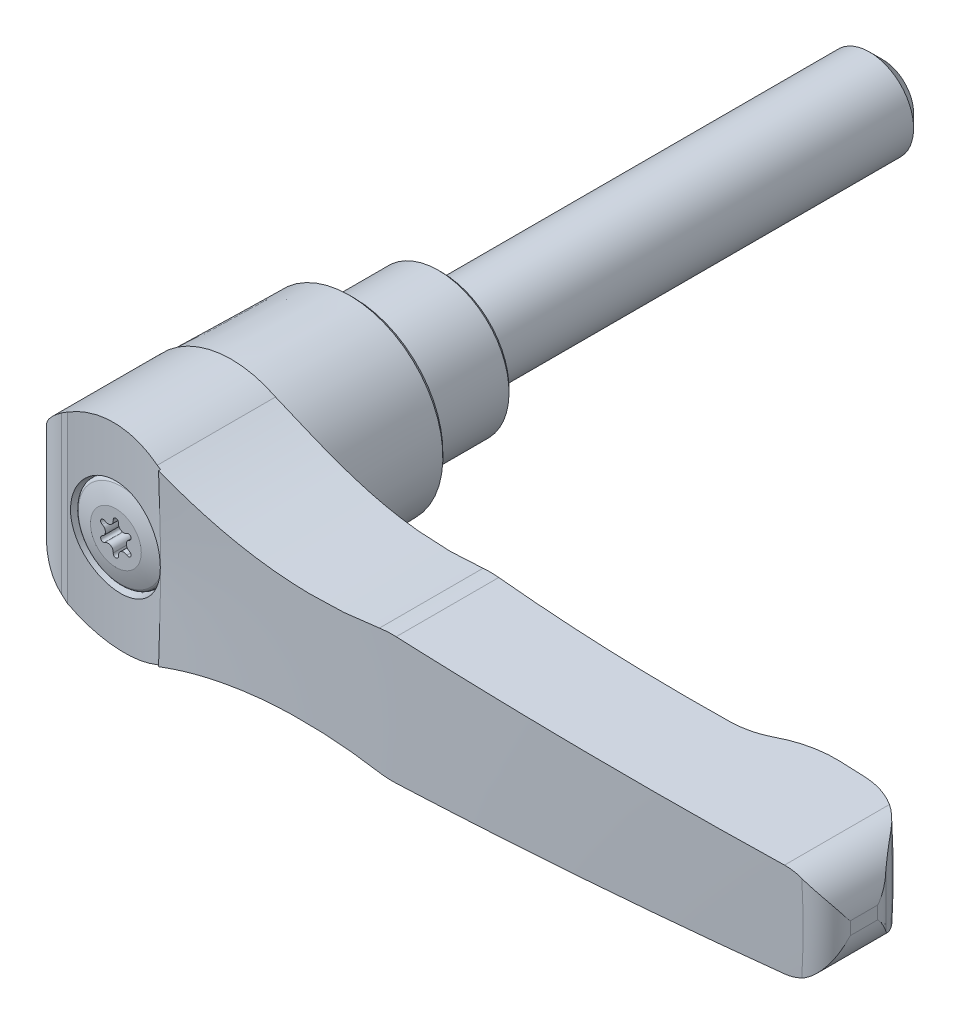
ISO-10303-21;
HEADER;
FILE_DESCRIPTION(('STEP AP214'),'2;1');
FILE_NAME('part.step','',(''),(''),'','','');
FILE_SCHEMA(('AUTOMOTIVE_DESIGN { 1 0 10303 214 1 1 1 1 }'));
ENDSEC;
DATA;
#1=APPLICATION_CONTEXT('core data for automotive mechanical design processes');
#2=APPLICATION_PROTOCOL_DEFINITION('international standard','automotive_design',2000,#1);
#3=PRODUCT_CONTEXT('',#1,'mechanical');
#4=PRODUCT('Part','Part','',(#3));
#5=PRODUCT_RELATED_PRODUCT_CATEGORY('part','',(#4));
#6=PRODUCT_DEFINITION_FORMATION('','',#4);
#7=PRODUCT_DEFINITION_CONTEXT('part definition',#1,'design');
#8=PRODUCT_DEFINITION('design','',#6,#7);
#9=PRODUCT_DEFINITION_SHAPE('','',#8);
#10=(LENGTH_UNIT() NAMED_UNIT(*) SI_UNIT(.MILLI.,.METRE.));
#11=(NAMED_UNIT(*) PLANE_ANGLE_UNIT() SI_UNIT($,.RADIAN.));
#12=(NAMED_UNIT(*) SI_UNIT($,.STERADIAN.) SOLID_ANGLE_UNIT());
#13=UNCERTAINTY_MEASURE_WITH_UNIT(LENGTH_MEASURE(1.E-05),#10,'distance_accuracy_value','');
#14=(GEOMETRIC_REPRESENTATION_CONTEXT(3) GLOBAL_UNCERTAINTY_ASSIGNED_CONTEXT((#13)) GLOBAL_UNIT_ASSIGNED_CONTEXT((#10,
#11,#12)) REPRESENTATION_CONTEXT('',''));
#15=CARTESIAN_POINT('',(0.,0.,0.));
#16=DIRECTION('',(0.,0.,1.));
#17=DIRECTION('',(1.,0.,0.));
#18=AXIS2_PLACEMENT_3D('',#15,#16,#17);
#19=CARTESIAN_POINT('',(0.,0.,27.75));
#20=DIRECTION('',(0.,0.,1.));
#21=DIRECTION('',(0.,-1.,0.));
#22=AXIS2_PLACEMENT_3D('',#19,#20,#21);
#23=CONICAL_SURFACE('',#22,5.15,0.0261799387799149);
#24=CARTESIAN_POINT('',(-3.82186723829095,3.79301788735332,36.7080789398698));
#25=CARTESIAN_POINT('',(-3.71534691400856,3.90028108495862,36.7062117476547));
#26=CARTESIAN_POINT('',(-3.60432455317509,4.00304517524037,36.704589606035));
#27=CARTESIAN_POINT('',(-3.37399930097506,4.19891926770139,36.7020096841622));
#28=CARTESIAN_POINT('',(-3.25469446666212,4.29202699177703,36.7010520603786));
#29=CARTESIAN_POINT('',(-3.0085890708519,4.4679591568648,36.6999680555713));
#30=CARTESIAN_POINT('',(-2.88178275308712,4.55077554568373,36.6998423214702));
#31=CARTESIAN_POINT('',(-2.62161264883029,4.7054859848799,36.7005758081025));
#32=CARTESIAN_POINT('',(-2.48824649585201,4.77737605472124,36.7014353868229));
#33=CARTESIAN_POINT('',(-2.21605276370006,4.90964048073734,36.7042708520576));
#34=CARTESIAN_POINT('',(-2.07722922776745,4.97002317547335,36.7062459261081));
#35=CARTESIAN_POINT('',(-1.79497035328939,5.07893378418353,36.7114191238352));
#36=CARTESIAN_POINT('',(-1.65153333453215,5.12745732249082,36.7146176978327));
#37=CARTESIAN_POINT('',(-1.36121177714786,5.21225729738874,36.7223126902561));
#38=CARTESIAN_POINT('',(-1.21432937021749,5.24854110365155,36.7268083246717));
#39=CARTESIAN_POINT('',(-0.918029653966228,5.30866584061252,36.7371445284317));
#40=CARTESIAN_POINT('',(-0.768611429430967,5.33250217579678,36.7429855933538));
#41=CARTESIAN_POINT('',(-0.468546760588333,5.36753437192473,36.7560131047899));
#42=CARTESIAN_POINT('',(-0.317902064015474,5.37874583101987,36.7631978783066));
#43=CARTESIAN_POINT('',(-0.0162164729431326,5.3885202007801,36.7788936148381));
#44=CARTESIAN_POINT('',(0.134824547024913,5.3870784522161,36.7874050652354));
#45=CARTESIAN_POINT('',(0.436130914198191,5.37156631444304,36.8056859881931));
#46=CARTESIAN_POINT('',(0.58639649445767,5.35749997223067,36.815455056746));
#47=CARTESIAN_POINT('',(0.885200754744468,5.31685490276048,36.8361582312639));
#48=CARTESIAN_POINT('',(1.03373877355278,5.29027153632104,36.8470927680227));
#49=CARTESIAN_POINT('',(1.32842726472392,5.22469830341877,36.8700247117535));
#50=CARTESIAN_POINT('',(1.47456945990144,5.18567228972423,36.882025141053));
#51=CARTESIAN_POINT('',(1.76304982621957,5.09551309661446,36.9068998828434));
#52=CARTESIAN_POINT('',(1.90538657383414,5.04437545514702,36.9197745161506));
#53=CARTESIAN_POINT('',(2.18517812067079,4.93037916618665,36.9461969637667));
#54=CARTESIAN_POINT('',(2.32263450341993,4.86752436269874,36.9597445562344));
#55=CARTESIAN_POINT('',(2.59177729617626,4.73053715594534,36.987298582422));
#56=CARTESIAN_POINT('',(2.72346154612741,4.65640057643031,37.0013051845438));
#57=CARTESIAN_POINT('',(3.11008075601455,4.41677811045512,37.0438406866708));
#58=CARTESIAN_POINT('',(3.35498940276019,4.23472918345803,37.0727317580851));
#59=CARTESIAN_POINT('',(3.81061841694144,3.83201391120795,37.1293132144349));
#60=CARTESIAN_POINT('',(4.02133817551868,3.61134687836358,37.1570035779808));
#61=CARTESIAN_POINT('',(4.40299814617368,3.13710131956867,37.2090851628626));
#62=CARTESIAN_POINT('',(4.57389146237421,2.88348453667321,37.2334724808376));
#63=CARTESIAN_POINT('',(4.8704857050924,2.35066468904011,37.2769076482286));
#64=CARTESIAN_POINT('',(4.99618921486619,2.07146308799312,37.2959558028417));
#65=CARTESIAN_POINT('',(5.19764854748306,1.49811632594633,37.3269450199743));
#66=CARTESIAN_POINT('',(5.27385550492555,1.20413322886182,37.3389501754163));
#67=CARTESIAN_POINT('',(5.37579370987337,0.607338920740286,37.3550873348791));
#68=CARTESIAN_POINT('',(5.40152887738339,0.304528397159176,37.3592199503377));
#69=CARTESIAN_POINT('',(5.40172286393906,-0.29769106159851,37.3592512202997));
#70=CARTESIAN_POINT('',(5.37675477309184,-0.597099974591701,37.35524190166));
#71=CARTESIAN_POINT('',(5.27746605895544,-1.18740212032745,37.3395194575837));
#72=CARTESIAN_POINT('',(5.20314585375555,-1.47829542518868,37.3278063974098));
#73=CARTESIAN_POINT('',(5.00745942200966,-2.04324075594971,37.2976749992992));
#74=CARTESIAN_POINT('',(4.88611822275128,-2.31730165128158,37.2792602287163));
#75=CARTESIAN_POINT('',(4.59994520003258,-2.84124816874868,37.2372335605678));
#76=CARTESIAN_POINT('',(4.43511078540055,-3.09113234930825,37.2136213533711));
#77=CARTESIAN_POINT('',(4.06463235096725,-3.56252869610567,37.1627855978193));
#78=CARTESIAN_POINT('',(3.85857005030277,-3.78370822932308,37.1355260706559));
#79=CARTESIAN_POINT('',(3.41254071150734,-4.18853503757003,37.0796758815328));
#80=CARTESIAN_POINT('',(3.17257159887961,-4.37218001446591,37.0510851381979));
#81=CARTESIAN_POINT('',(2.66278140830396,-4.69856745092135,36.994342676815));
#82=CARTESIAN_POINT('',(2.39268640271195,-4.84088357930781,36.9661981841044));
#83=CARTESIAN_POINT('',(1.83217160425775,-5.07809992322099,36.9125421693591));
#84=CARTESIAN_POINT('',(1.54175179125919,-5.17300009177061,36.8870306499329));
#85=CARTESIAN_POINT('',(0.948774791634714,-5.31257948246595,36.8401550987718));
#86=CARTESIAN_POINT('',(0.646218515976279,-5.35726246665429,36.8187907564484));
#87=CARTESIAN_POINT('',(0.0375867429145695,-5.39498080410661,36.7812079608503));
#88=CARTESIAN_POINT('',(-0.268488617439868,-5.38801816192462,36.7649893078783));
#89=CARTESIAN_POINT('',(-0.873320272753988,-5.32272310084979,36.7381921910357));
#90=CARTESIAN_POINT('',(-1.17211141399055,-5.26472804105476,36.7275774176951));
#91=CARTESIAN_POINT('',(-1.75586295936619,-5.09937269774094,36.7116339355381));
#92=CARTESIAN_POINT('',(-2.04082365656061,-4.99201346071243,36.7063051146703));
#93=CARTESIAN_POINT('',(-2.58762584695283,-4.73149608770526,36.7002185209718));
#94=CARTESIAN_POINT('',(-2.84955219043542,-4.57851601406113,36.6994432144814));
#95=CARTESIAN_POINT('',(-3.34420500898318,-4.23075694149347,36.7012936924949));
#96=CARTESIAN_POINT('',(-3.57693118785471,-4.03597751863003,36.7039195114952));
#97=CARTESIAN_POINT('',(-3.89903010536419,-3.71679841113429,36.709377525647));
#98=CARTESIAN_POINT('',(-4.00199323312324,-3.60577103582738,36.7114531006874));
#99=CARTESIAN_POINT('',(-4.19820603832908,-3.37546663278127,36.7159314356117));
#100=CARTESIAN_POINT('',(-4.29145927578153,-3.25619265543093,36.7183340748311));
#101=CARTESIAN_POINT('',(-4.46762204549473,-3.01018379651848,36.7232909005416));
#102=CARTESIAN_POINT('',(-4.55052767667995,-2.88344612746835,36.7258451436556));
#103=CARTESIAN_POINT('',(-4.70534739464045,-2.62348619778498,36.7309338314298));
#104=CARTESIAN_POINT('',(-4.77726552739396,-2.49026634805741,36.7334682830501));
#105=CARTESIAN_POINT('',(-4.90972659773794,-2.2180457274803,36.7383656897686));
#106=CARTESIAN_POINT('',(-4.97025295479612,-2.07903688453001,36.7407283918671));
#107=CARTESIAN_POINT('',(-5.07934789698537,-1.79645762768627,36.7451389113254));
#108=CARTESIAN_POINT('',(-5.12792090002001,-1.65288892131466,36.7471868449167));
#109=CARTESIAN_POINT('',(-5.21280239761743,-1.36211419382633,36.750853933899));
#110=CARTESIAN_POINT('',(-5.24910688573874,-1.21490700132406,36.7524729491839));
#111=CARTESIAN_POINT('',(-5.30915612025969,-0.918004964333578,36.7551917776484));
#112=CARTESIAN_POINT('',(-5.33290553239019,-0.768311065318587,36.7562917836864));
#113=CARTESIAN_POINT('',(-5.36767150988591,-0.467638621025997,36.7579130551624));
#114=CARTESIAN_POINT('',(-5.37870396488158,-0.316661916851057,36.7584350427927));
#115=CARTESIAN_POINT('',(-5.38800813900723,-0.0143709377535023,36.7588747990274));
#116=CARTESIAN_POINT('',(-5.38628458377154,0.136943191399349,36.7587927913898));
#117=CARTESIAN_POINT('',(-5.37009558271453,0.438975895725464,36.758029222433));
#118=CARTESIAN_POINT('',(-5.35562265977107,0.589694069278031,36.7573473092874));
#119=CARTESIAN_POINT('',(-5.31403708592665,0.889315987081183,36.7554202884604));
#120=CARTESIAN_POINT('',(-5.28692909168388,1.03822037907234,36.7541753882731));
#121=CARTESIAN_POINT('',(-5.22027737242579,1.33318140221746,36.7511900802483));
#122=CARTESIAN_POINT('',(-5.18073627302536,1.47923862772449,36.749449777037));
#123=CARTESIAN_POINT('',(-5.08951807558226,1.7674479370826,36.7455701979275));
#124=CARTESIAN_POINT('',(-5.03784539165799,1.90960142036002,36.7434310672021));
#125=CARTESIAN_POINT('',(-4.92276837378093,2.18894714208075,36.738876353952));
#126=CARTESIAN_POINT('',(-4.85937318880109,2.32614315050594,36.7364609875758));
#127=CARTESIAN_POINT('',(-4.72130226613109,2.59467891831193,36.7314958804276));
#128=CARTESIAN_POINT('',(-4.64662917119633,2.72602004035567,36.728946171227));
#129=CARTESIAN_POINT('',(-4.46041720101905,3.02367013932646,36.7230432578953));
#130=CARTESIAN_POINT('',(-4.34479079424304,3.18744274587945,36.7196987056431));
#131=CARTESIAN_POINT('',(-4.0960291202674,3.50111159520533,36.7134525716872));
#132=CARTESIAN_POINT('',(-3.96289380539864,3.65100780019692,36.7105509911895));
#133=CARTESIAN_POINT('',(-3.82186723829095,3.79301788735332,36.7080789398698));
#134=B_SPLINE_CURVE_WITH_KNOTS('',3,(#24,#25,#26,#27,#28,#29,#30,#31,#32,#33,#34,#35,#36,#37,
#38,#39,#40,#41,#42,#43,#44,#45,#46,#47,#48,#49,#50,#51,#52,#53,#54,#55,#56,#57,#58,#59,#60,#61,
#62,#63,#64,#65,#66,#67,#68,#69,#70,#71,#72,#73,#74,#75,#76,#77,#78,#79,#80,#81,#82,#83,#84,#85,
#86,#87,#88,#89,#90,#91,#92,#93,#94,#95,#96,#97,#98,#99,#100,#101,#102,#103,#104,#105,#106,#107,
#108,#109,#110,#111,#112,#113,#114,#115,#116,#117,#118,#119,#120,#121,#122,#123,#124,#125,#126,
#127,#128,#129,#130,#131,#132,#133),.UNSPECIFIED.,.T.,.F.,(4,2,2,2,2,2,2,2,2,2,2,2,2,2,2,2,2,2,
2,2,2,2,2,2,2,2,2,2,2,2,2,2,2,2,2,2,2,2,2,2,2,2,2,2,2,2,2,2,2,2,2,2,2,2,4),(0.,
0.453366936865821,0.906840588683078,1.36066684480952,1.81465803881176,2.26831899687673,
2.72214709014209,3.17570143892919,3.62942311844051,4.0825836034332,4.53591096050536,
4.98909304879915,5.44244323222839,5.89712263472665,6.35196980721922,6.8066680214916,
7.26153496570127,8.17638541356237,9.09125215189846,10.007190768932,10.9230770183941,
11.8304937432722,12.7378399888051,13.634987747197,14.5321279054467,15.4287912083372,
16.3255079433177,17.2318313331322,18.1382101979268,19.0536313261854,19.9690533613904,
20.8844068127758,21.7997247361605,22.7090368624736,23.6183297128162,24.5241189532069,
25.4299173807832,25.8837842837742,26.3374841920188,26.7913546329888,27.2450575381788,
27.6994157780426,28.1536058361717,28.6079440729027,29.0621133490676,29.5157145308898,
29.969147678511,30.4228469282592,30.8763790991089,31.3298155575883,31.7830872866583,
32.2360067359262,32.6888202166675,33.2890494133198,33.8892802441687),.UNSPECIFIED.);
#135=CARTESIAN_POINT('',(-3.82186723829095,3.79301788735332,36.7080789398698));
#136=VERTEX_POINT('',#135);
#137=EDGE_CURVE('E521',#136,#136,#134,.T.);
#138=ORIENTED_EDGE('',*,*,#137,.F.);
#139=EDGE_LOOP('',(#138));
#140=FACE_BOUND('',#139,.T.);
#141=CARTESIAN_POINT('',(0.,0.,33.));
#142=DIRECTION('',(0.,0.,-1.));
#143=DIRECTION('',(-1.,0.,0.));
#144=AXIS2_PLACEMENT_3D('',#141,#142,#143);
#145=CIRCLE('',#144,5.28747608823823);
#146=CARTESIAN_POINT('',(-5.28747608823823,0.,33.));
#147=VERTEX_POINT('',#146);
#148=EDGE_CURVE('E299',#147,#147,#145,.T.);
#149=ORIENTED_EDGE('',*,*,#148,.T.);
#150=EDGE_LOOP('',(#149));
#151=FACE_BOUND('',#150,.T.);
#152=ADVANCED_FACE('F14',(#140,#151),#23,.F.);
#153=CARTESIAN_POINT('',(0.,0.,-20.));
#154=DIRECTION('',(0.,0.,-1.));
#155=DIRECTION('',(0.,1.,0.));
#156=AXIS2_PLACEMENT_3D('',#153,#154,#155);
#157=CYLINDRICAL_SURFACE('',#156,5.);
#158=CARTESIAN_POINT('',(0.,0.,-48.5));
#159=DIRECTION('',(0.,0.,-1.));
#160=DIRECTION('',(0.,1.,0.));
#161=AXIS2_PLACEMENT_3D('',#158,#159,#160);
#162=CIRCLE('',#161,5.);
#163=CARTESIAN_POINT('',(0.,5.,-48.5));
#164=VERTEX_POINT('',#163);
#165=EDGE_CURVE('E9',#164,#164,#162,.F.);
#166=ORIENTED_EDGE('',*,*,#165,.T.);
#167=EDGE_LOOP('',(#166));
#168=FACE_BOUND('',#167,.T.);
#169=CARTESIAN_POINT('',(0.,0.,0.));
#170=DIRECTION('',(0.,0.,-1.));
#171=DIRECTION('',(0.,1.,0.));
#172=AXIS2_PLACEMENT_3D('',#169,#170,#171);
#173=CIRCLE('',#172,5.);
#174=CARTESIAN_POINT('',(0.,5.,0.));
#175=VERTEX_POINT('',#174);
#176=EDGE_CURVE('E362',#175,#175,#173,.T.);
#177=ORIENTED_EDGE('',*,*,#176,.T.);
#178=EDGE_LOOP('',(#177));
#179=FACE_BOUND('',#178,.T.);
#180=ADVANCED_FACE('F512',(#168,#179),#157,.T.);
#181=CARTESIAN_POINT('',(7.6,0.,0.));
#182=DIRECTION('',(0.,0.,1.));
#183=DIRECTION('',(0.,-1.,0.));
#184=AXIS2_PLACEMENT_3D('',#181,#182,#183);
#185=PLANE('',#184);
#186=ORIENTED_EDGE('',*,*,#176,.F.);
#187=EDGE_LOOP('',(#186));
#188=FACE_BOUND('',#187,.T.);
#189=CARTESIAN_POINT('',(0.,0.,0.));
#190=DIRECTION('',(0.,0.,-1.));
#191=DIRECTION('',(0.,1.,0.));
#192=AXIS2_PLACEMENT_3D('',#189,#190,#191);
#193=CIRCLE('',#192,7.6);
#194=CARTESIAN_POINT('',(0.,7.6,0.));
#195=VERTEX_POINT('',#194);
#196=EDGE_CURVE('E985',#195,#195,#193,.T.);
#197=ORIENTED_EDGE('',*,*,#196,.T.);
#198=EDGE_LOOP('',(#197));
#199=FACE_BOUND('',#198,.T.);
#200=ADVANCED_FACE('F403',(#188,#199),#185,.F.);
#201=CARTESIAN_POINT('',(-2.9000000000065,-22.,89.3000000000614));
#202=DIRECTION('',(0.,1.,0.));
#203=DIRECTION('',(-1.,0.,0.));
#204=AXIS2_PLACEMENT_3D('',#201,#202,#203);
#205=CYLINDRICAL_SURFACE('',#204,52.6000000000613);
#206=CARTESIAN_POINT('',(4.99999999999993,9.79795897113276,37.29663472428));
#207=CARTESIAN_POINT('',(4.72836499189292,9.9366097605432,37.2553500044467));
#208=CARTESIAN_POINT('',(4.45077156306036,10.0639978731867,37.2153761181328));
#209=CARTESIAN_POINT('',(3.88554818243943,10.2954169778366,37.1387392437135));
#210=CARTESIAN_POINT('',(3.59791744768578,10.3994461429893,37.1020765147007));
#211=CARTESIAN_POINT('',(3.01491777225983,10.5831754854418,37.0328024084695));
#212=CARTESIAN_POINT('',(2.71955925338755,10.6629067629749,37.0001858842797));
#213=CARTESIAN_POINT('',(2.12279313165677,10.79755975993,36.9395048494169));
#214=CARTESIAN_POINT('',(1.82138582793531,10.8524827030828,36.9114401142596));
#215=CARTESIAN_POINT('',(1.21421772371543,10.9370815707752,36.8602616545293));
#216=CARTESIAN_POINT('',(0.90845167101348,10.966723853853,36.8371545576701));
#217=CARTESIAN_POINT('',(0.295018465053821,11.0003346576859,36.7962250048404));
#218=CARTESIAN_POINT('',(-0.0126494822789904,11.0042916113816,36.7784049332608));
#219=CARTESIAN_POINT('',(-0.627464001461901,10.9863940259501,36.7482132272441));
#220=CARTESIAN_POINT('',(-0.934610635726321,10.9645428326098,36.7358408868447));
#221=CARTESIAN_POINT('',(-1.54601934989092,10.8951569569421,36.7165401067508));
#222=CARTESIAN_POINT('',(-1.85028266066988,10.8476337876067,36.709609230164));
#223=CARTESIAN_POINT('',(-2.46439079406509,10.7251200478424,36.7008764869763));
#224=CARTESIAN_POINT('',(-2.77405858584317,10.64922685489,36.6992625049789));
#225=CARTESIAN_POINT('',(-3.38564496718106,10.4708596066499,36.7013524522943));
#226=CARTESIAN_POINT('',(-3.68756293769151,10.3683834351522,36.705056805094));
#227=CARTESIAN_POINT('',(-4.28200890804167,10.1373700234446,36.7173174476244));
#228=CARTESIAN_POINT('',(-4.5745119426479,10.0087692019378,36.7258856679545));
#229=CARTESIAN_POINT('',(-5.14711147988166,9.72673276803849,36.7472344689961));
#230=CARTESIAN_POINT('',(-5.42720860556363,9.57329840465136,36.7600148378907));
#231=CARTESIAN_POINT('',(-5.70000000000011,9.40797534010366,36.774577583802));
#232=B_SPLINE_CURVE_WITH_KNOTS('',3,(#206,#207,#208,#209,#210,#211,#212,#213,#214,#215,#216,
#217,#218,#219,#220,#221,#222,#223,#224,#225,#226,#227,#228,#229,#230,#231),.UNSPECIFIED.,.F.,
.F.,(4,2,2,2,2,2,2,2,2,2,2,2,4),(0.,0.923020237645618,1.84611263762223,2.76801850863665,
3.68987889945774,4.61296412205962,5.53646501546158,6.4598461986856,7.38281362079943,
8.33806499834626,9.29339244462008,10.2510734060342,11.2087062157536),.UNSPECIFIED.);
#233=CARTESIAN_POINT('',(4.99999999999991,9.7979589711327,37.29663472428));
#234=VERTEX_POINT('',#233);
#235=CARTESIAN_POINT('',(-5.7000000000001,9.40797534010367,36.774577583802));
#236=VERTEX_POINT('',#235);
#237=EDGE_CURVE('E435',#234,#236,#232,.T.);
#238=ORIENTED_EDGE('',*,*,#237,.T.);
#239=DIRECTION('',(0.,1.,0.));
#240=VECTOR('',#239,1.);
#241=CARTESIAN_POINT('',(-5.7000000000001,-22.,36.774577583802));
#242=LINE('',#241,#240);
#243=CARTESIAN_POINT('',(-5.7000000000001,-9.4079753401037,36.774577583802));
#244=VERTEX_POINT('',#243);
#245=EDGE_CURVE('E368',#244,#236,#242,.T.);
#246=ORIENTED_EDGE('',*,*,#245,.F.);
#247=CARTESIAN_POINT('',(-5.70000000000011,-9.40797534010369,36.774577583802));
#248=CARTESIAN_POINT('',(-5.43970332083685,-9.56571993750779,36.7606846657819));
#249=CARTESIAN_POINT('',(-5.17275915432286,-9.71264560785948,36.7484111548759));
#250=CARTESIAN_POINT('',(-4.62749279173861,-9.9839292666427,36.727671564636));
#251=CARTESIAN_POINT('',(-4.34917039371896,-10.1082868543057,36.7192055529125));
#252=CARTESIAN_POINT('',(-3.7836735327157,-10.3332602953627,36.706663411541));
#253=CARTESIAN_POINT('',(-3.49651907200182,-10.4339258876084,36.7025780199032));
#254=CARTESIAN_POINT('',(-2.91484226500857,-10.6111316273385,36.699198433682));
#255=CARTESIAN_POINT('',(-2.62032018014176,-10.6876726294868,36.6999040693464));
#256=CARTESIAN_POINT('',(-2.02570589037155,-10.8161512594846,36.7064252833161));
#257=CARTESIAN_POINT('',(-1.7256084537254,-10.8680644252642,36.7122459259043));
#258=CARTESIAN_POINT('',(-1.12215614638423,-10.9468441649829,36.7291866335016));
#259=CARTESIAN_POINT('',(-0.818799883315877,-10.9736995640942,36.7403090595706));
#260=CARTESIAN_POINT('',(-0.211043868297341,-11.0021831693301,36.7678948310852));
#261=CARTESIAN_POINT('',(0.0933562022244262,-11.0038028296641,36.7843599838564));
#262=CARTESIAN_POINT('',(0.700782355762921,-10.981859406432,36.8225100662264));
#263=CARTESIAN_POINT('',(1.00380896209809,-10.9583068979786,36.844192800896));
#264=CARTESIAN_POINT('',(1.62703646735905,-10.883833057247,36.8941780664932));
#265=CARTESIAN_POINT('',(1.94700070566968,-10.8311562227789,36.9228309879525));
#266=CARTESIAN_POINT('',(2.58058446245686,-10.6979165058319,36.9853308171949));
#267=CARTESIAN_POINT('',(2.89420315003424,-10.6173499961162,37.0191784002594));
#268=CARTESIAN_POINT('',(3.51321915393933,-10.4289071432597,37.0914975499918));
#269=CARTESIAN_POINT('',(3.81860000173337,-10.3209800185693,37.1299776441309));
#270=CARTESIAN_POINT('',(4.41821395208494,-10.078894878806,37.2106925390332));
#271=CARTESIAN_POINT('',(4.71244874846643,-9.94474086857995,37.2529267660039));
#272=CARTESIAN_POINT('',(5.0000000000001,-9.7979589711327,37.29663472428));
#273=B_SPLINE_CURVE_WITH_KNOTS('',3,(#247,#248,#249,#250,#251,#252,#253,#254,#255,#256,#257,
#258,#259,#260,#261,#262,#263,#264,#265,#266,#267,#268,#269,#270,#271,#272),.UNSPECIFIED.,.F.,
.F.,(4,2,2,2,2,2,2,2,2,2,2,2,4),(0.,0.913785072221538,1.82758637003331,2.73945177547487,
3.65128487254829,4.56402177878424,5.47716553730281,6.39061851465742,7.30368789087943,
8.27897178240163,9.25438256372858,10.2316171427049,11.2087026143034),.UNSPECIFIED.);
#274=CARTESIAN_POINT('',(5.00000000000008,-9.79795897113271,37.29663472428));
#275=VERTEX_POINT('',#274);
#276=EDGE_CURVE('E421',#244,#275,#273,.T.);
#277=ORIENTED_EDGE('',*,*,#276,.T.);
#278=CARTESIAN_POINT('',(5.43597073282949,-9.62987816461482,37.36473652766));
#279=CARTESIAN_POINT('',(5.36321973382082,-9.65752809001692,37.3530600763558));
#280=CARTESIAN_POINT('',(5.29051333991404,-9.68535978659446,37.341546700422));
#281=CARTESIAN_POINT('',(5.14518976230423,-9.74138672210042,37.3188460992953));
#282=CARTESIAN_POINT('',(5.07257257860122,-9.76958196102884,37.3076588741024));
#283=CARTESIAN_POINT('',(5.00000000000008,-9.79795897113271,37.29663472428));
#284=B_SPLINE_CURVE_WITH_KNOTS('',3,(#278,#279,#280,#281,#282,#283),.UNSPECIFIED.,.F.,.F.,(4,2,
4),(0.,0.236094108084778,0.472188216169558),.UNSPECIFIED.);
#285=CARTESIAN_POINT('',(5.4359707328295,-9.62987816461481,37.36473652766));
#286=VERTEX_POINT('',#285);
#287=EDGE_CURVE('E410',#286,#275,#284,.T.);
#288=ORIENTED_EDGE('',*,*,#287,.F.);
#289=DIRECTION('',(0.,1.,0.));
#290=VECTOR('',#289,1.);
#291=CARTESIAN_POINT('',(5.43597073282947,-22.,37.36473652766));
#292=LINE('',#291,#290);
#293=CARTESIAN_POINT('',(5.43597073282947,0.,37.36473652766));
#294=VERTEX_POINT('',#293);
#295=EDGE_CURVE('E37',#286,#294,#292,.T.);
#296=ORIENTED_EDGE('',*,*,#295,.T.);
#297=CARTESIAN_POINT('',(5.43597073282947,9.62987816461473,37.36473652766));
#298=VERTEX_POINT('',#297);
#299=EDGE_CURVE('E365',#294,#298,#292,.T.);
#300=ORIENTED_EDGE('',*,*,#299,.T.);
#301=CARTESIAN_POINT('',(4.99999999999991,9.7979589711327,37.29663472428));
#302=CARTESIAN_POINT('',(5.07257257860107,9.76958196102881,37.3076588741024));
#303=CARTESIAN_POINT('',(5.14518976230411,9.74138672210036,37.3188460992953));
#304=CARTESIAN_POINT('',(5.29051333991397,9.68535978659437,37.341546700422));
#305=CARTESIAN_POINT('',(5.36321973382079,9.65752809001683,37.3530600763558));
#306=CARTESIAN_POINT('',(5.43597073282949,9.62987816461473,37.36473652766));
#307=B_SPLINE_CURVE_WITH_KNOTS('',3,(#301,#302,#303,#304,#305,#306),.UNSPECIFIED.,.F.,.F.,(4,2,
4),(0.,0.236094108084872,0.472188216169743),.UNSPECIFIED.);
#308=EDGE_CURVE('E428',#234,#298,#307,.T.);
#309=ORIENTED_EDGE('',*,*,#308,.F.);
#310=EDGE_LOOP('',(#238,#246,#277,#288,#296,#300,#309));
#311=FACE_BOUND('',#310,.T.);
#312=ORIENTED_EDGE('',*,*,#137,.T.);
#313=EDGE_LOOP('',(#312));
#314=FACE_BOUND('',#313,.T.);
#315=ADVANCED_FACE('F399',(#311,#314),#205,.F.);
#316=CARTESIAN_POINT('',(0.,0.,-577.800000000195));
#317=DIRECTION('',(0.,0.,-1.));
#318=DIRECTION('',(0.,1.,0.));
#319=AXIS2_PLACEMENT_3D('',#316,#317,#318);
#320=DEGENERATE_TOROIDAL_SURFACE('',#319,33.3999999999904,615.800000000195,.T.);
#321=CARTESIAN_POINT('',(30.9002,7.10003333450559,37.9976683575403));
#322=CARTESIAN_POINT('',(30.2294569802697,6.98822969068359,37.9958049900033));
#323=CARTESIAN_POINT('',(29.5563953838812,6.8904055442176,37.9928133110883));
#324=CARTESIAN_POINT('',(28.2067936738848,6.7228472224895,37.9846275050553));
#325=CARTESIAN_POINT('',(27.5302535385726,6.6531132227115,37.9794333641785));
#326=CARTESIAN_POINT('',(26.1747400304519,6.54185757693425,37.9668957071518));
#327=CARTESIAN_POINT('',(25.4957662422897,6.5003410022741,37.9595518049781));
#328=CARTESIAN_POINT('',(24.1367720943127,6.44559969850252,37.9428222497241));
#329=CARTESIAN_POINT('',(23.4567517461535,6.43237465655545,37.9334366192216));
#330=CARTESIAN_POINT('',(21.4461065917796,6.43516844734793,37.9028483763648));
#331=CARTESIAN_POINT('',(20.1152587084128,6.49125306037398,37.878929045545));
#332=CARTESIAN_POINT('',(18.1264981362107,6.65637631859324,37.8390449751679));
#333=CARTESIAN_POINT('',(17.464852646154,6.72491301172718,37.8250833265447));
#334=CARTESIAN_POINT('',(16.1449136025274,6.88885393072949,37.7962639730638));
#335=CARTESIAN_POINT('',(15.4866198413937,6.98425647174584,37.7814063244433));
#336=CARTESIAN_POINT('',(13.9966493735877,7.23126043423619,37.7473031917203));
#337=CARTESIAN_POINT('',(13.1663283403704,7.39108521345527,37.727959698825));
#338=CARTESIAN_POINT('',(11.5152169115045,7.75343699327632,37.690522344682));
#339=CARTESIAN_POINT('',(10.694424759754,7.9559559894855,37.6724282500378));
#340=CARTESIAN_POINT('',(9.05285416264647,8.40635359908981,37.6397736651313));
#341=CARTESIAN_POINT('',(8.23223752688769,8.6548288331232,37.6252663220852));
#342=CARTESIAN_POINT('',(7.01185980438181,9.05958984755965,37.608666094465));
#343=CARTESIAN_POINT('',(6.60676296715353,9.19987583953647,37.603992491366));
#344=CARTESIAN_POINT('',(5.80036915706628,9.49103692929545,37.5966508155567));
#345=CARTESIAN_POINT('',(5.39907222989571,9.64191215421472,37.5939827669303));
#346=CARTESIAN_POINT('',(4.9997999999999,9.79803717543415,37.5924593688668));
#347=B_SPLINE_CURVE_WITH_KNOTS('',3,(#321,#322,#323,#324,#325,#326,#327,#328,#329,#330,#331,
#332,#333,#334,#335,#336,#337,#338,#339,#340,#341,#342,#343,#344,#345,#346),.UNSPECIFIED.,.F.,
.F.,(4,2,2,2,2,2,2,2,2,2,2,2,4),(0.,2.03983506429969,4.07968287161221,6.11989719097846,
8.16008895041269,12.1515193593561,14.1470960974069,16.1425477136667,18.6787308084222,
21.2144388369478,23.7857285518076,25.0717731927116,26.3578332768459),.UNSPECIFIED.);
#348=CARTESIAN_POINT('',(30.9,7.1,37.997667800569));
#349=VERTEX_POINT('',#348);
#350=CARTESIAN_POINT('',(5.4359707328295,9.62987816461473,37.5945767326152));
#351=VERTEX_POINT('',#350);
#352=EDGE_CURVE('E1012',#349,#351,#347,.T.);
#353=ORIENTED_EDGE('',*,*,#352,.T.);
#354=CARTESIAN_POINT('',(5.4359707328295,0.139704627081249,37.364818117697));
#355=CARTESIAN_POINT('',(5.4359707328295,0.0263223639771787,37.3646847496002));
#356=CARTESIAN_POINT('',(5.4359707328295,-0.087059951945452,37.3647143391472));
#357=CARTESIAN_POINT('',(5.4359707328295,-0.31382488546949,37.3650945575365));
#358=CARTESIAN_POINT('',(5.4359707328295,-0.427207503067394,37.3654451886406));
#359=CARTESIAN_POINT('',(5.4359707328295,-0.767350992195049,37.3669741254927));
#360=CARTESIAN_POINT('',(5.4359707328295,-0.994109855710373,37.3686294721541));
#361=CARTESIAN_POINT('',(5.4359707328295,-1.44760096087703,37.3731244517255));
#362=CARTESIAN_POINT('',(5.4359707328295,-1.67433320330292,37.3759640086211));
#363=CARTESIAN_POINT('',(5.4359707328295,-2.12778335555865,37.3826896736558));
#364=CARTESIAN_POINT('',(5.4359707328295,-2.35450126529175,37.3865757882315));
#365=CARTESIAN_POINT('',(5.4359707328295,-2.80788425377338,37.3952314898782));
#366=CARTESIAN_POINT('',(5.4359707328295,-3.03454933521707,37.4000009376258));
#367=CARTESIAN_POINT('',(5.4359707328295,-3.48786247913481,37.4102594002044));
#368=CARTESIAN_POINT('',(5.4359707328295,-3.71451054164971,37.4157484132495));
#369=CARTESIAN_POINT('',(5.4359707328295,-4.3944531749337,37.4330569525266));
#370=CARTESIAN_POINT('',(5.4359707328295,-4.84772616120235,37.445717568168));
#371=CARTESIAN_POINT('',(5.4359707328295,-5.75417804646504,37.4722642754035));
#372=CARTESIAN_POINT('',(5.4359707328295,-6.20735695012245,37.4861502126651));
#373=CARTESIAN_POINT('',(5.4359707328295,-7.11369823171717,37.5144555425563));
#374=CARTESIAN_POINT('',(5.4359707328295,-7.56686060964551,37.528874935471));
#375=CARTESIAN_POINT('',(5.4359707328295,-8.47318366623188,37.5577843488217));
#376=CARTESIAN_POINT('',(5.4359707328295,-8.92634434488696,37.5722743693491));
#377=CARTESIAN_POINT('',(5.4359707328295,-9.83267306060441,37.6010218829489));
#378=CARTESIAN_POINT('',(5.4359707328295,-10.2858410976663,37.615279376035));
#379=CARTESIAN_POINT('',(5.4359707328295,-11.6453393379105,37.657378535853));
#380=CARTESIAN_POINT('',(5.4359707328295,-12.5516906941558,37.6845477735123));
#381=CARTESIAN_POINT('',(5.4359707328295,-14.3644725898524,37.7361289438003));
#382=CARTESIAN_POINT('',(5.4359707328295,-15.2709031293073,37.7605408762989));
#383=CARTESIAN_POINT('',(5.4359707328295,-17.0838968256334,37.8061411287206));
#384=CARTESIAN_POINT('',(5.4359707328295,-17.9904599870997,37.8273292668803));
#385=CARTESIAN_POINT('',(5.4359707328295,-19.8036600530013,37.8662106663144));
#386=CARTESIAN_POINT('',(5.4359707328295,-20.7102969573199,37.8839039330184));
#387=CARTESIAN_POINT('',(5.4359707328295,-22.5236728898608,37.9156376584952));
#388=CARTESIAN_POINT('',(5.4359707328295,-23.4304119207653,37.929677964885));
#389=CARTESIAN_POINT('',(5.4359707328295,-25.2439454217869,37.9540054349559));
#390=CARTESIAN_POINT('',(5.4359707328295,-26.1507398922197,37.9642925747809));
#391=CARTESIAN_POINT('',(5.4359707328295,-28.8758498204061,37.9894632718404));
#392=CARTESIAN_POINT('',(5.4359707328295,-30.6942231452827,37.9985735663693));
#393=CARTESIAN_POINT('',(5.4359707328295,-34.3309833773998,38.001117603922));
#394=CARTESIAN_POINT('',(5.4359707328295,-36.1493702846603,37.9945512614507));
#395=CARTESIAN_POINT('',(5.4359707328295,-41.6044064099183,37.9510940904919));
#396=CARTESIAN_POINT('',(5.4359707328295,-45.2408980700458,37.8904448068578));
#397=CARTESIAN_POINT('',(5.4359707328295,-52.5123746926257,37.7052257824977));
#398=CARTESIAN_POINT('',(5.4359707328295,-56.147359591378,37.5806535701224));
#399=CARTESIAN_POINT('',(5.4359707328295,-63.4145638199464,37.2674123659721));
#400=CARTESIAN_POINT('',(5.4359707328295,-67.046783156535,37.0787435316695));
#401=CARTESIAN_POINT('',(5.4359707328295,-74.3112406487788,36.6370156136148));
#402=CARTESIAN_POINT('',(5.4359707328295,-77.943474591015,36.3838872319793));
#403=CARTESIAN_POINT('',(5.4359707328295,-85.2028595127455,35.813362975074));
#404=CARTESIAN_POINT('',(5.4359707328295,-88.8300105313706,35.4959675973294));
#405=CARTESIAN_POINT('',(5.4359707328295,-96.0785329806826,34.7969300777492));
#406=CARTESIAN_POINT('',(5.4359707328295,-99.6999037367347,34.4152809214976));
#407=CARTESIAN_POINT('',(5.4359707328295,-106.935372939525,33.5878576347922));
#408=CARTESIAN_POINT('',(5.4359707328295,-110.54947113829,33.1420813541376));
#409=CARTESIAN_POINT('',(5.4359707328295,-121.445659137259,31.6999206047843));
#410=CARTESIAN_POINT('',(5.4359707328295,-128.715080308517,30.6051121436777));
#411=CARTESIAN_POINT('',(5.4359707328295,-139.58597763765,28.768381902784));
#412=CARTESIAN_POINT('',(5.4359707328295,-143.204228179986,28.1236865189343));
#413=CARTESIAN_POINT('',(5.4359707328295,-150.428776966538,26.7696133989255));
#414=CARTESIAN_POINT('',(5.4359707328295,-154.035074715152,26.0602330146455));
#415=CARTESIAN_POINT('',(5.4359707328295,-164.835392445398,23.8351440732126));
#416=CARTESIAN_POINT('',(5.4359707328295,-172.00972097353,22.2226762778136));
#417=CARTESIAN_POINT('',(5.4359707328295,-186.295919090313,18.7419286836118));
#418=CARTESIAN_POINT('',(5.4359707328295,-193.407788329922,16.8736474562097));
#419=CARTESIAN_POINT('',(5.4359707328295,-207.565393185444,12.8821360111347));
#420=CARTESIAN_POINT('',(5.4359707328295,-214.611075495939,10.7587166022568));
#421=CARTESIAN_POINT('',(5.4359707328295,-228.621811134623,6.26076727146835));
#422=CARTESIAN_POINT('',(5.4359707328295,-235.586864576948,3.88623770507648));
#423=CARTESIAN_POINT('',(5.4359707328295,-249.427511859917,-1.11092136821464));
#424=CARTESIAN_POINT('',(5.4359707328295,-256.303103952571,-3.73355571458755));
#425=CARTESIAN_POINT('',(5.4359707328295,-269.956066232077,-9.2236157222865));
#426=CARTESIAN_POINT('',(5.4359707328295,-276.733435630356,-12.0910433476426));
#427=CARTESIAN_POINT('',(5.4359707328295,-287.411895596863,-16.8363541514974));
#428=CARTESIAN_POINT('',(5.4359707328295,-291.348165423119,-18.6354901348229));
#429=CARTESIAN_POINT('',(5.4359707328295,-299.181702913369,-22.3162445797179));
#430=CARTESIAN_POINT('',(5.4359707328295,-303.078972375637,-24.1978592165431));
#431=CARTESIAN_POINT('',(5.4359707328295,-314.710300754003,-29.9654969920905));
#432=CARTESIAN_POINT('',(5.4359707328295,-322.383911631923,-33.9743282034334));
#433=CARTESIAN_POINT('',(5.4359707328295,-337.555961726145,-42.3122719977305));
#434=CARTESIAN_POINT('',(5.4359707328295,-345.054380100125,-46.6414224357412));
#435=CARTESIAN_POINT('',(5.4359707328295,-359.862045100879,-55.6120111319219));
#436=CARTESIAN_POINT('',(5.4359707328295,-367.171293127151,-60.2534470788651));
#437=CARTESIAN_POINT('',(5.4359707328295,-381.590156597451,-69.8420495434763));
#438=CARTESIAN_POINT('',(5.4359707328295,-388.699700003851,-74.7893243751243));
#439=CARTESIAN_POINT('',(5.4359707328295,-402.703827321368,-84.9793317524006));
#440=CARTESIAN_POINT('',(5.4359707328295,-409.598410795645,-90.2220648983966));
#441=CARTESIAN_POINT('',(5.4359707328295,-423.160104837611,-100.99347121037));
#442=CARTESIAN_POINT('',(5.4359707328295,-429.827222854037,-106.522134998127));
#443=CARTESIAN_POINT('',(5.4359707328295,-442.922356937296,-117.855720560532));
#444=CARTESIAN_POINT('',(5.4359707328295,-449.350373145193,-123.660642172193));
#445=CARTESIAN_POINT('',(5.4359707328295,-461.953986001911,-135.534643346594));
#446=CARTESIAN_POINT('',(5.4359707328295,-468.129657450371,-141.603643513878));
#447=CARTESIAN_POINT('',(5.4359707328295,-480.219630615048,-153.996624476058));
#448=CARTESIAN_POINT('',(5.4359707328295,-486.133932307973,-160.320605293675));
#449=CARTESIAN_POINT('',(5.4359707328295,-497.690689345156,-173.212347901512));
#450=CARTESIAN_POINT('',(5.4359707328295,-503.333142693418,-179.780111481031));
#451=CARTESIAN_POINT('',(5.4359707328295,-514.336121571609,-193.147695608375));
#452=CARTESIAN_POINT('',(5.4359707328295,-519.696647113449,-199.947516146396));
#453=CARTESIAN_POINT('',(5.4359707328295,-530.125574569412,-213.766243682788));
#454=CARTESIAN_POINT('',(5.4359707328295,-535.19401350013,-220.785122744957));
#455=CARTESIAN_POINT('',(5.4359707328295,-545.030492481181,-235.030309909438));
#456=CARTESIAN_POINT('',(5.4359707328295,-549.798532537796,-242.256618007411));
#457=CARTESIAN_POINT('',(5.4359707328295,-559.025727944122,-256.903802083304));
#458=CARTESIAN_POINT('',(5.4359707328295,-563.484883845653,-264.324677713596));
#459=CARTESIAN_POINT('',(5.4359707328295,-572.086391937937,-279.347815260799));
#460=CARTESIAN_POINT('',(5.4359707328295,-576.228744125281,-286.95007717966));
#461=CARTESIAN_POINT('',(5.4359707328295,-584.189397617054,-302.322698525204));
#462=CARTESIAN_POINT('',(5.4359707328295,-588.007689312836,-310.09306292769));
#463=CARTESIAN_POINT('',(5.4359707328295,-595.313295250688,-325.787854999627));
#464=CARTESIAN_POINT('',(5.4359707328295,-598.80060949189,-333.71228266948));
#465=CARTESIAN_POINT('',(5.4359707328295,-605.438061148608,-349.701114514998));
#466=CARTESIAN_POINT('',(5.4359707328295,-608.588198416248,-357.765518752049));
#467=CARTESIAN_POINT('',(5.4359707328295,-614.545693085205,-374.01996116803));
#468=CARTESIAN_POINT('',(5.4359707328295,-617.353050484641,-382.20999934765));
#469=CARTESIAN_POINT('',(5.4359707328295,-622.620087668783,-398.701441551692));
#470=CARTESIAN_POINT('',(5.4359707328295,-625.079755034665,-407.002849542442));
#471=CARTESIAN_POINT('',(5.4359707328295,-629.646919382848,-423.701983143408));
#472=CARTESIAN_POINT('',(5.4359707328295,-631.754416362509,-432.099708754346));
#473=CARTESIAN_POINT('',(5.4359707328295,-635.613492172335,-448.976544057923));
#474=CARTESIAN_POINT('',(5.4359707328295,-637.365071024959,-457.455653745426));
#475=CARTESIAN_POINT('',(5.4359707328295,-640.509196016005,-474.480180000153));
#476=CARTESIAN_POINT('',(5.4359707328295,-641.901742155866,-483.025596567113));
#477=CARTESIAN_POINT('',(5.4359707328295,-644.32531330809,-500.167455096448));
#478=CARTESIAN_POINT('',(5.4359707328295,-645.356341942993,-508.763896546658));
#479=CARTESIAN_POINT('',(5.4359707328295,-647.055064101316,-525.992603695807));
#480=CARTESIAN_POINT('',(5.4359707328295,-647.722757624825,-534.624869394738));
#481=CARTESIAN_POINT('',(5.4359707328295,-648.693622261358,-551.909875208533));
#482=CARTESIAN_POINT('',(5.4359707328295,-648.99679337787,-560.562615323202));
#483=CARTESIAN_POINT('',(5.4359707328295,-649.238074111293,-577.873183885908));
#484=CARTESIAN_POINT('',(5.4359707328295,-649.176183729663,-586.531012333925));
#485=CARTESIAN_POINT('',(5.4359707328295,-648.687456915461,-603.836171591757));
#486=CARTESIAN_POINT('',(5.4359707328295,-648.260628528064,-612.483502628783));
#487=CARTESIAN_POINT('',(5.4359707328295,-647.042795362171,-629.752482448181));
#488=CARTESIAN_POINT('',(5.4359707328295,-646.251790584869,-638.374131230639));
#489=CARTESIAN_POINT('',(5.4359707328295,-644.307011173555,-655.57641610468));
#490=CARTESIAN_POINT('',(5.4359707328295,-643.153236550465,-664.1570521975));
#491=CARTESIAN_POINT('',(5.4359707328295,-640.484968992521,-681.26205469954));
#492=CARTESIAN_POINT('',(5.4359707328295,-638.970476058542,-689.786421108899));
#493=CARTESIAN_POINT('',(5.4359707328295,-635.583505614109,-706.763522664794));
#494=CARTESIAN_POINT('',(5.4359707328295,-633.711036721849,-715.216259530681));
#495=CARTESIAN_POINT('',(5.4359707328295,-629.611420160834,-732.03528066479));
#496=CARTESIAN_POINT('',(5.4359707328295,-627.38427249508,-740.401564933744));
#497=CARTESIAN_POINT('',(5.4359707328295,-622.579258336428,-757.032805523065));
#498=CARTESIAN_POINT('',(5.4359707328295,-620.001391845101,-765.297761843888));
#499=CARTESIAN_POINT('',(5.4359707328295,-614.499523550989,-781.711651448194));
#500=CARTESIAN_POINT('',(5.4359707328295,-611.575521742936,-789.860584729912));
#501=CARTESIAN_POINT('',(5.4359707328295,-605.386368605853,-806.028496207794));
#502=CARTESIAN_POINT('',(5.4359707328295,-602.12119379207,-814.047465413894));
#503=CARTESIAN_POINT('',(5.4359707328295,-595.255667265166,-829.9406140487));
#504=CARTESIAN_POINT('',(5.4359707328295,-591.655315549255,-837.814793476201));
#505=CARTESIAN_POINT('',(5.4359707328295,-584.125837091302,-853.404361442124));
#506=CARTESIAN_POINT('',(5.4359707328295,-580.196710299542,-861.119749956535));
#507=CARTESIAN_POINT('',(5.4359707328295,-572.016669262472,-876.378014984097));
#508=CARTESIAN_POINT('',(5.4359707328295,-567.765755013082,-883.920891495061));
#509=CARTESIAN_POINT('',(5.4359707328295,-558.949229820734,-898.821511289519));
#510=CARTESIAN_POINT('',(5.4359707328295,-554.383585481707,-906.179234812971));
#511=CARTESIAN_POINT('',(5.4359707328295,-544.946122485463,-920.695630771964));
#512=CARTESIAN_POINT('',(5.4359707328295,-540.074303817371,-927.854303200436));
#513=CARTESIAN_POINT('',(5.4359707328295,-530.033157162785,-941.959864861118));
#514=CARTESIAN_POINT('',(5.4359707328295,-524.863829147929,-948.906754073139));
#515=CARTESIAN_POINT('',(5.4359707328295,-514.236858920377,-962.576392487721));
#516=CARTESIAN_POINT('',(5.4359707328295,-508.779216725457,-969.299141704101));
#517=CARTESIAN_POINT('',(5.4359707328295,-497.586889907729,-982.506697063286));
#518=CARTESIAN_POINT('',(5.4359707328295,-491.85228313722,-988.9915691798));
#519=CARTESIAN_POINT('',(5.4359707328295,-480.114812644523,-1001.71382103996));
#520=CARTESIAN_POINT('',(5.4359707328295,-474.111948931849,-1007.95120079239));
#521=CARTESIAN_POINT('',(5.4359707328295,-461.848645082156,-1020.16737113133));
#522=CARTESIAN_POINT('',(5.4359707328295,-455.588205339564,-1026.14616211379));
#523=CARTESIAN_POINT('',(5.4359707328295,-442.820869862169,-1037.83453734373));
#524=CARTESIAN_POINT('',(5.4359707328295,-436.313974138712,-1043.5441216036));
#525=CARTESIAN_POINT('',(5.4359707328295,-423.067785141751,-1054.68183976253));
#526=CARTESIAN_POINT('',(5.4359707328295,-416.328580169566,-1060.11007867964));
#527=CARTESIAN_POINT('',(5.4359707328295,-402.627429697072,-1070.67776910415));
#528=CARTESIAN_POINT('',(5.4359707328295,-395.665484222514,-1075.81722064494));
#529=CARTESIAN_POINT('',(5.4359707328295,-381.531179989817,-1085.79823603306));
#530=CARTESIAN_POINT('',(5.4359707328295,-374.358820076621,-1090.63979824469));
#531=CARTESIAN_POINT('',(5.4359707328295,-359.816463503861,-1100.01640587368));
#532=CARTESIAN_POINT('',(5.4359707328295,-352.446466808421,-1104.5514512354));
#533=CARTESIAN_POINT('',(5.4359707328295,-337.514133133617,-1113.31154380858));
#534=CARTESIAN_POINT('',(5.4359707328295,-329.951603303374,-1117.53626229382));
#535=CARTESIAN_POINT('',(5.4359707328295,-314.655073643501,-1125.66295293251));
#536=CARTESIAN_POINT('',(5.4359707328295,-306.921073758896,-1129.56492498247));
#537=CARTESIAN_POINT('',(5.4359707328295,-291.295556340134,-1137.03909111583));
#538=CARTESIAN_POINT('',(5.4359707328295,-283.404042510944,-1140.61129294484));
#539=CARTESIAN_POINT('',(5.4359707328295,-267.477373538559,-1147.41966520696));
#540=CARTESIAN_POINT('',(5.4359707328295,-259.442218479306,-1150.65583583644));
#541=CARTESIAN_POINT('',(5.4359707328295,-243.233308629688,-1156.78989661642));
#542=CARTESIAN_POINT('',(5.4359707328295,-235.059405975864,-1159.68739605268));
#543=CARTESIAN_POINT('',(5.4359707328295,-218.59651822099,-1165.13467733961));
#544=CARTESIAN_POINT('',(5.4359707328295,-210.307532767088,-1167.68445812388));
#545=CARTESIAN_POINT('',(5.4359707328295,-193.62831660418,-1172.43203536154));
#546=CARTESIAN_POINT('',(5.4359707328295,-185.238074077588,-1174.62979029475));
#547=CARTESIAN_POINT('',(5.4359707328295,-168.372338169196,-1178.66903322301));
#548=CARTESIAN_POINT('',(5.4359707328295,-159.89684570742,-1180.51052505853));
#549=CARTESIAN_POINT('',(5.4359707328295,-142.903125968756,-1183.8286702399));
#550=CARTESIAN_POINT('',(5.4359707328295,-134.385123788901,-1185.30647787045));
#551=CARTESIAN_POINT('',(5.4359707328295,-117.293865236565,-1187.90244037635));
#552=CARTESIAN_POINT('',(5.4359707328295,-108.720606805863,-1189.02058177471));
#553=CARTESIAN_POINT('',(5.4359707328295,-95.8335942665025,-1190.4263759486));
#554=CARTESIAN_POINT('',(5.4359707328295,-91.5342195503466,-1190.84968319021));
#555=CARTESIAN_POINT('',(5.4359707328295,-82.9275509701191,-1191.60585748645));
#556=CARTESIAN_POINT('',(5.4359707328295,-78.6202572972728,-1191.93872669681));
#557=CARTESIAN_POINT('',(5.4359707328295,-70.0001583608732,-1192.51392362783));
#558=CARTESIAN_POINT('',(5.4359707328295,-65.6873537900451,-1192.75626178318));
#559=CARTESIAN_POINT('',(5.4359707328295,-57.0577221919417,-1193.15049252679));
#560=CARTESIAN_POINT('',(5.4359707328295,-52.7408953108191,-1193.30238828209));
#561=CARTESIAN_POINT('',(5.4359707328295,-46.4066418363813,-1193.4591153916));
#562=CARTESIAN_POINT('',(5.4359707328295,-44.3900289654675,-1193.49917995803));
#563=CARTESIAN_POINT('',(5.4359707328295,-40.3565545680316,-1193.55973904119));
#564=CARTESIAN_POINT('',(5.4359707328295,-38.3396930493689,-1193.58023406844));
#565=CARTESIAN_POINT('',(5.4359707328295,-34.3063410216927,-1193.6017852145));
#566=CARTESIAN_POINT('',(5.4359707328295,-32.2898505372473,-1193.60284591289));
#567=CARTESIAN_POINT('',(5.4359707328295,-29.2651913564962,-1193.59007301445));
#568=CARTESIAN_POINT('',(5.4359707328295,-28.2569874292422,-1193.58342143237));
#569=CARTESIAN_POINT('',(5.4359707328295,-26.2406223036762,-1193.56539212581));
#570=CARTESIAN_POINT('',(5.4359707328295,-25.2324611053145,-1193.55401440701));
#571=CARTESIAN_POINT('',(5.4359707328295,-23.2152256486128,-1193.52660889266));
#572=CARTESIAN_POINT('',(5.4359707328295,-22.2061514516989,-1193.51057660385));
#573=CARTESIAN_POINT('',(5.4359707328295,-20.1880809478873,-1193.47400941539));
#574=CARTESIAN_POINT('',(5.4359707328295,-19.1790846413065,-1193.4534744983));
#575=CARTESIAN_POINT('',(5.4359707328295,-17.1611449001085,-1193.40814651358));
#576=CARTESIAN_POINT('',(5.4359707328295,-16.1522014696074,-1193.38335326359));
#577=CARTESIAN_POINT('',(5.4359707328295,-14.1344286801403,-1193.32993832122));
#578=CARTESIAN_POINT('',(5.4359707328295,-13.1255993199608,-1193.30131667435));
#579=CARTESIAN_POINT('',(5.4359707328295,-11.6122687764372,-1193.25618651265));
#580=CARTESIAN_POINT('',(5.4359707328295,-11.1077343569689,-1193.24077434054));
#581=CARTESIAN_POINT('',(5.4359707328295,-10.0986816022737,-1193.20942586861));
#582=CARTESIAN_POINT('',(5.4359707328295,-9.59416326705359,-1193.19348956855));
#583=CARTESIAN_POINT('',(5.4359707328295,-8.58511573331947,-1193.16139085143));
#584=CARTESIAN_POINT('',(5.4359707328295,-8.0805865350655,-1193.14522842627));
#585=CARTESIAN_POINT('',(5.4359707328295,-7.07152081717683,-1193.11314898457));
#586=CARTESIAN_POINT('',(5.4359707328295,-6.56698429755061,-1193.09723196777));
#587=CARTESIAN_POINT('',(5.4359707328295,-5.55789024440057,-1193.06638981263));
#588=CARTESIAN_POINT('',(5.4359707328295,-5.05333271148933,-1193.05146465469));
#589=CARTESIAN_POINT('',(5.4359707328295,-4.04415197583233,-1193.02376501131));
#590=CARTESIAN_POINT('',(5.4359707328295,-3.53952877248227,-1193.0109905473));
#591=CARTESIAN_POINT('',(5.4359707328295,-2.53022954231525,-1192.98927192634));
#592=CARTESIAN_POINT('',(5.4359707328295,-2.02555352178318,-1192.98032749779));
#593=CARTESIAN_POINT('',(5.4359707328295,-1.26849802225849,-1192.97112111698));
#594=CARTESIAN_POINT('',(5.4359707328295,-1.01614419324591,-1192.96875403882));
#595=CARTESIAN_POINT('',(5.4359707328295,-0.511430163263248,-1192.96556891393));
#596=CARTESIAN_POINT('',(5.4359707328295,-0.259069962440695,-1192.96475084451));
#597=CARTESIAN_POINT('',(5.4359707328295,0.24833030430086,-1192.96472243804));
#598=CARTESIAN_POINT('',(5.4359707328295,0.503370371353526,-1192.96552926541));
#599=CARTESIAN_POINT('',(5.4359707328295,1.01344082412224,-1192.9687259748));
#600=CARTESIAN_POINT('',(5.4359707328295,1.26847120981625,-1192.97111586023));
#601=CARTESIAN_POINT('',(5.4359707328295,2.03354309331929,-1192.98043455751));
#602=CARTESIAN_POINT('',(5.4359707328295,2.54355834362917,-1192.98951240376));
#603=CARTESIAN_POINT('',(5.4359707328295,3.56354340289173,-1193.01155590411));
#604=CARTESIAN_POINT('',(5.4359707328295,4.07351320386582,-1193.02452190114));
#605=CARTESIAN_POINT('',(5.4359707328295,5.09338920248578,-1193.05261642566));
#606=CARTESIAN_POINT('',(5.4359707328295,5.60329540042,-1193.06774494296));
#607=CARTESIAN_POINT('',(5.4359707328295,6.62319901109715,-1193.09898606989));
#608=CARTESIAN_POINT('',(5.4359707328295,7.13319641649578,-1193.11509891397));
#609=CARTESIAN_POINT('',(5.4359707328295,8.15318422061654,-1193.14754852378));
#610=CARTESIAN_POINT('',(5.4359707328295,8.66317461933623,-1193.16388528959));
#611=CARTESIAN_POINT('',(5.4359707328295,9.68313850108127,-1193.19630655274));
#612=CARTESIAN_POINT('',(5.4359707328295,10.1931119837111,-1193.21239106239));
#613=CARTESIAN_POINT('',(5.4359707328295,11.2130760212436,-1193.24400832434));
#614=CARTESIAN_POINT('',(5.4359707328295,11.7230665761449,-1193.25954107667));
#615=CARTESIAN_POINT('',(5.4359707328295,13.2534432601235,-1193.30501064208));
#616=CARTESIAN_POINT('',(5.4359707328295,14.2738638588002,-1193.33380664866));
#617=CARTESIAN_POINT('',(5.4359707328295,16.3148236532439,-1193.38745145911));
#618=CARTESIAN_POINT('',(5.4359707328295,17.3353628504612,-1193.41230020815));
#619=CARTESIAN_POINT('',(5.4359707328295,19.3764571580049,-1193.4576195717));
#620=CARTESIAN_POINT('',(5.4359707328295,20.3970122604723,-1193.47809053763));
#621=CARTESIAN_POINT('',(5.4359707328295,22.4382001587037,-1193.51441414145));
#622=CARTESIAN_POINT('',(5.4359707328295,23.4588329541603,-1193.53026679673));
#623=CARTESIAN_POINT('',(5.4359707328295,26.5207084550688,-1193.57067093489));
#624=CARTESIAN_POINT('',(5.4359707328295,28.5620509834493,-1193.58807135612));
#625=CARTESIAN_POINT('',(5.4359707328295,32.6448338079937,-1193.60320677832));
#626=CARTESIAN_POINT('',(5.4359707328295,34.6862741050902,-1193.60094152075));
#627=CARTESIAN_POINT('',(5.4359707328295,38.7692161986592,-1193.57649113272));
#628=CARTESIAN_POINT('',(5.4359707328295,40.8107179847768,-1193.55430425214));
#629=CARTESIAN_POINT('',(5.4359707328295,44.893402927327,-1193.48987022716));
#630=CARTESIAN_POINT('',(5.4359707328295,46.9345860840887,-1193.44762310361));
#631=CARTESIAN_POINT('',(5.4359707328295,51.0129392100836,-1193.34308403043));
#632=CARTESIAN_POINT('',(5.4359707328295,53.0501100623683,-1193.28082655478));
#633=CARTESIAN_POINT('',(5.4359707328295,57.1237367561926,-1193.1362039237));
#634=CARTESIAN_POINT('',(5.4359707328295,59.1601925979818,-1193.05383877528));
#635=CARTESIAN_POINT('',(5.4359707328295,63.2320264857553,-1192.86898502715));
#636=CARTESIAN_POINT('',(5.4359707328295,65.2674046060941,-1192.76649806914));
#637=CARTESIAN_POINT('',(5.4359707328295,69.3370397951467,-1192.54138651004));
#638=CARTESIAN_POINT('',(5.4359707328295,71.37129686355,-1192.41876190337));
#639=CARTESIAN_POINT('',(5.4359707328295,77.4750934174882,-1192.02047919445));
#640=CARTESIAN_POINT('',(5.4359707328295,81.542701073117,-1191.71454638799));
#641=CARTESIAN_POINT('',(5.4359707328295,89.6711671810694,-1191.02202898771));
#642=CARTESIAN_POINT('',(5.4359707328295,93.732025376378,-1190.63544139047));
#643=CARTESIAN_POINT('',(5.4359707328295,101.825570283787,-1189.78380528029));
#644=CARTESIAN_POINT('',(5.4359707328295,105.858298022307,-1189.31914700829));
#645=CARTESIAN_POINT('',(5.4359707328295,113.913724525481,-1188.31024135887));
#646=CARTESIAN_POINT('',(5.4359707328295,117.936423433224,-1187.76599512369));
#647=CARTESIAN_POINT('',(5.4359707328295,125.968764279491,-1186.59832553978));
#648=CARTESIAN_POINT('',(5.4359707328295,129.978410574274,-1185.97493216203));
#649=CARTESIAN_POINT('',(5.4359707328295,137.984618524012,-1184.64903884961));
#650=CARTESIAN_POINT('',(5.4359707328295,141.981180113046,-1183.94653851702));
#651=CARTESIAN_POINT('',(5.4359707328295,149.969068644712,-1182.46094484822));
#652=CARTESIAN_POINT('',(5.4359707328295,153.960360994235,-1181.67766528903));
#653=CARTESIAN_POINT('',(5.4359707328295,161.926581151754,-1180.03221531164));
#654=CARTESIAN_POINT('',(5.4359707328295,165.901508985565,-1179.17004501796));
#655=CARTESIAN_POINT('',(5.4359707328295,177.800678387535,-1176.46539003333));
#656=CARTESIAN_POINT('',(5.4359707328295,185.698454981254,-1174.50491949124));
#657=CARTESIAN_POINT('',(5.4359707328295,201.459041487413,-1170.25942071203));
#658=CARTESIAN_POINT('',(5.4359707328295,209.321323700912,-1167.97243911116));
#659=CARTESIAN_POINT('',(5.4359707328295,224.948091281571,-1163.08694711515));
#660=CARTESIAN_POINT('',(5.4359707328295,232.712581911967,-1160.48845356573));
#661=CARTESIAN_POINT('',(5.4359707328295,248.123611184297,-1154.98688906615));
#662=CARTESIAN_POINT('',(5.4359707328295,255.770266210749,-1152.08414413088));
#663=CARTESIAN_POINT('',(5.4359707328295,270.941992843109,-1145.97638639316));
#664=CARTESIAN_POINT('',(5.4359707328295,278.467062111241,-1142.77136778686));
#665=CARTESIAN_POINT('',(5.4359707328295,293.4266252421,-1136.04478906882));
#666=CARTESIAN_POINT('',(5.4359707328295,300.860350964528,-1132.52151712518));
#667=CARTESIAN_POINT('',(5.4359707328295,311.900064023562,-1127.01569699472));
#668=CARTESIAN_POINT('',(5.4359707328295,315.561514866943,-1125.14359076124));
#669=CARTESIAN_POINT('',(5.4359707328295,322.846398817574,-1121.32630102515));
#670=CARTESIAN_POINT('',(5.4359707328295,326.46982971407,-1119.38111330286));
#671=CARTESIAN_POINT('',(5.4359707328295,337.283534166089,-1113.43561010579));
#672=CARTESIAN_POINT('',(5.4359707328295,344.414468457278,-1109.32672663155));
#673=CARTESIAN_POINT('',(5.4359707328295,358.505961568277,-1100.82644482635));
#674=CARTESIAN_POINT('',(5.4359707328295,365.466519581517,-1096.43504515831));
#675=CARTESIAN_POINT('',(5.4359707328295,375.954023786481,-1089.52086059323));
#676=CARTESIAN_POINT('',(5.4359707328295,379.546813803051,-1087.09741216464));
#677=CARTESIAN_POINT('',(5.4359707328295,386.680269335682,-1082.17532614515));
#678=CARTESIAN_POINT('',(5.4359707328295,390.220937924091,-1079.67669301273));
#679=CARTESIAN_POINT('',(5.4359707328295,397.248850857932,-1074.60515954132));
#680=CARTESIAN_POINT('',(5.4359707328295,400.736093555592,-1072.03225691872));
#681=CARTESIAN_POINT('',(5.4359707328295,407.655489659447,-1066.81341498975));
#682=CARTESIAN_POINT('',(5.4359707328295,411.087642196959,-1064.16747453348));
#683=CARTESIAN_POINT('',(5.4359707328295,421.298283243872,-1056.12252426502));
#684=CARTESIAN_POINT('',(5.4359707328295,427.992192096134,-1050.6154929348));
#685=CARTESIAN_POINT('',(5.4359707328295,441.141363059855,-1039.32401247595));
#686=CARTESIAN_POINT('',(5.4359707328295,447.596625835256,-1033.53956411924));
#687=CARTESIAN_POINT('',(5.4359707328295,460.243082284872,-1021.71662997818));
#688=CARTESIAN_POINT('',(5.4359707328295,466.434837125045,-1015.67874469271));
#689=CARTESIAN_POINT('',(5.4359707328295,478.558574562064,-1003.34759702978));
#690=CARTESIAN_POINT('',(5.4359707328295,484.490557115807,-997.054334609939));
#691=CARTESIAN_POINT('',(5.4359707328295,496.084449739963,-984.223356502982));
#692=CARTESIAN_POINT('',(5.4359707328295,501.746350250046,-977.685632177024));
#693=CARTESIAN_POINT('',(5.4359707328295,512.789803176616,-964.377543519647));
#694=CARTESIAN_POINT('',(5.4359707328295,518.171355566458,-957.607179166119));
#695=CARTESIAN_POINT('',(5.4359707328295,528.648082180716,-943.841200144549));
#696=CARTESIAN_POINT('',(5.4359707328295,533.743061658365,-936.845437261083));
#697=CARTESIAN_POINT('',(5.4359707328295,543.633682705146,-922.645415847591));
#698=CARTESIAN_POINT('',(5.4359707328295,548.4293242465,-915.441157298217));
#699=CARTESIAN_POINT('',(5.4359707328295,557.712701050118,-900.837019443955));
#700=CARTESIAN_POINT('',(5.4359707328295,562.200439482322,-893.437142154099));
#701=CARTESIAN_POINT('',(5.4359707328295,570.86009101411,-878.454842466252));
#702=CARTESIAN_POINT('',(5.4359707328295,575.032004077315,-870.872420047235));
#703=CARTESIAN_POINT('',(5.4359707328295,583.055952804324,-855.53207698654));
#704=CARTESIAN_POINT('',(5.4359707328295,586.907717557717,-847.774014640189));
#705=CARTESIAN_POINT('',(5.4359707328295,594.280612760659,-832.102338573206));
#706=CARTESIAN_POINT('',(5.4359707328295,597.801743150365,-824.188724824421));
#707=CARTESIAN_POINT('',(5.4359707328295,604.507115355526,-808.220000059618));
#708=CARTESIAN_POINT('',(5.4359707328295,607.691355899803,-800.164888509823));
#709=CARTESIAN_POINT('',(5.4359707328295,613.717265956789,-783.92753326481));
#710=CARTESIAN_POINT('',(5.4359707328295,616.558935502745,-775.745289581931));
#711=CARTESIAN_POINT('',(5.4359707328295,621.893931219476,-759.270440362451));
#712=CARTESIAN_POINT('',(5.4359707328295,624.387350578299,-750.977865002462));
#713=CARTESIAN_POINT('',(5.4359707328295,629.022312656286,-734.294953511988));
#714=CARTESIAN_POINT('',(5.4359707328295,631.163855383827,-725.904617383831));
#715=CARTESIAN_POINT('',(5.4359707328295,635.091251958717,-709.041121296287));
#716=CARTESIAN_POINT('',(5.4359707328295,636.877106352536,-700.56796146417));
#717=CARTESIAN_POINT('',(5.4359707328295,640.089953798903,-683.553876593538));
#718=CARTESIAN_POINT('',(5.4359707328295,641.51694686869,-675.012951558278));
#719=CARTESIAN_POINT('',(5.4359707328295,644.00914410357,-657.881205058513));
#720=CARTESIAN_POINT('',(5.4359707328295,645.074461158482,-649.290400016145));
#721=CARTESIAN_POINT('',(5.4359707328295,646.842027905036,-632.071520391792));
#722=CARTESIAN_POINT('',(5.4359707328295,647.544277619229,-623.443445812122));
#723=CARTESIAN_POINT('',(5.4359707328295,648.584461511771,-606.165362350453));
#724=CARTESIAN_POINT('',(5.4359707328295,648.922395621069,-597.515353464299));
#725=CARTESIAN_POINT('',(5.4359707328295,649.23334736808,-580.208778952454));
#726=CARTESIAN_POINT('',(5.4359707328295,649.206364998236,-571.552213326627));
#727=CARTESIAN_POINT('',(5.4359707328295,648.787531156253,-554.247889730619));
#728=CARTESIAN_POINT('',(5.4359707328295,648.395678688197,-545.600131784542));
#729=CARTESIAN_POINT('',(5.4359707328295,647.247799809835,-528.328819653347));
#730=CARTESIAN_POINT('',(5.4359707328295,646.491773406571,-519.705265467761));
#731=CARTESIAN_POINT('',(5.4359707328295,644.61689071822,-502.497691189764));
#732=CARTESIAN_POINT('',(5.4359707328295,643.498034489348,-493.913671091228));
#733=CARTESIAN_POINT('',(5.4359707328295,640.899480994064,-476.80042229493));
#734=CARTESIAN_POINT('',(5.4359707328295,639.419783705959,-468.271193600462));
#735=CARTESIAN_POINT('',(5.4359707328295,636.101674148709,-451.280107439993));
#736=CARTESIAN_POINT('',(5.4359707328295,634.263153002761,-442.818271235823));
#737=CARTESIAN_POINT('',(5.4359707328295,630.230952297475,-425.979645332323));
#738=CARTESIAN_POINT('',(5.4359707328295,628.037272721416,-417.602855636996));
#739=CARTESIAN_POINT('',(5.4359707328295,623.29865382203,-400.949211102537));
#740=CARTESIAN_POINT('',(5.4359707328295,620.75371401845,-392.672356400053));
#741=CARTESIAN_POINT('',(5.4359707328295,615.317103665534,-376.233315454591));
#742=CARTESIAN_POINT('',(5.4359707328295,612.425433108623,-368.071129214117));
#743=CARTESIAN_POINT('',(5.4359707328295,606.299728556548,-351.873891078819));
#744=CARTESIAN_POINT('',(5.4359707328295,603.065608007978,-343.838871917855));
#745=CARTESIAN_POINT('',(5.4359707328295,596.261361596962,-327.912383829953));
#746=CARTESIAN_POINT('',(5.4359707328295,592.691235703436,-320.020914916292));
#747=CARTESIAN_POINT('',(5.4359707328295,585.221344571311,-304.395597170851));
#748=CARTESIAN_POINT('',(5.4359707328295,581.321580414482,-296.661747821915));
#749=CARTESIAN_POINT('',(5.4359707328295,573.199343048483,-281.365406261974));
#750=CARTESIAN_POINT('',(5.4359707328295,568.976869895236,-273.802914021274));
#751=CARTESIAN_POINT('',(5.4359707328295,560.220284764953,-258.868808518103));
#752=CARTESIAN_POINT('',(5.4359707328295,555.686428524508,-251.49704530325));
#753=CARTESIAN_POINT('',(5.4359707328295,546.312088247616,-236.951130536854));
#754=CARTESIAN_POINT('',(5.4359707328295,541.471604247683,-229.776978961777));
#755=CARTESIAN_POINT('',(5.4359707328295,531.492564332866,-215.638970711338));
#756=CARTESIAN_POINT('',(5.4359707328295,526.354005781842,-208.675115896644));
#757=CARTESIAN_POINT('',(5.4359707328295,515.787985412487,-194.970139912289));
#758=CARTESIAN_POINT('',(5.4359707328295,510.360523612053,-188.22901872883));
#759=CARTESIAN_POINT('',(5.4359707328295,499.230397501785,-174.986314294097));
#760=CARTESIAN_POINT('',(5.4359707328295,493.527936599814,-168.48456008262));
#761=CARTESIAN_POINT('',(5.4359707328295,481.854280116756,-155.72695606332));
#762=CARTESIAN_POINT('',(5.4359707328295,475.883084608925,-149.471106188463));
#763=CARTESIAN_POINT('',(5.4359707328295,463.68274549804,-137.216602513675));
#764=CARTESIAN_POINT('',(5.4359707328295,457.453610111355,-131.217940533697));
#765=CARTESIAN_POINT('',(5.4359707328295,444.748262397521,-119.488240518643));
#766=CARTESIAN_POINT('',(5.4359707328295,438.27204995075,-113.75720261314));
#767=CARTESIAN_POINT('',(5.4359707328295,425.069129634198,-102.560275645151));
#768=CARTESIAN_POINT('',(5.4359707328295,418.341888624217,-97.0950152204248));
#769=CARTESIAN_POINT('',(5.4359707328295,404.66274139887,-86.4532825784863));
#770=CARTESIAN_POINT('',(5.4359707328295,397.710835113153,-81.2768104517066));
#771=CARTESIAN_POINT('',(5.4359707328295,383.594037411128,-71.2213735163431));
#772=CARTESIAN_POINT('',(5.4359707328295,376.429124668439,-66.3424386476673));
#773=CARTESIAN_POINT('',(5.4359707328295,361.899750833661,-56.8913357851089));
#774=CARTESIAN_POINT('',(5.4359707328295,354.535289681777,-52.3191678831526));
#775=CARTESIAN_POINT('',(5.4359707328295,339.608940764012,-43.4832327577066));
#776=CARTESIAN_POINT('',(5.4359707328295,332.046777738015,-39.2199305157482));
#777=CARTESIAN_POINT('',(5.4359707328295,316.748999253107,-31.0167914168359));
#778=CARTESIAN_POINT('',(5.4359707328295,309.013383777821,-27.07695459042));
#779=CARTESIAN_POINT('',(5.4359707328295,293.384591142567,-19.5287820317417));
#780=CARTESIAN_POINT('',(5.4359707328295,285.491456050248,-15.9203591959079));
#781=CARTESIAN_POINT('',(5.4359707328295,269.559749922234,-9.04028868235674));
#782=CARTESIAN_POINT('',(5.4359707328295,261.521178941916,-5.76864087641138));
#783=CARTESIAN_POINT('',(5.4359707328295,245.355165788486,0.415896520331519));
#784=CARTESIAN_POINT('',(5.4359707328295,237.228404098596,3.33056505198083));
#785=CARTESIAN_POINT('',(5.4359707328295,220.859535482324,8.81570148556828));
#786=CARTESIAN_POINT('',(5.4359707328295,212.617428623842,11.3861695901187));
#787=CARTESIAN_POINT('',(5.4359707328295,196.027772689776,16.1797264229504));
#788=CARTESIAN_POINT('',(5.4359707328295,187.680166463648,18.4026173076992));
#789=CARTESIAN_POINT('',(5.4359707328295,170.898850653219,22.4953477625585));
#790=CARTESIAN_POINT('',(5.4359707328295,162.465142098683,24.3651915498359));
#791=CARTESIAN_POINT('',(5.4359707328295,147.677801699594,27.3188805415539));
#792=CARTESIAN_POINT('',(5.4359707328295,141.339865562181,28.4817400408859));
#793=CARTESIAN_POINT('',(5.4359707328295,131.808487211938,30.0763990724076));
#794=CARTESIAN_POINT('',(5.4359707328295,128.627429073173,30.5829938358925));
#795=CARTESIAN_POINT('',(5.4359707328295,122.257726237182,31.5462343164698));
#796=CARTESIAN_POINT('',(5.4359707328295,119.069081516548,32.0028798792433));
#797=CARTESIAN_POINT('',(5.4359707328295,112.689812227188,32.8654622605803));
#798=CARTESIAN_POINT('',(5.4359707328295,109.499197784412,33.2714740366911));
#799=CARTESIAN_POINT('',(5.4359707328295,103.112011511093,34.033495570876));
#800=CARTESIAN_POINT('',(5.4359707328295,99.9154396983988,34.3895054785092));
#801=CARTESIAN_POINT('',(5.4359707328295,93.5164279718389,35.051521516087));
#802=CARTESIAN_POINT('',(5.4359707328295,90.3139869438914,35.3575168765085));
#803=CARTESIAN_POINT('',(5.4359707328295,83.9046871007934,35.9193579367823));
#804=CARTESIAN_POINT('',(5.4359707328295,80.6978282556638,36.1752032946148));
#805=CARTESIAN_POINT('',(5.4359707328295,74.273024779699,36.6372472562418));
#806=CARTESIAN_POINT('',(5.4359707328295,71.0550717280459,36.8433288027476));
#807=CARTESIAN_POINT('',(5.4359707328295,64.616392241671,37.2050707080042));
#808=CARTESIAN_POINT('',(5.4359707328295,61.3956658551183,37.3607319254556));
#809=CARTESIAN_POINT('',(5.4359707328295,54.9534727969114,37.6216336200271));
#810=CARTESIAN_POINT('',(5.4359707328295,51.7320069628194,37.7268946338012));
#811=CARTESIAN_POINT('',(5.4359707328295,46.898845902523,37.8471560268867));
#812=CARTESIAN_POINT('',(5.4359707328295,45.2875973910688,37.8809717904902));
#813=CARTESIAN_POINT('',(5.4359707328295,42.0648840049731,37.936097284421));
#814=CARTESIAN_POINT('',(5.4359707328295,40.4534191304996,37.9574070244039));
#815=CARTESIAN_POINT('',(5.4359707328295,37.2289775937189,37.9875910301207));
#816=CARTESIAN_POINT('',(5.4359707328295,35.6160008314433,37.9964545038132));
#817=CARTESIAN_POINT('',(5.4359707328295,32.3900210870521,38.0018066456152));
#818=CARTESIAN_POINT('',(5.4359707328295,30.7770181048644,37.998295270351));
#819=CARTESIAN_POINT('',(5.4359707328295,27.5511225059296,37.9790671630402));
#820=CARTESIAN_POINT('',(5.4359707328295,25.9382298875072,37.963350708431));
#821=CARTESIAN_POINT('',(5.4359707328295,22.7126307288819,37.920017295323));
#822=CARTESIAN_POINT('',(5.4359707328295,21.0999241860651,37.8924005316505));
#823=CARTESIAN_POINT('',(5.4359707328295,18.6810080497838,37.8425687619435));
#824=CARTESIAN_POINT('',(5.4359707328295,17.8747092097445,37.824556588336));
#825=CARTESIAN_POINT('',(5.4359707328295,16.2621727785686,37.785901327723));
#826=CARTESIAN_POINT('',(5.4359707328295,15.4559351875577,37.7652582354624));
#827=CARTESIAN_POINT('',(5.4359707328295,13.8434694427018,37.7216037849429));
#828=CARTESIAN_POINT('',(5.4359707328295,13.0372412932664,37.6985922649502));
#829=CARTESIAN_POINT('',(5.4359707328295,11.4248476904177,37.6506752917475));
#830=CARTESIAN_POINT('',(5.4359707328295,10.6186822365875,37.6257698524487));
#831=CARTESIAN_POINT('',(5.4359707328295,9.00654393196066,37.5749228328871));
#832=CARTESIAN_POINT('',(5.4359707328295,8.20057107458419,37.5489814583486));
#833=CARTESIAN_POINT('',(5.4359707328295,6.99158155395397,37.5106482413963));
#834=CARTESIAN_POINT('',(5.4359707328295,6.5885741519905,37.4979667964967));
#835=CARTESIAN_POINT('',(5.4359707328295,5.78254112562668,37.4732006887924));
#836=CARTESIAN_POINT('',(5.4359707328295,5.37951550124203,37.4611160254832));
#837=CARTESIAN_POINT('',(5.4359707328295,4.57348833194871,37.4380893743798));
#838=CARTESIAN_POINT('',(5.4359707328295,4.17048679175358,37.427147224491));
#839=CARTESIAN_POINT('',(5.4359707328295,3.36443463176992,37.407157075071));
#840=CARTESIAN_POINT('',(5.4359707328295,2.96138401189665,37.3981090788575));
#841=CARTESIAN_POINT('',(5.4359707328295,2.15524822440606,37.382827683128));
#842=CARTESIAN_POINT('',(5.4359707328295,1.75216305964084,37.3765941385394));
#843=CARTESIAN_POINT('',(5.4359707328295,0.945953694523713,37.3678264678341));
#844=CARTESIAN_POINT('',(5.4359707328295,0.542829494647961,37.3652923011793));
#845=CARTESIAN_POINT('',(5.4359707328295,0.139704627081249,37.364818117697));
#846=B_SPLINE_CURVE_WITH_KNOTS('',3,(#354,#355,#356,#357,#358,#359,#360,#361,#362,#363,#364,
#365,#366,#367,#368,#369,#370,#371,#372,#373,#374,#375,#376,#377,#378,#379,#380,#381,#382,#383,
#384,#385,#386,#387,#388,#389,#390,#391,#392,#393,#394,#395,#396,#397,#398,#399,#400,#401,#402,
#403,#404,#405,#406,#407,#408,#409,#410,#411,#412,#413,#414,#415,#416,#417,#418,#419,#420,#421,
#422,#423,#424,#425,#426,#427,#428,#429,#430,#431,#432,#433,#434,#435,#436,#437,#438,#439,#440,
#441,#442,#443,#444,#445,#446,#447,#448,#449,#450,#451,#452,#453,#454,#455,#456,#457,#458,#459,
#460,#461,#462,#463,#464,#465,#466,#467,#468,#469,#470,#471,#472,#473,#474,#475,#476,#477,#478,
#479,#480,#481,#482,#483,#484,#485,#486,#487,#488,#489,#490,#491,#492,#493,#494,#495,#496,#497,
#498,#499,#500,#501,#502,#503,#504,#505,#506,#507,#508,#509,#510,#511,#512,#513,#514,#515,#516,
#517,#518,#519,#520,#521,#522,#523,#524,#525,#526,#527,#528,#529,#530,#531,#532,#533,#534,#535,
#536,#537,#538,#539,#540,#541,#542,#543,#544,#545,#546,#547,#548,#549,#550,#551,#552,#553,#554,
#555,#556,#557,#558,#559,#560,#561,#562,#563,#564,#565,#566,#567,#568,#569,#570,#571,#572,#573,
#574,#575,#576,#577,#578,#579,#580,#581,#582,#583,#584,#585,#586,#587,#588,#589,#590,#591,#592,
#593,#594,#595,#596,#597,#598,#599,#600,#601,#602,#603,#604,#605,#606,#607,#608,#609,#610,#611,
#612,#613,#614,#615,#616,#617,#618,#619,#620,#621,#622,#623,#624,#625,#626,#627,#628,#629,#630,
#631,#632,#633,#634,#635,#636,#637,#638,#639,#640,#641,#642,#643,#644,#645,#646,#647,#648,#649,
#650,#651,#652,#653,#654,#655,#656,#657,#658,#659,#660,#661,#662,#663,#664,#665,#666,#667,#668,
#669,#670,#671,#672,#673,#674,#675,#676,#677,#678,#679,#680,#681,#682,#683,#684,#685,#686,#687,
#688,#689,#690,#691,#692,#693,#694,#695,#696,#697,#698,#699,#700,#701,#702,#703,#704,#705,#706,
#707,#708,#709,#710,#711,#712,#713,#714,#715,#716,#717,#718,#719,#720,#721,#722,#723,#724,#725,
#726,#727,#728,#729,#730,#731,#732,#733,#734,#735,#736,#737,#738,#739,#740,#741,#742,#743,#744,
#745,#746,#747,#748,#749,#750,#751,#752,#753,#754,#755,#756,#757,#758,#759,#760,#761,#762,#763,
#764,#765,#766,#767,#768,#769,#770,#771,#772,#773,#774,#775,#776,#777,#778,#779,#780,#781,#782,
#783,#784,#785,#786,#787,#788,#789,#790,#791,#792,#793,#794,#795,#796,#797,#798,#799,#800,#801,
#802,#803,#804,#805,#806,#807,#808,#809,#810,#811,#812,#813,#814,#815,#816,#817,#818,#819,#820,
#821,#822,#823,#824,#825,#826,#827,#828,#829,#830,#831,#832,#833,#834,#835,#836,#837,#838,#839,
#840,#841,#842,#843,#844,#845),.UNSPECIFIED.,.T.,.F.,(4,2,2,2,2,2,2,2,2,2,2,2,2,2,2,2,2,2,2,2,2,
2,2,2,2,2,2,2,2,2,2,2,2,2,2,2,2,2,2,2,2,2,2,2,2,2,2,2,2,2,2,2,2,2,2,2,2,2,2,2,2,2,2,2,2,2,2,2,2,
2,2,2,2,2,2,2,2,2,2,2,2,2,2,2,2,2,2,2,2,2,2,2,2,2,2,2,2,2,2,2,2,2,2,2,2,2,2,2,2,2,2,2,2,2,2,2,2,
2,2,2,2,2,2,2,2,2,2,2,2,2,2,2,2,2,2,2,2,2,2,2,2,2,2,2,2,2,2,2,2,2,2,2,2,2,2,2,2,2,2,2,2,2,2,2,2,
2,2,2,2,2,2,2,2,2,2,2,2,2,2,2,2,2,2,2,2,2,2,2,2,2,2,2,2,2,2,2,2,2,2,2,2,2,2,2,2,2,2,2,2,2,2,2,2,
2,2,2,2,2,2,2,2,2,2,2,2,2,2,2,2,2,2,2,2,2,2,2,2,2,2,2,2,2,2,2,2,4),(0.,0.34014665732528,
0.680295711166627,1.36058675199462,2.04083413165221,2.721085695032,3.40123005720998,
4.08137273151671,5.44171818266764,6.80189253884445,8.16206762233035,9.522244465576,
10.8824212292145,13.6026936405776,16.3229661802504,19.0433920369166,21.7638136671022,
24.4843487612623,27.2049011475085,32.6600136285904,38.115155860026,49.025539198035,
59.9363444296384,70.8471228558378,81.7696809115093,92.6921544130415,103.615821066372,
114.539854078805,136.588421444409,147.613667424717,158.639364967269,180.694153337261,
202.749064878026,224.820432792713,246.891769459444,268.963536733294,291.035481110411,
304.018433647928,317.000784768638,342.965382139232,368.933052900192,394.900531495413,
420.877259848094,446.854040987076,472.82997065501,498.805884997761,524.774042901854,
550.742203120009,576.710553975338,602.6789037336,628.643955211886,654.609006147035,
680.574010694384,706.539015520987,732.504789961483,758.470564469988,784.43635036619,
810.402136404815,836.36884965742,862.335563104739,888.302274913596,914.268986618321,
940.235438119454,966.201889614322,992.16834086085,1018.13479200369,1044.10067072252,
1070.06654935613,1096.0324272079,1121.99830499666,1147.96355774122,1173.928810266,
1199.89406267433,1225.85931547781,1251.82635678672,1277.79339831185,1303.76044376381,
1329.72748954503,1355.69729494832,1381.66710127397,1407.6369100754,1433.60671727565,
1459.56926660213,1485.53181500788,1511.49432365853,1537.45683111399,1563.40957667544,
1589.36231923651,1615.31520429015,1641.26809405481,1667.24809043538,1693.2280951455,
1719.20748948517,1745.18686864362,1771.19592958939,1797.20507029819,1823.21727643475,
1849.22920214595,1875.1574727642,1901.08671482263,1914.04642717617,1927.00583058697,
1939.96373982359,1952.92119528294,1958.97215227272,1965.02295140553,1971.07232468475,
1974.09699307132,1977.12165782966,1980.14925220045,1983.17685830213,1986.20459409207,
1989.23229389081,1990.74660296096,1992.26091266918,1993.77527673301,1995.28963916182,
1996.80397165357,1998.31831923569,1999.83255941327,2000.58965001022,2001.3467295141,
2002.11184828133,2002.87696869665,2004.40723044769,2005.93762720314,2007.46801674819,
2008.99877223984,2010.52952824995,2012.06020925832,2013.59089013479,2016.65336412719,
2019.71588064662,2022.77815123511,2025.84041028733,2031.96456018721,2038.08879059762,
2044.21355907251,2050.33832117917,2056.45258755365,2062.56685179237,2068.68061738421,
2074.79438466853,2087.03079833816,2099.26766774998,2111.44509725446,2123.622352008,
2135.79500922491,2147.96772767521,2160.16916368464,2172.37058043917,2196.77600851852,
2221.33408920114,2245.89084244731,2270.4215462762,2294.9527212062,2319.62474728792,
2331.96093647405,2344.29783904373,2368.98085995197,2393.66399768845,2406.66437217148,
2419.66397724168,2432.66398244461,2445.6641924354,2471.6600400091,2497.65581525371,
2523.59313426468,2549.5304575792,2575.46869833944,2601.40694156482,2627.36260384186,
2653.31826852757,2679.27366595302,2705.22906636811,2731.20621133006,2757.18336099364,
2783.16060867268,2809.1378538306,2835.10813438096,2861.07841431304,2887.04865434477,
2913.01889312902,2938.98101836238,2964.94314198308,2990.90527052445,3016.86739960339,
3042.82959954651,3068.79179898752,3094.75399440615,3120.71619138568,3146.68627827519,
3172.65636638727,3198.62649000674,3224.59661419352,3250.57331800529,3276.55002422,
3302.52664519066,3328.50326165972,3354.45879312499,3380.41432149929,3406.37007945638,
3432.32583580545,3458.26267949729,3484.19951611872,3510.13552718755,3536.07155081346,
3562.06620139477,3588.06086011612,3614.05813026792,3640.05540821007,3666.09104370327,
3692.12668165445,3718.15545711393,3744.18422266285,3770.0774892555,3795.9707406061,
3821.87867735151,3847.78630460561,3867.11426381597,3876.7773537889,3886.44047361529,
3896.08911406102,3905.73772564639,3915.38841211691,3925.0391644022,3934.71240130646,
3944.38547345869,3954.05460074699,3958.88937101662,3963.72413755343,3968.56309368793,
3973.4020667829,3978.24092988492,3983.07971377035,3985.49921019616,3987.91871145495,
3990.3383780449,3992.75802686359,3995.17719753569,3996.38681802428,3997.59643749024,
3998.80588510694,4000.01533484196,4001.22472222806,4002.43409636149),.UNSPECIFIED.);
#847=EDGE_CURVE('E384',#351,#294,#846,.T.);
#848=ORIENTED_EDGE('',*,*,#847,.T.);
#849=CARTESIAN_POINT('',(5.4359707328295,-9.62987816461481,37.5945767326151));
#850=VERTEX_POINT('',#849);
#851=EDGE_CURVE('E377',#294,#850,#846,.T.);
#852=ORIENTED_EDGE('',*,*,#851,.T.);
#853=CARTESIAN_POINT('',(4.9998000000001,-9.79803717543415,37.5924593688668));
#854=CARTESIAN_POINT('',(5.43384537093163,-9.62831506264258,37.5941094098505));
#855=CARTESIAN_POINT('',(5.87028101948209,-9.46479795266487,37.5971204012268));
#856=CARTESIAN_POINT('',(6.74761350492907,-9.15028798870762,37.6054840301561));
#857=CARTESIAN_POINT('',(7.1885102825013,-8.99929496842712,37.6108366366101));
#858=CARTESIAN_POINT('',(8.51717419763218,-8.56535065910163,37.6298329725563));
#859=CARTESIAN_POINT('',(9.41116657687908,-8.30133573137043,37.646416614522));
#860=CARTESIAN_POINT('',(11.1990749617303,-7.82831809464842,37.6832668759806));
#861=CARTESIAN_POINT('',(12.0927906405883,-7.61854903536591,37.7034744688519));
#862=CARTESIAN_POINT('',(13.890744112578,-7.24949459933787,37.744718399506));
#863=CARTESIAN_POINT('',(14.7949833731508,-7.09021635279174,37.7657548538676));
#864=CARTESIAN_POINT('',(16.3253064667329,-6.86477644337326,37.8002336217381));
#865=CARTESIAN_POINT('',(16.9494204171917,-6.78508413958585,37.8139833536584));
#866=CARTESIAN_POINT('',(18.2002673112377,-6.6497810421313,37.840521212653));
#867=CARTESIAN_POINT('',(18.827000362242,-6.5941712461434,37.8533092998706));
#868=CARTESIAN_POINT('',(20.7100309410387,-6.46361355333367,37.8897392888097));
#869=CARTESIAN_POINT('',(21.9691577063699,-6.42493767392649,37.9114468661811));
#870=CARTESIAN_POINT('',(23.8700600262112,-6.43979321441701,37.9391804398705));
#871=CARTESIAN_POINT('',(24.5123506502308,-6.45745818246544,37.9476814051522));
#872=CARTESIAN_POINT('',(25.7958186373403,-6.51803050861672,37.9628433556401));
#873=CARTESIAN_POINT('',(26.436995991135,-6.56093807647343,37.9695043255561));
#874=CARTESIAN_POINT('',(27.7171035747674,-6.67193320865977,37.9809008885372));
#875=CARTESIAN_POINT('',(28.3560340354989,-6.74001810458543,37.9856366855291));
#876=CARTESIAN_POINT('',(29.630732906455,-6.90125436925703,37.9931398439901));
#877=CARTESIAN_POINT('',(30.2665013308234,-6.9944056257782,37.9959072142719));
#878=CARTESIAN_POINT('',(30.900199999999,-7.1000333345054,37.9976683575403));
#879=B_SPLINE_CURVE_WITH_KNOTS('',3,(#853,#854,#855,#856,#857,#858,#859,#860,#861,#862,#863,
#864,#865,#866,#867,#868,#869,#870,#871,#872,#873,#874,#875,#876,#877,#878),.UNSPECIFIED.,.F.,
.F.,(4,2,2,2,2,2,2,2,2,2,2,2,4),(0.,1.39804791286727,2.79607725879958,5.59132653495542,
8.34461321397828,11.0982885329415,12.9858265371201,14.8734427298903,18.64868173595,
20.5760721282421,22.5034785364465,24.4306807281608,26.3578742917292),.UNSPECIFIED.);
#880=CARTESIAN_POINT('',(30.899999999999,-7.0999999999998,37.9976678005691));
#881=VERTEX_POINT('',#880);
#882=EDGE_CURVE('E879',#850,#881,#879,.T.);
#883=ORIENTED_EDGE('',*,*,#882,.T.);
#884=CARTESIAN_POINT('',(32.8002,-7.19999126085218,37.9999733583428));
#885=CARTESIAN_POINT('',(32.4818601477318,-7.21383372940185,38.0000713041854));
#886=CARTESIAN_POINT('',(32.1643235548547,-7.21241985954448,37.9999281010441));
#887=CARTESIAN_POINT('',(31.5308568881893,-7.17907944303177,37.9991593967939));
#888=CARTESIAN_POINT('',(31.2149268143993,-7.14715289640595,37.9985338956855));
#889=CARTESIAN_POINT('',(30.899799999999,-7.0999700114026,37.9976672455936));
#890=B_SPLINE_CURVE_WITH_KNOTS('',3,(#884,#885,#886,#887,#888,#889),.UNSPECIFIED.,.F.,.F.,(4,2,
4),(0.,0.952619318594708,1.90523863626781),.UNSPECIFIED.);
#891=CARTESIAN_POINT('',(32.8,-7.2,37.999973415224));
#892=VERTEX_POINT('',#891);
#893=EDGE_CURVE('E885',#892,#881,#890,.T.);
#894=ORIENTED_EDGE('',*,*,#893,.F.);
#895=CARTESIAN_POINT('',(75.408921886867,-5.34545114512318,36.5524694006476));
#896=CARTESIAN_POINT('',(71.8631739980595,-5.49977944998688,36.7946957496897));
#897=CARTESIAN_POINT('',(68.3153091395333,-5.65419989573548,37.0062753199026));
#898=CARTESIAN_POINT('',(61.2174996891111,-5.96313130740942,37.3683800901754));
#899=CARTESIAN_POINT('',(57.6675559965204,-6.11764223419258,37.5189229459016));
#900=CARTESIAN_POINT('',(52.341150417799,-6.34947347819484,37.6992309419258));
#901=CARTESIAN_POINT('',(50.5654308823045,-6.42676148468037,37.7517492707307));
#902=CARTESIAN_POINT('',(47.0136051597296,-6.58135432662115,37.8417071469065));
#903=CARTESIAN_POINT('',(45.2374989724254,-6.65865916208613,37.8791466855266));
#904=CARTESIAN_POINT('',(41.6845218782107,-6.81330211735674,37.9390688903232));
#905=CARTESIAN_POINT('',(39.9076508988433,-6.89064024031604,37.9615472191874));
#906=CARTESIAN_POINT('',(36.3537867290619,-7.04532180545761,37.9917603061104));
#907=CARTESIAN_POINT('',(34.5767935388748,-7.12266524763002,37.9994950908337));
#908=CARTESIAN_POINT('',(32.7998,-7.20000870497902,37.9999734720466));
#909=B_SPLINE_CURVE_WITH_KNOTS('',3,(#895,#896,#897,#898,#899,#900,#901,#902,#903,#904,#905,
#906,#907,#908),.UNSPECIFIED.,.F.,.F.,(4,2,2,2,2,2,4),(0.,10.6720091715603,21.340929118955,
26.6754051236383,32.009884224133,37.3459091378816,42.6819244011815),.UNSPECIFIED.);
#910=CARTESIAN_POINT('',(75.408721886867,-5.3454598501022,36.5524830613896));
#911=VERTEX_POINT('',#910);
#912=EDGE_CURVE('E862',#911,#892,#909,.T.);
#913=ORIENTED_EDGE('',*,*,#912,.F.);
#914=CARTESIAN_POINT('',(77.2481688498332,-4.8910833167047,36.425844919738));
#915=CARTESIAN_POINT('',(77.1036816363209,-4.95928228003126,36.435866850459));
#916=CARTESIAN_POINT('',(76.95578641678,-5.02021183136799,36.4461083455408));
#917=CARTESIAN_POINT('',(76.6561519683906,-5.12652544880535,36.4668195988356));
#918=CARTESIAN_POINT('',(76.5044641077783,-5.17205492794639,36.4772861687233));
#919=CARTESIAN_POINT('',(76.1973476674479,-5.247905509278,36.4984358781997));
#920=CARTESIAN_POINT('',(76.0419190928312,-5.27822663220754,36.5091190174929));
#921=CARTESIAN_POINT('',(75.7273001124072,-5.32362804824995,36.5306996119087));
#922=CARTESIAN_POINT('',(75.5680877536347,-5.33855574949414,36.5415981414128));
#923=CARTESIAN_POINT('',(75.408521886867,-5.34546855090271,36.552496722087));
#924=B_SPLINE_CURVE_WITH_KNOTS('',3,(#914,#915,#916,#917,#918,#919,#920,#921,#922,#923),
.UNSPECIFIED.,.F.,.F.,(4,2,2,2,4),(0.,0.480053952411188,0.955439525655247,1.43082445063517,
1.91087774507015),.UNSPECIFIED.);
#925=CARTESIAN_POINT('',(77.2452853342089,-4.89244261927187,36.426044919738));
#926=VERTEX_POINT('',#925);
#927=EDGE_CURVE('E735',#926,#911,#924,.T.);
#928=ORIENTED_EDGE('',*,*,#927,.F.);
#929=CARTESIAN_POINT('',(0.,0.,36.426044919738));
#930=DIRECTION('',(0.,0.,-1.));
#931=DIRECTION('',(0.,1.,0.));
#932=AXIS2_PLACEMENT_3D('',#929,#930,#931);
#933=CIRCLE('',#932,77.4000652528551);
#934=CARTESIAN_POINT('',(77.2452853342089,4.89244261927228,36.426044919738));
#935=VERTEX_POINT('',#934);
#936=EDGE_CURVE('E777',#935,#926,#933,.T.);
#937=ORIENTED_EDGE('',*,*,#936,.F.);
#938=CARTESIAN_POINT('',(75.408521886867,5.34546855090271,36.552496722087));
#939=CARTESIAN_POINT('',(75.5680877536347,5.33855574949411,36.5415981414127));
#940=CARTESIAN_POINT('',(75.7273001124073,5.3236280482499,36.5306996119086));
#941=CARTESIAN_POINT('',(76.0419190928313,5.27822663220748,36.5091190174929));
#942=CARTESIAN_POINT('',(76.1973476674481,5.24790550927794,36.4984358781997));
#943=CARTESIAN_POINT('',(76.5044641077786,5.17205492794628,36.4772861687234));
#944=CARTESIAN_POINT('',(76.6561519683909,5.1265254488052,36.4668195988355));
#945=CARTESIAN_POINT('',(76.9557864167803,5.02021183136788,36.4461083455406));
#946=CARTESIAN_POINT('',(77.1036816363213,4.95928228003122,36.4358668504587));
#947=CARTESIAN_POINT('',(77.2481688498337,4.89108331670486,36.4258449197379));
#948=B_SPLINE_CURVE_WITH_KNOTS('',3,(#938,#939,#940,#941,#942,#943,#944,#945,#946,#947),
.UNSPECIFIED.,.F.,.F.,(4,2,2,2,4),(0.,0.480053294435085,0.955438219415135,1.4308237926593,
1.91087774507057),.UNSPECIFIED.);
#949=CARTESIAN_POINT('',(75.408721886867,5.3454598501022,36.5524830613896));
#950=VERTEX_POINT('',#949);
#951=EDGE_CURVE('E714',#950,#935,#948,.T.);
#952=ORIENTED_EDGE('',*,*,#951,.F.);
#953=CARTESIAN_POINT('',(32.7998,7.20000870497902,37.9999734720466));
#954=CARTESIAN_POINT('',(34.1986331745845,7.13912463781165,37.9995865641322));
#955=CARTESIAN_POINT('',(35.5974616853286,7.07824077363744,37.9947152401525));
#956=CARTESIAN_POINT('',(38.3950591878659,6.95647563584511,37.9758711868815));
#957=CARTESIAN_POINT('',(39.7938281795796,6.89559436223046,37.9618984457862));
#958=CARTESIAN_POINT('',(43.9900064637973,6.71295614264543,37.9061287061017));
#959=CARTESIAN_POINT('',(46.7872457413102,6.59120659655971,37.8504801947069));
#960=CARTESIAN_POINT('',(52.379436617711,6.34780707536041,37.7017601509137));
#961=CARTESIAN_POINT('',(55.1743886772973,6.22615708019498,37.6087058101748));
#962=CARTESIAN_POINT('',(60.7627491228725,5.9829242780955,37.3849268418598));
#963=CARTESIAN_POINT('',(63.5561575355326,5.86134147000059,37.2542028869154));
#964=CARTESIAN_POINT('',(67.8591584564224,5.67405380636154,37.0236368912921));
#965=CARTESIAN_POINT('',(69.3694774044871,5.6083173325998,36.9371629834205));
#966=CARTESIAN_POINT('',(72.3896292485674,5.47686554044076,36.7531311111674));
#967=CARTESIAN_POINT('',(73.8994620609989,5.41115022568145,36.6555717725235));
#968=CARTESIAN_POINT('',(75.408921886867,5.34545114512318,36.5524694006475));
#969=B_SPLINE_CURVE_WITH_KNOTS('',3,(#953,#954,#955,#956,#957,#958,#959,#960,#961,#962,#963,
#964,#965,#966,#967,#968),.UNSPECIFIED.,.F.,.F.,(4,2,2,2,2,2,2,4),(0.,4.20045822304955,
8.40092189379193,16.8019733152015,25.1991680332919,33.5962128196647,38.1388371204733,
42.6820251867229),.UNSPECIFIED.);
#970=CARTESIAN_POINT('',(32.8,7.2,37.999973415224));
#971=VERTEX_POINT('',#970);
#972=EDGE_CURVE('E1332',#971,#950,#969,.T.);
#973=ORIENTED_EDGE('',*,*,#972,.F.);
#974=CARTESIAN_POINT('',(30.8998,7.0999700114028,37.9976672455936));
#975=CARTESIAN_POINT('',(31.2149268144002,7.14715289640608,37.9985338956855));
#976=CARTESIAN_POINT('',(31.5308568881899,7.17907944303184,37.9991593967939));
#977=CARTESIAN_POINT('',(32.1643235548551,7.21241985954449,37.9999281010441));
#978=CARTESIAN_POINT('',(32.481860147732,7.21383372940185,38.0000713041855));
#979=CARTESIAN_POINT('',(32.8002,7.19999126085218,37.9999733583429));
#980=B_SPLINE_CURVE_WITH_KNOTS('',3,(#974,#975,#976,#977,#978,#979),.UNSPECIFIED.,.F.,.F.,(4,2,
4),(0.,0.952619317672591,1.90523863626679),.UNSPECIFIED.);
#981=EDGE_CURVE('E1020',#349,#971,#980,.T.);
#982=ORIENTED_EDGE('',*,*,#981,.F.);
#983=EDGE_LOOP('',(#353,#848,#852,#883,#894,#913,#928,#937,#952,#973,#982));
#984=FACE_BOUND('',#983,.T.);
#985=ADVANCED_FACE('F387',(#984),#320,.T.);
#986=CARTESIAN_POINT('',(0.,0.,-188.800000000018));
#987=DIRECTION('',(0.,0.,-1.));
#988=DIRECTION('',(0.,1.,0.));
#989=AXIS2_PLACEMENT_3D('',#986,#987,#988);
#990=DEGENERATE_TOROIDAL_SURFACE('',#989,45.7000000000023,215.500000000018,.T.);
#991=CARTESIAN_POINT('',(-10.8663078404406,12.4651385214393,24.717542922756));
#992=CARTESIAN_POINT('',(-10.8656396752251,12.1191655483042,24.6818711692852));
#993=CARTESIAN_POINT('',(-10.8649739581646,11.7731785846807,24.6463301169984));
#994=CARTESIAN_POINT('',(-10.8636538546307,11.0811401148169,24.575852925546));
#995=CARTESIAN_POINT('',(-10.8629994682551,10.7350886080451,24.5409167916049));
#996=CARTESIAN_POINT('',(-10.8617083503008,10.0428251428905,24.4719870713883));
#997=CARTESIAN_POINT('',(-10.8610716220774,9.69661316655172,24.4379936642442));
#998=CARTESIAN_POINT('',(-10.8598237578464,9.00405851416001,24.3713731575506));
#999=CARTESIAN_POINT('',(-10.8592126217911,8.65771583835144,24.3387460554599));
#1000=CARTESIAN_POINT('',(-10.8574289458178,7.61759771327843,24.2435198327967));
#1001=CARTESIAN_POINT('',(-10.8563077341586,6.92356614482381,24.1836610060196));
#1002=CARTESIAN_POINT('',(-10.8542849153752,5.53458771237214,24.0756675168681));
#1003=CARTESIAN_POINT('',(-10.853383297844,4.83964089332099,24.0275322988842));
#1004=CARTESIAN_POINT('',(-10.8522657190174,3.79841946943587,23.9678674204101));
#1005=CARTESIAN_POINT('',(-10.8519329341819,3.45250215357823,23.9501008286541));
#1006=CARTESIAN_POINT('',(-10.8513541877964,2.76046234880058,23.9192029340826));
#1007=CARTESIAN_POINT('',(-10.8511082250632,2.41433986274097,23.9060715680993));
#1008=CARTESIAN_POINT('',(-10.8507114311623,1.72194700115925,23.8848876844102));
#1009=CARTESIAN_POINT('',(-10.8505605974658,1.3756766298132,23.876835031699));
#1010=CARTESIAN_POINT('',(-10.85035949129,0.6830520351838,23.8660984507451));
#1011=CARTESIAN_POINT('',(-10.8503092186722,0.336697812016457,23.8634145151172));
#1012=CARTESIAN_POINT('',(-10.8503111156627,-0.355779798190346,23.8635157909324));
#1013=CARTESIAN_POINT('',(-10.8503632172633,-0.701903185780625,23.8662973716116));
#1014=CARTESIAN_POINT('',(-10.8505677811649,-1.39406517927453,23.8772185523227));
#1015=CARTESIAN_POINT('',(-10.8507202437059,-1.74010378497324,23.8853581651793));
#1016=CARTESIAN_POINT('',(-10.8511200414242,-2.43203110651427,23.9067024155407));
#1017=CARTESIAN_POINT('',(-10.8513673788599,-2.77791981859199,23.9199071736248));
#1018=CARTESIAN_POINT('',(-10.8519486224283,-3.46949028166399,23.9509383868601));
#1019=CARTESIAN_POINT('',(-10.852282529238,-3.81517203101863,23.9687648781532));
#1020=CARTESIAN_POINT('',(-10.8530148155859,-4.49522651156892,24.0078599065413));
#1021=CARTESIAN_POINT('',(-10.853410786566,-4.82960671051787,24.0289998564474));
#1022=CARTESIAN_POINT('',(-10.854264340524,-5.49812829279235,24.0745690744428));
#1023=CARTESIAN_POINT('',(-10.8547219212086,-5.83226968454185,24.0989982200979));
#1024=CARTESIAN_POINT('',(-10.8561719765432,-6.83453602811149,24.1764132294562));
#1025=CARTESIAN_POINT('',(-10.8572415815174,-7.50234232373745,24.2335168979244));
#1026=CARTESIAN_POINT('',(-10.8589462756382,-8.50453501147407,24.3245264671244));
#1027=CARTESIAN_POINT('',(-10.8595321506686,-8.83916880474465,24.3558049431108));
#1028=CARTESIAN_POINT('',(-10.8607291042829,-9.50830825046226,24.4197074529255));
#1029=CARTESIAN_POINT('',(-10.861340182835,-9.84281390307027,24.4523314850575));
#1030=CARTESIAN_POINT('',(-10.8625800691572,-10.5115882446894,24.5185260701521));
#1031=CARTESIAN_POINT('',(-10.8632088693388,-10.8458569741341,24.5520962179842));
#1032=CARTESIAN_POINT('',(-10.8644784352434,-11.5143278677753,24.6198753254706));
#1033=CARTESIAN_POINT('',(-10.8651192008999,-11.8485300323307,24.6540842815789));
#1034=CARTESIAN_POINT('',(-10.8657629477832,-12.1827153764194,24.688452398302));
#1035=B_SPLINE_CURVE_WITH_KNOTS('',3,(#991,#992,#993,#994,#995,#996,#997,#998,#999,#1000,#1001,
#1002,#1003,#1004,#1005,#1006,#1007,#1008,#1009,#1010,#1011,#1012,#1013,#1014,#1015,#1016,#1017,
#1018,#1019,#1020,#1021,#1022,#1023,#1024,#1025,#1026,#1027,#1028,#1029,#1030,#1031,#1032,#1033,
#1034),.UNSPECIFIED.,.F.,.F.,(4,2,2,2,2,2,2,2,2,2,2,2,2,2,2,2,2,2,2,2,2,4),(0.,1.04342393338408,
2.08685687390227,3.1304867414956,4.17411466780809,6.26388538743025,8.35355704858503,
9.39265117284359,10.4317311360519,11.4707834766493,12.509834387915,13.54819528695,
14.5865586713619,15.6249467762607,16.6633430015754,17.6684680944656,18.6735557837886,
20.684214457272,21.6924929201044,22.7007701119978,23.7086219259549,24.7164681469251),.UNSPECIFIED.);
#1036=CARTESIAN_POINT('',(-10.8503101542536,0.,23.863464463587));
#1037=VERTEX_POINT('',#1036);
#1038=CARTESIAN_POINT('',(-10.8507686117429,-1.80577422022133,23.8879404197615));
#1039=VERTEX_POINT('',#1038);
#1040=EDGE_CURVE('E996',#1037,#1039,#1035,.T.);
#1041=ORIENTED_EDGE('',*,*,#1040,.F.);
#1042=CARTESIAN_POINT('',(0.,0.,23.863464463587));
#1043=DIRECTION('',(0.,0.,-1.));
#1044=DIRECTION('',(0.,1.,0.));
#1045=AXIS2_PLACEMENT_3D('',#1042,#1043,#1044);
#1046=CIRCLE('',#1045,10.850310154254);
#1047=EDGE_CURVE('E971',#1037,#1037,#1046,.T.);
#1048=ORIENTED_EDGE('',*,*,#1047,.F.);
#1049=CARTESIAN_POINT('',(-10.8507686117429,1.80577422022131,23.8879404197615));
#1050=VERTEX_POINT('',#1049);
#1051=EDGE_CURVE('E441',#1050,#1037,#1035,.T.);
#1052=ORIENTED_EDGE('',*,*,#1051,.F.);
#1053=CARTESIAN_POINT('',(0.,0.,23.8879404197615));
#1054=DIRECTION('',(0.,0.,-1.));
#1055=DIRECTION('',(0.,1.,0.));
#1056=AXIS2_PLACEMENT_3D('',#1053,#1054,#1055);
#1057=CIRCLE('',#1056,11.);
#1058=CARTESIAN_POINT('',(4.99999999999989,9.7979589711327,23.8879404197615));
#1059=VERTEX_POINT('',#1058);
#1060=EDGE_CURVE('E841',#1050,#1059,#1057,.T.);
#1061=ORIENTED_EDGE('',*,*,#1060,.T.);
#1062=CARTESIAN_POINT('',(30.9002,7.10003333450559,26.2451147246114));
#1063=CARTESIAN_POINT('',(30.2298732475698,6.98829697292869,26.2009894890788));
#1064=CARTESIAN_POINT('',(29.5574278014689,6.89055928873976,26.1536806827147));
#1065=CARTESIAN_POINT('',(28.2095136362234,6.72315943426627,26.0529733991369));
#1066=CARTESIAN_POINT('',(27.534044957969,6.6534968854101,25.9995750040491));
#1067=CARTESIAN_POINT('',(26.181387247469,6.54233123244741,25.8869737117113));
#1068=CARTESIAN_POINT('',(25.5041985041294,6.50082367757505,25.827771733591));
#1069=CARTESIAN_POINT('',(24.1491772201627,6.44595852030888,25.7039956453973));
#1070=CARTESIAN_POINT('',(23.4713446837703,6.43260073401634,25.639421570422));
#1071=CARTESIAN_POINT('',(22.1307474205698,6.43398231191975,25.5069585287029));
#1072=CARTESIAN_POINT('',(21.4679719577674,6.44812396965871,25.4391706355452));
#1073=CARTESIAN_POINT('',(20.1439288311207,6.50324981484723,25.299861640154));
#1074=CARTESIAN_POINT('',(19.4826611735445,6.54423411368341,25.2283405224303));
#1075=CARTESIAN_POINT('',(18.1626953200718,6.65293555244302,25.0827281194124));
#1076=CARTESIAN_POINT('',(17.5039968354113,6.72064959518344,25.0086371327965));
#1077=CARTESIAN_POINT('',(16.190016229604,6.8826909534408,24.8594963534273));
#1078=CARTESIAN_POINT('',(15.5347339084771,6.97701669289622,24.7844466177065));
#1079=CARTESIAN_POINT('',(14.4635811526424,7.15342762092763,24.6624797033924));
#1080=CARTESIAN_POINT('',(14.0464519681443,7.22769360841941,24.6151618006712));
#1081=CARTESIAN_POINT('',(13.2141185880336,7.3870490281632,24.5218827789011));
#1082=CARTESIAN_POINT('',(12.7989143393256,7.47213816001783,24.4759216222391));
#1083=CARTESIAN_POINT('',(11.9707830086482,7.65308086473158,24.3863363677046));
#1084=CARTESIAN_POINT('',(11.5578550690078,7.74893004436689,24.3427113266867));
#1085=CARTESIAN_POINT('',(10.7342805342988,7.95140403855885,24.2589333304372));
#1086=CARTESIAN_POINT('',(10.3236339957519,8.05802911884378,24.2187804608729));
#1087=CARTESIAN_POINT('',(9.49899378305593,8.28363015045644,24.1427462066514));
#1088=CARTESIAN_POINT('',(9.08503589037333,8.40276055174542,24.106933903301));
#1089=CARTESIAN_POINT('',(8.25995602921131,8.65204400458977,24.0417836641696));
#1090=CARTESIAN_POINT('',(7.84883392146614,8.78219651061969,24.0124454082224));
#1091=CARTESIAN_POINT('',(7.02931683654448,9.0536049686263,23.961741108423));
#1092=CARTESIAN_POINT('',(6.62092485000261,9.19487144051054,23.9403827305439));
#1093=CARTESIAN_POINT('',(6.01097337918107,9.41494261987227,23.915320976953));
#1094=CARTESIAN_POINT('',(5.80807487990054,9.48966970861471,23.908129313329));
#1095=CARTESIAN_POINT('',(5.40321827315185,9.6418289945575,23.8961803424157));
#1096=CARTESIAN_POINT('',(5.20126018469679,9.71926124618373,23.8914230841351));
#1097=CARTESIAN_POINT('',(4.99979999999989,9.79803717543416,23.8879369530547));
#1098=B_SPLINE_CURVE_WITH_KNOTS('',3,(#1062,#1063,#1064,#1065,#1066,#1067,#1068,#1069,#1070,
#1071,#1072,#1073,#1074,#1075,#1076,#1077,#1078,#1079,#1080,#1081,#1082,#1083,#1084,#1085,#1086,
#1087,#1088,#1089,#1090,#1091,#1092,#1093,#1094,#1095,#1096,#1097),.UNSPECIFIED.,.F.,.F.,(4,2,2,
2,2,2,2,2,2,2,2,2,2,2,2,2,2,4),(0.,2.04285840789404,4.08568926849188,6.128197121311,
8.17069163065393,10.1692879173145,12.1678924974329,14.1662655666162,16.1645203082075,
17.4433608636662,18.7221659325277,20.0004507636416,21.2787671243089,22.5753134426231,
23.8717956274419,25.1695201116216,25.8185160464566,26.4675250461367),.UNSPECIFIED.);
#1099=CARTESIAN_POINT('',(30.9,7.1,26.2451015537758));
#1100=VERTEX_POINT('',#1099);
#1101=EDGE_CURVE('E815',#1100,#1059,#1098,.T.);
#1102=ORIENTED_EDGE('',*,*,#1101,.F.);
#1103=CARTESIAN_POINT('',(30.8998,7.0999700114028,26.2450884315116));
#1104=CARTESIAN_POINT('',(31.213954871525,7.1471055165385,26.2657075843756));
#1105=CARTESIAN_POINT('',(31.530295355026,7.17904956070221,26.285528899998));
#1106=CARTESIAN_POINT('',(32.0058784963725,7.20408079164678,26.3140048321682));
#1107=CARTESIAN_POINT('',(32.1645158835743,7.20861338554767,26.3232837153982));
#1108=CARTESIAN_POINT('',(32.482216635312,7.21005255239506,26.3414387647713));
#1109=CARTESIAN_POINT('',(32.6412801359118,7.20694144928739,26.350313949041));
#1110=CARTESIAN_POINT('',(32.8002,7.19999126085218,26.3589720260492));
#1111=B_SPLINE_CURVE_WITH_KNOTS('',3,(#1103,#1104,#1105,#1106,#1107,#1108,#1109,#1110),
.UNSPECIFIED.,.F.,.F.,(4,2,2,4),(0.,0.954321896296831,1.43106931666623,1.90892025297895),.UNSPECIFIED.);
#1112=CARTESIAN_POINT('',(32.8,7.2,26.3589611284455));
#1113=VERTEX_POINT('',#1112);
#1114=EDGE_CURVE('E821',#1100,#1113,#1111,.T.);
#1115=ORIENTED_EDGE('',*,*,#1114,.T.);
#1116=CARTESIAN_POINT('',(32.7998,7.20000870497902,26.3589502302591));
#1117=CARTESIAN_POINT('',(33.9034685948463,7.15197164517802,26.4191100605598));
#1118=CARTESIAN_POINT('',(35.0075636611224,7.10391602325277,26.4714828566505));
#1119=CARTESIAN_POINT('',(37.2163978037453,7.00777674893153,26.5603696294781));
#1120=CARTESIAN_POINT('',(38.3211368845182,6.95969309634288,26.5968834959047));
#1121=CARTESIAN_POINT('',(40.5300621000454,6.86354985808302,26.6537417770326));
#1122=CARTESIAN_POINT('',(41.6342478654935,6.81549028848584,26.6741003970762));
#1123=CARTESIAN_POINT('',(43.8427843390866,6.71936397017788,26.6985201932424));
#1124=CARTESIAN_POINT('',(44.9471350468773,6.67129722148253,26.7025814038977));
#1125=CARTESIAN_POINT('',(48.2601690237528,6.52709776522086,26.6900958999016));
#1126=CARTESIAN_POINT('',(50.4688347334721,6.43096582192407,26.6488800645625));
#1127=CARTESIAN_POINT('',(53.7810257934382,6.28680305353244,26.5371587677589));
#1128=CARTESIAN_POINT('',(54.8854588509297,6.23873272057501,26.4915698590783));
#1129=CARTESIAN_POINT('',(57.0934982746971,6.14262803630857,26.3836954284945));
#1130=CARTESIAN_POINT('',(58.1971046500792,6.09459368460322,26.321410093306));
#1131=CARTESIAN_POINT('',(59.300200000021,6.04658157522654,26.2507535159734));
#1132=B_SPLINE_CURVE_WITH_KNOTS('',3,(#1116,#1117,#1118,#1119,#1120,#1121,#1122,#1123,#1124,
#1125,#1126,#1127,#1128,#1129,#1130,#1131),.UNSPECIFIED.,.F.,.F.,(4,2,2,2,2,2,2,4),(0.,
3.31902695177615,6.63807698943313,9.95420533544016,13.270326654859,19.9025675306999,
23.2217195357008,26.5408344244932),.UNSPECIFIED.);
#1133=CARTESIAN_POINT('',(58.9895342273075,6.06010327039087,26.2704303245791));
#1134=VERTEX_POINT('',#1133);
#1135=EDGE_CURVE('E826',#1113,#1134,#1132,.T.);
#1136=ORIENTED_EDGE('',*,*,#1135,.T.);
#1137=CARTESIAN_POINT('',(0.,0.,26.270430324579));
#1138=DIRECTION('',(0.,0.,-1.));
#1139=DIRECTION('',(0.,1.,0.));
#1140=AXIS2_PLACEMENT_3D('',#1137,#1138,#1139);
#1141=CIRCLE('',#1140,59.300000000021);
#1142=CARTESIAN_POINT('',(58.9895342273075,-6.06010327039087,26.2704303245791));
#1143=VERTEX_POINT('',#1142);
#1144=EDGE_CURVE('E969',#1134,#1143,#1141,.T.);
#1145=ORIENTED_EDGE('',*,*,#1144,.T.);
#1146=CARTESIAN_POINT('',(59.300200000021,-6.04658157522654,26.2507535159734));
#1147=CARTESIAN_POINT('',(58.1971046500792,-6.09459368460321,26.321410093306));
#1148=CARTESIAN_POINT('',(57.0934982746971,-6.14262803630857,26.3836954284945));
#1149=CARTESIAN_POINT('',(54.8854588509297,-6.238732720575,26.4915698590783));
#1150=CARTESIAN_POINT('',(53.7810257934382,-6.28680305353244,26.5371587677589));
#1151=CARTESIAN_POINT('',(50.4688347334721,-6.43096582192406,26.6488800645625));
#1152=CARTESIAN_POINT('',(48.2601690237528,-6.52709776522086,26.6900958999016));
#1153=CARTESIAN_POINT('',(44.9471350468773,-6.67129722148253,26.7025814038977));
#1154=CARTESIAN_POINT('',(43.8427843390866,-6.71936397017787,26.6985201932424));
#1155=CARTESIAN_POINT('',(41.6342478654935,-6.81549028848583,26.6741003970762));
#1156=CARTESIAN_POINT('',(40.5300621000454,-6.86354985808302,26.6537417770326));
#1157=CARTESIAN_POINT('',(38.3211368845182,-6.95969309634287,26.5968834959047));
#1158=CARTESIAN_POINT('',(37.2163978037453,-7.00777674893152,26.5603696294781));
#1159=CARTESIAN_POINT('',(35.0075636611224,-7.10391602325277,26.4714828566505));
#1160=CARTESIAN_POINT('',(33.9034685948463,-7.15197164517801,26.4191100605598));
#1161=CARTESIAN_POINT('',(32.7998,-7.20000870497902,26.3589502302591));
#1162=B_SPLINE_CURVE_WITH_KNOTS('',3,(#1146,#1147,#1148,#1149,#1150,#1151,#1152,#1153,#1154,
#1155,#1156,#1157,#1158,#1159,#1160,#1161),.UNSPECIFIED.,.F.,.F.,(4,2,2,2,2,2,2,4),(0.,
3.31911488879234,6.63826689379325,13.2705077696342,16.586629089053,19.90275743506,
23.221807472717,26.5408344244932),.UNSPECIFIED.);
#1163=CARTESIAN_POINT('',(32.8,-7.2,26.3589611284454));
#1164=VERTEX_POINT('',#1163);
#1165=EDGE_CURVE('E807',#1143,#1164,#1162,.T.);
#1166=ORIENTED_EDGE('',*,*,#1165,.T.);
#1167=CARTESIAN_POINT('',(32.8002,-7.19999126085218,26.3589720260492));
#1168=CARTESIAN_POINT('',(32.6412801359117,-7.20694144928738,26.350313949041));
#1169=CARTESIAN_POINT('',(32.4822166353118,-7.21005255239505,26.3414387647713));
#1170=CARTESIAN_POINT('',(32.164515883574,-7.20861338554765,26.3232837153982));
#1171=CARTESIAN_POINT('',(32.0058784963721,-7.20408079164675,26.3140048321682));
#1172=CARTESIAN_POINT('',(31.5302953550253,-7.17904956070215,26.285528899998));
#1173=CARTESIAN_POINT('',(31.2139548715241,-7.14710551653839,26.2657075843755));
#1174=CARTESIAN_POINT('',(30.899799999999,-7.0999700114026,26.2450884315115));
#1175=B_SPLINE_CURVE_WITH_KNOTS('',3,(#1167,#1168,#1169,#1170,#1171,#1172,#1173,#1174),
.UNSPECIFIED.,.F.,.F.,(4,2,2,4),(0.,0.477850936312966,0.954598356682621,1.90892025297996),.UNSPECIFIED.);
#1176=CARTESIAN_POINT('',(30.899999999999,-7.0999999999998,26.2451015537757));
#1177=VERTEX_POINT('',#1176);
#1178=EDGE_CURVE('E786',#1164,#1177,#1175,.T.);
#1179=ORIENTED_EDGE('',*,*,#1178,.T.);
#1180=CARTESIAN_POINT('',(4.9998000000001,-9.79803717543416,23.8879369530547));
#1181=CARTESIAN_POINT('',(5.218889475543,-9.71236770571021,23.8917264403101));
#1182=CARTESIAN_POINT('',(5.43856723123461,-9.62828766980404,23.8970216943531));
#1183=CARTESIAN_POINT('',(5.87902782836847,-9.46332930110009,23.9104800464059));
#1184=CARTESIAN_POINT('',(6.09981064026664,-9.38245088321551,23.9186430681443));
#1185=CARTESIAN_POINT('',(6.7636147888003,-9.14468578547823,23.9472138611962));
#1186=CARTESIAN_POINT('',(7.20820297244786,-8.99262581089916,23.9717054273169));
#1187=CARTESIAN_POINT('',(8.10057086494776,-8.7016639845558,24.0298335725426));
#1188=CARTESIAN_POINT('',(8.54834709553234,-8.56274962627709,24.0634613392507));
#1189=CARTESIAN_POINT('',(9.44717120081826,-8.29796618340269,24.1378900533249));
#1190=CARTESIAN_POINT('',(9.89821927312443,-8.17209789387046,24.1786914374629));
#1191=CARTESIAN_POINT('',(10.7963440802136,-7.93527553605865,24.2648795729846));
#1192=CARTESIAN_POINT('',(11.2433762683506,-7.82412305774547,24.3101867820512));
#1193=CARTESIAN_POINT('',(12.1400342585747,-7.6145399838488,24.4042644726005));
#1194=CARTESIAN_POINT('',(12.5896599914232,-7.51610905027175,24.453034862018));
#1195=CARTESIAN_POINT('',(13.4914469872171,-7.33195820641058,24.552696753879));
#1196=CARTESIAN_POINT('',(13.943609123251,-7.24624299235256,24.603589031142));
#1197=CARTESIAN_POINT('',(14.8500618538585,-7.08759801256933,24.7063753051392));
#1198=CARTESIAN_POINT('',(15.3043524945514,-7.01466852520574,24.7582693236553));
#1199=CARTESIAN_POINT('',(16.3787382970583,-6.85767865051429,24.8808783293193));
#1200=CARTESIAN_POINT('',(16.9996321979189,-6.7790666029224,24.951641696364));
#1201=CARTESIAN_POINT('',(18.2441560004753,-6.64566601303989,25.0916870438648));
#1202=CARTESIAN_POINT('',(18.8677860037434,-6.59087836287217,25.1609689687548));
#1203=CARTESIAN_POINT('',(20.1170067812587,-6.50522389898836,25.2968463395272));
#1204=CARTESIAN_POINT('',(20.7425976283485,-6.47435798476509,25.3634416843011));
#1205=CARTESIAN_POINT('',(21.994869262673,-6.43663114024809,25.493066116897));
#1206=CARTESIAN_POINT('',(22.6215500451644,-6.42977010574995,25.5560952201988));
#1207=CARTESIAN_POINT('',(23.8881135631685,-6.44021503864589,25.6792157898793));
#1208=CARTESIAN_POINT('',(24.5280007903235,-6.45802470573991,25.7392193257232));
#1209=CARTESIAN_POINT('',(25.8070254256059,-6.51873509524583,25.8543645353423));
#1210=CARTESIAN_POINT('',(26.446162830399,-6.56163592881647,25.9095061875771));
#1211=CARTESIAN_POINT('',(27.7228097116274,-6.67252609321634,26.0145859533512));
#1212=CARTESIAN_POINT('',(28.3603188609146,-6.74052011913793,26.0645230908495));
#1213=CARTESIAN_POINT('',(29.6325816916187,-6.90152840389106,26.1589564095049));
#1214=CARTESIAN_POINT('',(30.2673353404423,-6.9945429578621,26.2034525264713));
#1215=CARTESIAN_POINT('',(30.900199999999,-7.10003333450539,26.2451147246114));
#1216=B_SPLINE_CURVE_WITH_KNOTS('',3,(#1180,#1181,#1182,#1183,#1184,#1185,#1186,#1187,#1188,
#1189,#1190,#1191,#1192,#1193,#1194,#1195,#1196,#1197,#1198,#1199,#1200,#1201,#1202,#1203,#1204,
#1205,#1206,#1207,#1208,#1209,#1210,#1211,#1212,#1213,#1214,#1215),.UNSPECIFIED.,.F.,.F.,(4,2,2,
2,2,2,2,2,2,2,2,2,2,2,2,2,2,4),(0.,0.705798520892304,1.41157827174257,2.82277996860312,
4.23262528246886,5.64255646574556,7.03095558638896,8.41931781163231,9.80819152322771,
11.1970954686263,13.0861324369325,14.975240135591,16.8644188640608,18.7535893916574,
20.6819046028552,22.6102283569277,24.5389130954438,26.4676205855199),.UNSPECIFIED.);
#1217=CARTESIAN_POINT('',(5.00000000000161,-9.79795897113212,23.8879404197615));
#1218=VERTEX_POINT('',#1217);
#1219=EDGE_CURVE('E780',#1218,#1177,#1216,.T.);
#1220=ORIENTED_EDGE('',*,*,#1219,.F.);
#1221=EDGE_CURVE('E836',#1218,#1039,#1057,.T.);
#1222=ORIENTED_EDGE('',*,*,#1221,.T.);
#1223=EDGE_LOOP('',(#1041,#1048,#1052,#1061,#1102,#1115,#1136,#1145,#1166,#1179,#1220,#1222));
#1224=FACE_BOUND('',#1223,.T.);
#1225=ADVANCED_FACE('F453',(#1224),#990,.F.);
#1226=CARTESIAN_POINT('',(0.,0.,80.));
#1227=DIRECTION('',(0.,0.,-1.));
#1228=DIRECTION('',(0.,1.,0.));
#1229=AXIS2_PLACEMENT_3D('',#1226,#1227,#1228);
#1230=CYLINDRICAL_SURFACE('',#1229,11.);
#1231=CARTESIAN_POINT('',(0.,0.,-555.408817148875));
#1232=DIRECTION('',(-0.999824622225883,0.,-0.0187276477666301));
#1233=DIRECTION('',(0.0187276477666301,0.,-0.999824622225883));
#1234=AXIS2_PLACEMENT_3D('',#1231,#1232,#1233);
#1235=ELLIPSE('',#1234,587.366877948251,11.);
#1236=CARTESIAN_POINT('',(-10.999158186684,0.136085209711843,31.81010729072));
#1237=VERTEX_POINT('',#1236);
#1238=EDGE_CURVE('E632',#1237,#1050,#1235,.T.);
#1239=ORIENTED_EDGE('',*,*,#1238,.F.);
#1240=CARTESIAN_POINT('',(-10.999158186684,0.136085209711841,31.81010729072));
#1241=CARTESIAN_POINT('',(-10.9996472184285,0.096557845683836,31.8362168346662));
#1242=CARTESIAN_POINT('',(-10.9999231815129,0.0570301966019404,31.8623272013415));
#1243=CARTESIAN_POINT('',(-10.9999953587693,0.0116681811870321,31.8922922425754));
#1244=CARTESIAN_POINT('',(-11.0000000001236,0.00583409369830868,31.896146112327));
#1245=CARTESIAN_POINT('',(-11.,0.,31.900000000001));
#1246=B_SPLINE_CURVE_WITH_KNOTS('',3,(#1240,#1241,#1242,#1243,#1244,#1245),.UNSPECIFIED.,.F.,
.F.,(4,2,4),(0.,0.142120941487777,0.163097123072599),.UNSPECIFIED.);
#1247=CARTESIAN_POINT('',(-11.,0.,31.900000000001));
#1248=VERTEX_POINT('',#1247);
#1249=EDGE_CURVE('E486',#1237,#1248,#1246,.T.);
#1250=ORIENTED_EDGE('',*,*,#1249,.T.);
#1251=CARTESIAN_POINT('',(-6.5000000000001,8.87411967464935,36.690615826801));
#1252=CARTESIAN_POINT('',(-6.6655264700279,8.75291978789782,36.6802326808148));
#1253=CARTESIAN_POINT('',(-6.82714641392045,8.62738376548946,36.6615212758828));
#1254=CARTESIAN_POINT('',(-7.14149729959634,8.36899801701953,36.6094531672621));
#1255=CARTESIAN_POINT('',(-7.29424376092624,8.23616190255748,36.5761229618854));
#1256=CARTESIAN_POINT('',(-7.58893237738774,7.96541426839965,36.4971633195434));
#1257=CARTESIAN_POINT('',(-7.7309653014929,7.82756481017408,36.4516568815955));
#1258=CARTESIAN_POINT('',(-8.00561027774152,7.54644537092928,36.3498576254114));
#1259=CARTESIAN_POINT('',(-8.13821656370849,7.4031721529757,36.2935582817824));
#1260=CARTESIAN_POINT('',(-8.44447834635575,7.05435599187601,36.1475192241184));
#1261=CARTESIAN_POINT('',(-8.61356981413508,6.84664156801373,36.0533700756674));
#1262=CARTESIAN_POINT('',(-8.93308897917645,6.42418226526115,35.8504502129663));
#1263=CARTESIAN_POINT('',(-9.08351250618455,6.20943582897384,35.7416762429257));
#1264=CARTESIAN_POINT('',(-9.3669272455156,5.7731046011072,35.5116572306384));
#1265=CARTESIAN_POINT('',(-9.49981246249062,5.55148741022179,35.3903436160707));
#1266=CARTESIAN_POINT('',(-9.74765184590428,5.10379849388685,35.1381207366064));
#1267=CARTESIAN_POINT('',(-9.862605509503,4.87772664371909,35.0072112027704));
#1268=CARTESIAN_POINT('',(-10.1168420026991,4.332669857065,34.6848610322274));
#1269=CARTESIAN_POINT('',(-10.2479925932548,4.01200854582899,34.4898115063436));
#1270=CARTESIAN_POINT('',(-10.4780412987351,3.36576341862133,34.0890125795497));
#1271=CARTESIAN_POINT('',(-10.5769246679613,3.04017742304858,33.883258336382));
#1272=CARTESIAN_POINT('',(-10.7432657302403,2.38656028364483,33.4650093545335));
#1273=CARTESIAN_POINT('',(-10.8108004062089,2.05853716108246,33.2525325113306));
#1274=CARTESIAN_POINT('',(-10.9155361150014,1.40069705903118,32.8233073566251));
#1275=CARTESIAN_POINT('',(-10.9527518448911,1.07088102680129,32.6065611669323));
#1276=CARTESIAN_POINT('',(-10.9904832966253,0.511760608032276,32.2380318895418));
#1277=CARTESIAN_POINT('',(-10.9987541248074,0.282652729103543,32.0867123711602));
#1278=CARTESIAN_POINT('',(-10.9999281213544,0.0415421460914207,31.9274417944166));
#1279=CARTESIAN_POINT('',(-10.9999669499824,0.0295222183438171,31.9195017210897));
#1280=CARTESIAN_POINT('',(-10.9999953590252,0.0116681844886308,31.9077077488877));
#1281=CARTESIAN_POINT('',(-11.0000000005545,0.00583409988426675,31.9038538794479));
#1282=CARTESIAN_POINT('',(-11.,0.,31.900000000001));
#1283=B_SPLINE_CURVE_WITH_KNOTS('',3,(#1251,#1252,#1253,#1254,#1255,#1256,#1257,#1258,#1259,
#1260,#1261,#1262,#1263,#1264,#1265,#1266,#1267,#1268,#1269,#1270,#1271,#1272,#1273,#1274,#1275,
#1276,#1277,#1278,#1279,#1280,#1281,#1282),.UNSPECIFIED.,.F.,.F.,(4,2,2,2,2,2,2,2,2,2,2,2,2,2,2,
4),(0.,0.615757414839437,1.23040327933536,1.83906047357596,2.44808682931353,3.29852284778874,
4.14914850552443,5.00470014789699,5.86027577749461,7.05130248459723,8.24287271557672,
9.43150112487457,10.6195530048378,11.4432373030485,11.4864545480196,11.5074307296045),.UNSPECIFIED.);
#1284=CARTESIAN_POINT('',(-6.5000000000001,8.87411967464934,36.690615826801));
#1285=VERTEX_POINT('',#1284);
#1286=EDGE_CURVE('E480',#1248,#1285,#1283,.F.);
#1287=ORIENTED_EDGE('',*,*,#1286,.T.);
#1288=CARTESIAN_POINT('',(0.,0.,37.3728051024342));
#1289=DIRECTION('',(-0.104378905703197,0.,0.994537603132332));
#1290=DIRECTION('',(-0.994537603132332,0.,-0.104378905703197));
#1291=AXIS2_PLACEMENT_3D('',#1288,#1289,#1290);
#1292=ELLIPSE('',#1291,11.06041638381,11.);
#1293=EDGE_CURVE('E487',#236,#1285,#1292,.T.);
#1294=ORIENTED_EDGE('',*,*,#1293,.F.);
#1295=ORIENTED_EDGE('',*,*,#237,.F.);
#1296=DIRECTION('',(0.,0.,-1.));
#1297=VECTOR('',#1296,1.);
#1298=CARTESIAN_POINT('',(4.99999999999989,9.7979589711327,80.));
#1299=LINE('',#1298,#1297);
#1300=EDGE_CURVE('E877',#234,#1059,#1299,.T.);
#1301=ORIENTED_EDGE('',*,*,#1300,.T.);
#1302=ORIENTED_EDGE('',*,*,#1060,.F.);
#1303=EDGE_LOOP('',(#1239,#1250,#1287,#1294,#1295,#1301,#1302));
#1304=FACE_BOUND('',#1303,.T.);
#1305=ADVANCED_FACE('F449',(#1304),#1230,.T.);
#1306=CARTESIAN_POINT('',(-10.999158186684,-0.13608520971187,31.81010729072));
#1307=VERTEX_POINT('',#1306);
#1308=EDGE_CURVE('E488',#1039,#1307,#1235,.T.);
#1309=ORIENTED_EDGE('',*,*,#1308,.F.);
#1310=ORIENTED_EDGE('',*,*,#1221,.F.);
#1311=DIRECTION('',(0.,0.,-1.));
#1312=VECTOR('',#1311,1.);
#1313=CARTESIAN_POINT('',(5.0000000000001,-9.7979589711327,80.));
#1314=LINE('',#1313,#1312);
#1315=EDGE_CURVE('E867',#275,#1218,#1314,.T.);
#1316=ORIENTED_EDGE('',*,*,#1315,.F.);
#1317=ORIENTED_EDGE('',*,*,#276,.F.);
#1318=CARTESIAN_POINT('',(-6.5000000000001,-8.87411967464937,36.690615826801));
#1319=VERTEX_POINT('',#1318);
#1320=EDGE_CURVE('E643',#1319,#244,#1292,.T.);
#1321=ORIENTED_EDGE('',*,*,#1320,.F.);
#1322=CARTESIAN_POINT('',(-6.5000000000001,-8.87411967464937,36.690615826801));
#1323=CARTESIAN_POINT('',(-6.6655264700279,-8.75291978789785,36.6802326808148));
#1324=CARTESIAN_POINT('',(-6.82714641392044,-8.6273837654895,36.6615212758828));
#1325=CARTESIAN_POINT('',(-7.14149729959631,-8.36899801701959,36.6094531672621));
#1326=CARTESIAN_POINT('',(-7.2942437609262,-8.23616190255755,36.5761229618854));
#1327=CARTESIAN_POINT('',(-7.5889323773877,-7.96541426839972,36.4971633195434));
#1328=CARTESIAN_POINT('',(-7.73096530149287,-7.82756481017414,36.4516568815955));
#1329=CARTESIAN_POINT('',(-8.00561027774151,-7.54644537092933,36.3498576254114));
#1330=CARTESIAN_POINT('',(-8.13821656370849,-7.40317215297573,36.2935582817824));
#1331=CARTESIAN_POINT('',(-8.44447834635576,-7.05435599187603,36.1475192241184));
#1332=CARTESIAN_POINT('',(-8.6135698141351,-6.84664156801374,36.0533700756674));
#1333=CARTESIAN_POINT('',(-8.93308897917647,-6.42418226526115,35.8504502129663));
#1334=CARTESIAN_POINT('',(-9.08351250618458,-6.20943582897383,35.7416762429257));
#1335=CARTESIAN_POINT('',(-9.36692724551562,-5.7731046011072,35.5116572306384));
#1336=CARTESIAN_POINT('',(-9.49981246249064,-5.55148741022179,35.3903436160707));
#1337=CARTESIAN_POINT('',(-9.74765184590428,-5.10379849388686,35.1381207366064));
#1338=CARTESIAN_POINT('',(-9.862605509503,-4.87772664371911,35.0072112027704));
#1339=CARTESIAN_POINT('',(-10.1168420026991,-4.33266985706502,34.6848610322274));
#1340=CARTESIAN_POINT('',(-10.2479925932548,-4.012008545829,34.4898115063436));
#1341=CARTESIAN_POINT('',(-10.4780412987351,-3.36576341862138,34.0890125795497));
#1342=CARTESIAN_POINT('',(-10.5769246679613,-3.04017742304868,33.8832583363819));
#1343=CARTESIAN_POINT('',(-10.7432657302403,-2.38656028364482,33.4650093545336));
#1344=CARTESIAN_POINT('',(-10.8108004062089,-2.05853716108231,33.2525325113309));
#1345=CARTESIAN_POINT('',(-10.9155361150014,-1.40069705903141,32.8233073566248));
#1346=CARTESIAN_POINT('',(-10.9527518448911,-1.07088102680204,32.6065611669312));
#1347=CARTESIAN_POINT('',(-10.9904832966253,-0.511760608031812,32.2380318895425));
#1348=CARTESIAN_POINT('',(-10.9987541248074,-0.282652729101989,32.0867123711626));
#1349=CARTESIAN_POINT('',(-10.9999281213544,-0.0415421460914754,31.9274417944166));
#1350=CARTESIAN_POINT('',(-10.9999669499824,-0.0295222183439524,31.9195017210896));
#1351=CARTESIAN_POINT('',(-10.9999953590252,-0.0116681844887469,31.9077077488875));
#1352=CARTESIAN_POINT('',(-11.0000000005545,-0.00583409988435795,31.9038538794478));
#1353=CARTESIAN_POINT('',(-11.,0.,31.900000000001));
#1354=B_SPLINE_CURVE_WITH_KNOTS('',3,(#1322,#1323,#1324,#1325,#1326,#1327,#1328,#1329,#1330,
#1331,#1332,#1333,#1334,#1335,#1336,#1337,#1338,#1339,#1340,#1341,#1342,#1343,#1344,#1345,#1346,
#1347,#1348,#1349,#1350,#1351,#1352,#1353),.UNSPECIFIED.,.F.,.F.,(4,2,2,2,2,2,2,2,2,2,2,2,2,2,2,
4),(0.,0.6157574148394,1.23040327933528,1.83906047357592,2.44808682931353,3.29852284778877,
4.14914850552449,5.00470014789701,5.86027577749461,7.05130248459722,8.24287271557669,
9.43150112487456,10.6195530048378,11.4432373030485,11.4864545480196,11.5074307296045),.UNSPECIFIED.);
#1355=EDGE_CURVE('E467',#1319,#1248,#1354,.T.);
#1356=ORIENTED_EDGE('',*,*,#1355,.T.);
#1357=CARTESIAN_POINT('',(-10.999158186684,-0.136085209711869,31.81010729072));
#1358=CARTESIAN_POINT('',(-10.9996472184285,-0.0965578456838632,31.8362168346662));
#1359=CARTESIAN_POINT('',(-10.9999231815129,-0.0570301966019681,31.8623272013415));
#1360=CARTESIAN_POINT('',(-10.9999953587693,-0.011668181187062,31.8922922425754));
#1361=CARTESIAN_POINT('',(-11.0000000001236,-0.00583409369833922,31.896146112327));
#1362=CARTESIAN_POINT('',(-11.,0.,31.900000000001));
#1363=B_SPLINE_CURVE_WITH_KNOTS('',3,(#1357,#1358,#1359,#1360,#1361,#1362),.UNSPECIFIED.,.F.,
.F.,(4,2,4),(0.,0.142120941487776,0.163097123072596),.UNSPECIFIED.);
#1364=EDGE_CURVE('E473',#1248,#1307,#1363,.F.);
#1365=ORIENTED_EDGE('',*,*,#1364,.T.);
#1366=EDGE_LOOP('',(#1309,#1310,#1316,#1317,#1321,#1356,#1365));
#1367=FACE_BOUND('',#1366,.T.);
#1368=ADVANCED_FACE('F452',(#1367),#1230,.T.);
#1369=CARTESIAN_POINT('',(22.8442739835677,55.4332729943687,80.));
#1370=DIRECTION('',(0.,0.,-1.));
#1371=DIRECTION('',(0.,1.,0.));
#1372=AXIS2_PLACEMENT_3D('',#1369,#1370,#1371);
#1373=CYLINDRICAL_SURFACE('',#1372,49.);
#1374=ORIENTED_EDGE('',*,*,#1300,.F.);
#1375=ORIENTED_EDGE('',*,*,#308,.T.);
#1376=DIRECTION('',(0.,0.,-1.));
#1377=VECTOR('',#1376,1.);
#1378=CARTESIAN_POINT('',(5.4359707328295,9.62987816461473,80.));
#1379=LINE('',#1378,#1377);
#1380=EDGE_CURVE('E385',#298,#351,#1379,.F.);
#1381=ORIENTED_EDGE('',*,*,#1380,.T.);
#1382=ORIENTED_EDGE('',*,*,#352,.F.);
#1383=DIRECTION('',(0.,0.,-1.));
#1384=VECTOR('',#1383,1.);
#1385=CARTESIAN_POINT('',(30.9,7.1,80.));
#1386=LINE('',#1385,#1384);
#1387=EDGE_CURVE('E875',#349,#1100,#1386,.T.);
#1388=ORIENTED_EDGE('',*,*,#1387,.T.);
#1389=ORIENTED_EDGE('',*,*,#1101,.T.);
#1390=EDGE_LOOP('',(#1374,#1375,#1381,#1382,#1388,#1389));
#1391=FACE_BOUND('',#1390,.T.);
#1392=ADVANCED_FACE('F998',(#1391),#1373,.F.);
#1393=CARTESIAN_POINT('',(22.8442739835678,-55.433272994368,80.));
#1394=DIRECTION('',(0.,0.,-1.));
#1395=DIRECTION('',(0.,1.,0.));
#1396=AXIS2_PLACEMENT_3D('',#1393,#1394,#1395);
#1397=CYLINDRICAL_SURFACE('',#1396,48.9999999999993);
#1398=DIRECTION('',(0.,0.,-1.));
#1399=VECTOR('',#1398,1.);
#1400=CARTESIAN_POINT('',(5.4359707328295,-9.62987816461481,80.));
#1401=LINE('',#1400,#1399);
#1402=EDGE_CURVE('E651',#850,#286,#1401,.T.);
#1403=ORIENTED_EDGE('',*,*,#1402,.T.);
#1404=ORIENTED_EDGE('',*,*,#287,.T.);
#1405=ORIENTED_EDGE('',*,*,#1315,.T.);
#1406=ORIENTED_EDGE('',*,*,#1219,.T.);
#1407=DIRECTION('',(0.,0.,-1.));
#1408=VECTOR('',#1407,1.);
#1409=CARTESIAN_POINT('',(30.899999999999,-7.0999999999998,80.));
#1410=LINE('',#1409,#1408);
#1411=EDGE_CURVE('E858',#881,#1177,#1410,.T.);
#1412=ORIENTED_EDGE('',*,*,#1411,.F.);
#1413=ORIENTED_EDGE('',*,*,#882,.F.);
#1414=EDGE_LOOP('',(#1403,#1404,#1405,#1406,#1412,#1413));
#1415=FACE_BOUND('',#1414,.T.);
#1416=ADVANCED_FACE('F457',(#1415),#1397,.F.);
#1417=CARTESIAN_POINT('',(0.,0.,33.6332015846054));
#1418=DIRECTION('',(0.,0.,-1.));
#1419=DIRECTION('',(0.,1.,0.));
#1420=AXIS2_PLACEMENT_3D('',#1417,#1418,#1419);
#1421=TOROIDAL_SURFACE('',#1420,77.2000000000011,2.79999999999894);
#1422=CARTESIAN_POINT('',(79.9966839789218,-0.728389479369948,33.6330015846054));
#1423=CARTESIAN_POINT('',(79.9966852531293,-0.728347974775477,33.6385660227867));
#1424=CARTESIAN_POINT('',(79.9966631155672,-0.728951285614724,33.6440836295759));
#1425=CARTESIAN_POINT('',(79.9965803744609,-0.731158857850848,33.6547865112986));
#1426=CARTESIAN_POINT('',(79.9965206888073,-0.732739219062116,33.6599765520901));
#1427=CARTESIAN_POINT('',(79.9963310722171,-0.73765999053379,33.6727098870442));
#1428=CARTESIAN_POINT('',(79.9961807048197,-0.741488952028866,33.6800546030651));
#1429=CARTESIAN_POINT('',(79.995826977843,-0.75015968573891,33.694214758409));
#1430=CARTESIAN_POINT('',(79.9956229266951,-0.755014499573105,33.7010216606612));
#1431=CARTESIAN_POINT('',(79.9944620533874,-0.781457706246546,33.7353569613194));
#1432=CARTESIAN_POINT('',(79.9931819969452,-0.806980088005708,33.7596505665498));
#1433=CARTESIAN_POINT('',(79.9901078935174,-0.859195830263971,33.8066125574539));
#1434=CARTESIAN_POINT('',(79.9883123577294,-0.885892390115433,33.8292759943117));
#1435=CARTESIAN_POINT('',(79.9822087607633,-0.966288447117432,33.895660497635));
#1436=CARTESIAN_POINT('',(79.9771598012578,-1.02088848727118,33.9383231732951));
#1437=CARTESIAN_POINT('',(79.9650995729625,-1.13043739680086,34.0229067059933));
#1438=CARTESIAN_POINT('',(79.9580865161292,-1.18538653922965,34.0648268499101));
#1439=CARTESIAN_POINT('',(79.9421086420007,-1.29529880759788,34.1480536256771));
#1440=CARTESIAN_POINT('',(79.9331480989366,-1.35026164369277,34.1893613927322));
#1441=CARTESIAN_POINT('',(79.9132615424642,-1.46010231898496,34.2715797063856));
#1442=CARTESIAN_POINT('',(79.9023358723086,-1.51498017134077,34.3124903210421));
#1443=CARTESIAN_POINT('',(79.8583715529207,-1.71718363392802,34.4627592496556));
#1444=CARTESIAN_POINT('',(79.8191575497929,-1.86406726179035,34.5709928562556));
#1445=CARTESIAN_POINT('',(79.7260667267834,-2.15567124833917,34.7842119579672));
#1446=CARTESIAN_POINT('',(79.6721803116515,-2.30039012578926,34.8891952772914));
#1447=CARTESIAN_POINT('',(79.5491834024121,-2.58689680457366,35.0948764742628));
#1448=CARTESIAN_POINT('',(79.4800436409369,-2.72867838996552,35.1955656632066));
#1449=CARTESIAN_POINT('',(79.3261126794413,-3.00775730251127,35.3908290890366));
#1450=CARTESIAN_POINT('',(79.2413314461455,-3.14505742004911,35.4854071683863));
#1451=CARTESIAN_POINT('',(79.028239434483,-3.45332077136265,35.6931454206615));
#1452=CARTESIAN_POINT('',(78.8944523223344,-3.62236449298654,35.8036340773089));
#1453=CARTESIAN_POINT('',(78.5991357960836,-3.94609826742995,36.0050337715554));
#1454=CARTESIAN_POINT('',(78.4377585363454,-4.10086023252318,36.0960463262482));
#1455=CARTESIAN_POINT('',(78.1876144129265,-4.30814711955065,36.2066347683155));
#1456=CARTESIAN_POINT('',(78.1100932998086,-4.3685301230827,36.2373007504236));
#1457=CARTESIAN_POINT('',(77.9501521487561,-4.48528322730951,36.2928774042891));
#1458=CARTESIAN_POINT('',(77.8677349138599,-4.54165558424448,36.3177913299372));
#1459=CARTESIAN_POINT('',(77.6973285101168,-4.65044677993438,36.3612594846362));
#1460=CARTESIAN_POINT('',(77.6092874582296,-4.70281452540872,36.3797397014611));
#1461=CARTESIAN_POINT('',(77.4288908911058,-4.80238040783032,36.4090214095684));
#1462=CARTESIAN_POINT('',(77.3365274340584,-4.84956844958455,36.4198081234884));
#1463=CARTESIAN_POINT('',(77.2423813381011,-4.89380921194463,36.4262449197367));
#1464=B_SPLINE_CURVE_WITH_KNOTS('',3,(#1422,#1423,#1424,#1425,#1426,#1427,#1428,#1429,#1430,
#1431,#1432,#1433,#1434,#1435,#1436,#1437,#1438,#1439,#1440,#1441,#1442,#1443,#1444,#1445,#1446,
#1447,#1448,#1449,#1450,#1451,#1452,#1453,#1454,#1455,#1456,#1457,#1458,#1459,#1460,#1461,#1462,
#1463),.UNSPECIFIED.,.F.,.F.,(4,2,2,2,2,2,2,2,2,2,2,2,2,2,2,2,2,2,2,2,4),(0.,0.0165825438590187,
0.0327746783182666,0.0574861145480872,0.0825329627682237,0.187554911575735,0.292883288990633,
0.501111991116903,0.709530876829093,0.917496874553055,1.12542658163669,1.68462795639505,
2.24419591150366,2.80484702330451,3.36514211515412,4.08955249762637,4.81008967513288,
5.11861574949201,5.42696686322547,5.73875628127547,6.05114297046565),.UNSPECIFIED.);
#1465=CARTESIAN_POINT('',(79.9966839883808,-0.728389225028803,33.6332015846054));
#1466=VERTEX_POINT('',#1465);
#1467=EDGE_CURVE('E729',#1466,#926,#1464,.T.);
#1468=ORIENTED_EDGE('',*,*,#1467,.F.);
#1469=CARTESIAN_POINT('',(0.,0.,33.6332015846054));
#1470=DIRECTION('',(0.,0.,-1.));
#1471=DIRECTION('',(0.,1.,0.));
#1472=AXIS2_PLACEMENT_3D('',#1469,#1470,#1471);
#1473=CIRCLE('',#1472,80.);
#1474=CARTESIAN_POINT('',(79.9966839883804,0.728389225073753,33.6332015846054));
#1475=VERTEX_POINT('',#1474);
#1476=EDGE_CURVE('E756',#1475,#1466,#1473,.T.);
#1477=ORIENTED_EDGE('',*,*,#1476,.F.);
#1478=CARTESIAN_POINT('',(77.2423813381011,4.89380921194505,36.4262449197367));
#1479=CARTESIAN_POINT('',(77.3319125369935,4.85173387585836,36.4201237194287));
#1480=CARTESIAN_POINT('',(77.4198385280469,4.80699354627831,36.4100675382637));
#1481=CARTESIAN_POINT('',(77.5918091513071,4.71278708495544,36.3829384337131));
#1482=CARTESIAN_POINT('',(77.675860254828,4.66332928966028,36.3658777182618));
#1483=CARTESIAN_POINT('',(77.8389041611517,4.56065899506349,36.3257675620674));
#1484=CARTESIAN_POINT('',(77.9179391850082,4.50748904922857,36.3027797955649));
#1485=CARTESIAN_POINT('',(78.0716009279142,4.39744793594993,36.2514839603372));
#1486=CARTESIAN_POINT('',(78.1462251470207,4.34057470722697,36.2231729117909));
#1487=CARTESIAN_POINT('',(78.4056103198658,4.1307585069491,36.1133345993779));
#1488=CARTESIAN_POINT('',(78.5774965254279,3.96840245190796,36.0185742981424));
#1489=CARTESIAN_POINT('',(78.8119862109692,3.71339718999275,35.8604149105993));
#1490=CARTESIAN_POINT('',(78.8864579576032,3.62618893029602,35.8048235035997));
#1491=CARTESIAN_POINT('',(79.0276905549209,3.44855559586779,35.6891550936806));
#1492=CARTESIAN_POINT('',(79.0944538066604,3.35813153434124,35.6290794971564));
#1493=CARTESIAN_POINT('',(79.2434564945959,3.14105789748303,35.4825854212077));
#1494=CARTESIAN_POINT('',(79.32243088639,3.01325006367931,35.3945655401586));
#1495=CARTESIAN_POINT('',(79.4667915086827,2.75375621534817,35.2132068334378));
#1496=CARTESIAN_POINT('',(79.5321720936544,2.62206861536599,35.1198658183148));
#1497=CARTESIAN_POINT('',(79.6496433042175,2.35603896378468,34.9293291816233));
#1498=CARTESIAN_POINT('',(79.7017585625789,2.22170233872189,34.8321410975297));
#1499=CARTESIAN_POINT('',(79.7932104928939,1.95100621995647,34.6347637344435));
#1500=CARTESIAN_POINT('',(79.832552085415,1.81464752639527,34.5345756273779));
#1501=CARTESIAN_POINT('',(79.8970417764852,1.54781428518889,34.3371326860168));
#1502=CARTESIAN_POINT('',(79.9228227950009,1.41740349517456,34.2399971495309));
#1503=CARTESIAN_POINT('',(79.9557273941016,1.20560928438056,34.080331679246));
#1504=CARTESIAN_POINT('',(79.9662215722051,1.12421372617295,34.0185110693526));
#1505=CARTESIAN_POINT('',(79.9796222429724,0.994555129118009,33.9175359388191));
#1506=CARTESIAN_POINT('',(79.9838889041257,0.945887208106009,33.87905936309));
#1507=CARTESIAN_POINT('',(79.9894583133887,0.869236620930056,33.8153224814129));
#1508=CARTESIAN_POINT('',(79.9912658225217,0.840688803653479,33.7908567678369));
#1509=CARTESIAN_POINT('',(79.9935196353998,0.799732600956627,33.7518406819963));
#1510=CARTESIAN_POINT('',(79.994197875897,0.786300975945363,33.7383424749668));
#1511=CARTESIAN_POINT('',(79.9953687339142,0.761150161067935,33.7098036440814));
#1512=CARTESIAN_POINT('',(79.9958634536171,0.749412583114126,33.6947831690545));
#1513=CARTESIAN_POINT('',(79.9963122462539,0.73814002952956,33.6732472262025));
#1514=CARTESIAN_POINT('',(79.9964007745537,0.735858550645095,33.6682662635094));
#1515=CARTESIAN_POINT('',(79.9965447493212,0.732103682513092,33.6580229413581));
#1516=CARTESIAN_POINT('',(79.9966003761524,0.730625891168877,33.6527622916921));
#1517=CARTESIAN_POINT('',(79.9966521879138,0.729242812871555,33.6450408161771));
#1518=CARTESIAN_POINT('',(79.9966642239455,0.72892012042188,33.6426524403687));
#1519=CARTESIAN_POINT('',(79.9966802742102,0.728489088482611,33.6378437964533));
#1520=CARTESIAN_POINT('',(79.9966842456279,0.728381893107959,33.6354234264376));
#1521=CARTESIAN_POINT('',(79.9966839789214,0.728389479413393,33.6330015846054));
#1522=B_SPLINE_CURVE_WITH_KNOTS('',3,(#1478,#1479,#1480,#1481,#1482,#1483,#1484,#1485,#1486,
#1487,#1488,#1489,#1490,#1491,#1492,#1493,#1494,#1495,#1496,#1497,#1498,#1499,#1500,#1501,#1502,
#1503,#1504,#1505,#1506,#1507,#1508,#1509,#1510,#1511,#1512,#1513,#1514,#1515,#1516,#1517,#1518,
#1519,#1520,#1521),.UNSPECIFIED.,.F.,.F.,(4,2,2,2,2,2,2,2,2,2,2,2,2,2,2,2,2,2,2,2,2,4),(0.,
0.297105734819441,0.593695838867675,0.887316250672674,1.18110151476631,1.94046354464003,
2.3225730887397,2.70456328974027,3.22620151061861,3.74805593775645,4.26893413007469,
4.78961143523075,5.28314968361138,5.59126663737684,5.77784844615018,5.89060344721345,
5.94781739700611,6.00435410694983,6.02074429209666,6.03704377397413,6.0442652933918,
6.05152505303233),.UNSPECIFIED.);
#1523=EDGE_CURVE('E708',#935,#1475,#1522,.T.);
#1524=ORIENTED_EDGE('',*,*,#1523,.F.);
#1525=ORIENTED_EDGE('',*,*,#936,.T.);
#1526=EDGE_LOOP('',(#1468,#1477,#1524,#1525));
#1527=FACE_BOUND('',#1526,.T.);
#1528=ADVANCED_FACE('F721',(#1527),#1421,.T.);
#1529=CARTESIAN_POINT('',(0.,0.,0.));
#1530=DIRECTION('',(0.,0.,-1.));
#1531=DIRECTION('',(0.,1.,0.));
#1532=AXIS2_PLACEMENT_3D('',#1529,#1530,#1531);
#1533=CYLINDRICAL_SURFACE('',#1532,80.);
#1534=ORIENTED_EDGE('',*,*,#1476,.T.);
#1535=DIRECTION('',(0.,0.,-1.));
#1536=VECTOR('',#1535,1.);
#1537=CARTESIAN_POINT('',(79.9966839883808,-0.728389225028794,40.));
#1538=LINE('',#1537,#1536);
#1539=CARTESIAN_POINT('',(79.9966839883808,-0.728389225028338,30.587450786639));
#1540=VERTEX_POINT('',#1539);
#1541=EDGE_CURVE('E736',#1466,#1540,#1538,.T.);
#1542=ORIENTED_EDGE('',*,*,#1541,.T.);
#1543=CARTESIAN_POINT('',(0.,0.,30.587450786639));
#1544=DIRECTION('',(0.,0.,-1.));
#1545=DIRECTION('',(0.,1.,0.));
#1546=AXIS2_PLACEMENT_3D('',#1543,#1544,#1545);
#1547=CIRCLE('',#1546,80.);
#1548=CARTESIAN_POINT('',(79.9966839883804,0.728389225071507,30.5874507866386));
#1549=VERTEX_POINT('',#1548);
#1550=EDGE_CURVE('E758',#1549,#1540,#1547,.T.);
#1551=ORIENTED_EDGE('',*,*,#1550,.F.);
#1552=DIRECTION('',(0.,0.,-1.));
#1553=VECTOR('',#1552,1.);
#1554=CARTESIAN_POINT('',(79.9966839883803,0.728389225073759,40.));
#1555=LINE('',#1554,#1553);
#1556=EDGE_CURVE('E715',#1549,#1475,#1555,.F.);
#1557=ORIENTED_EDGE('',*,*,#1556,.T.);
#1558=EDGE_LOOP('',(#1534,#1542,#1551,#1557));
#1559=FACE_BOUND('',#1558,.T.);
#1560=ADVANCED_FACE('F725',(#1559),#1533,.T.);
#1561=CARTESIAN_POINT('',(0.,0.,30.5874507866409));
#1562=DIRECTION('',(0.,0.,-1.));
#1563=DIRECTION('',(0.,1.,0.));
#1564=AXIS2_PLACEMENT_3D('',#1561,#1562,#1563);
#1565=TOROIDAL_SURFACE('',#1564,77.5999999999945,2.40000000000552);
#1566=CARTESIAN_POINT('',(79.3441846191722,-2.9719277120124,28.9997999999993));
#1567=CARTESIAN_POINT('',(79.419169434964,-2.84357712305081,29.0793731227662));
#1568=CARTESIAN_POINT('',(79.4873516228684,-2.71327021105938,29.1620012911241));
#1569=CARTESIAN_POINT('',(79.6105022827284,-2.4496520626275,29.3320732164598));
#1570=CARTESIAN_POINT('',(79.6654756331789,-2.31634195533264,29.4195151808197));
#1571=CARTESIAN_POINT('',(79.7624552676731,-2.04808204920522,29.597614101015));
#1572=CARTESIAN_POINT('',(79.8045139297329,-1.91314124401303,29.6882563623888));
#1573=CARTESIAN_POINT('',(79.8762730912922,-1.64185209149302,29.872212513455));
#1574=CARTESIAN_POINT('',(79.9059768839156,-1.50550412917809,29.9655256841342));
#1575=CARTESIAN_POINT('',(79.9450255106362,-1.27998899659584,30.1216957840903));
#1576=CARTESIAN_POINT('',(79.9578579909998,-1.19091868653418,30.1838483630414));
#1577=CARTESIAN_POINT('',(79.9744801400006,-1.04737103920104,30.285989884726));
#1578=CARTESIAN_POINT('',(79.9798518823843,-0.992664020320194,30.3253853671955));
#1579=CARTESIAN_POINT('',(79.9869246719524,-0.905601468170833,30.3906069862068));
#1580=CARTESIAN_POINT('',(79.9892415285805,-0.872798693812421,30.4157763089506));
#1581=CARTESIAN_POINT('',(79.9923767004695,-0.8211280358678,30.4584779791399));
#1582=CARTESIAN_POINT('',(79.9934296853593,-0.801710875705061,30.4752682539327));
#1583=CARTESIAN_POINT('',(79.9947667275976,-0.774277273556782,30.5024923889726));
#1584=CARTESIAN_POINT('',(79.9951744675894,-0.765344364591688,30.51199919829));
#1585=CARTESIAN_POINT('',(79.9958802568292,-0.748985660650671,30.5322375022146));
#1586=CARTESIAN_POINT('',(79.9961795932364,-0.741542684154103,30.5429525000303));
#1587=CARTESIAN_POINT('',(79.9964606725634,-0.734306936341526,30.5586766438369));
#1588=CARTESIAN_POINT('',(79.9965218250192,-0.732701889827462,30.5628048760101));
#1589=CARTESIAN_POINT('',(79.9966166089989,-0.730196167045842,30.571261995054));
#1590=CARTESIAN_POINT('',(79.9966503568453,-0.72929251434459,30.5755899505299));
#1591=CARTESIAN_POINT('',(79.996679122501,-0.72851989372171,30.5825139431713));
#1592=CARTESIAN_POINT('',(79.9966844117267,-0.728376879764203,30.5850814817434));
#1593=CARTESIAN_POINT('',(79.9966839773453,-0.72838952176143,30.5876507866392));
#1594=B_SPLINE_CURVE_WITH_KNOTS('',3,(#1566,#1567,#1568,#1569,#1570,#1571,#1572,#1573,#1574,
#1575,#1576,#1577,#1578,#1579,#1580,#1581,#1582,#1583,#1584,#1585,#1586,#1587,#1588,#1589,#1590,
#1591,#1592,#1593),.UNSPECIFIED.,.F.,.F.,(4,2,2,2,2,2,2,2,2,2,2,2,2,4),(0.,0.505510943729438,
1.0108348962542,1.51408148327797,2.01719384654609,2.34518629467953,2.54800988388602,
2.67224582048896,2.74916771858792,2.7883191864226,2.82698922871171,2.84023210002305,
2.85341846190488,2.86111931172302),.UNSPECIFIED.);
#1595=CARTESIAN_POINT('',(79.3443732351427,-2.97160494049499,29.));
#1596=VERTEX_POINT('',#1595);
#1597=EDGE_CURVE('E766',#1596,#1540,#1594,.T.);
#1598=ORIENTED_EDGE('',*,*,#1597,.F.);
#1599=CARTESIAN_POINT('',(0.,0.,29.));
#1600=DIRECTION('',(0.,0.,-1.));
#1601=DIRECTION('',(0.,1.,0.));
#1602=AXIS2_PLACEMENT_3D('',#1599,#1600,#1601);
#1603=CIRCLE('',#1602,79.4);
#1604=CARTESIAN_POINT('',(79.3443732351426,2.97160494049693,29.));
#1605=VERTEX_POINT('',#1604);
#1606=EDGE_CURVE('E765',#1605,#1596,#1603,.T.);
#1607=ORIENTED_EDGE('',*,*,#1606,.F.);
#1608=CARTESIAN_POINT('',(79.9966839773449,0.728389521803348,30.587650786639));
#1609=CARTESIAN_POINT('',(79.9966850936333,0.728354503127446,30.5830166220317));
#1610=CARTESIAN_POINT('',(79.9966672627,0.728839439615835,30.5784165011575));
#1611=CARTESIAN_POINT('',(79.9966002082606,0.730631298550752,30.569479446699));
#1612=CARTESIAN_POINT('',(79.9965516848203,0.731919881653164,30.5651389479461));
#1613=CARTESIAN_POINT('',(79.9963991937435,0.735903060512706,30.5546304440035));
#1614=CARTESIAN_POINT('',(79.9962796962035,0.738977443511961,30.5486130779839));
#1615=CARTESIAN_POINT('',(79.9959991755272,0.745971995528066,30.5370241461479));
#1616=CARTESIAN_POINT('',(79.9958376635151,0.749902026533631,30.5314589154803));
#1617=CARTESIAN_POINT('',(79.9949927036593,0.769731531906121,30.5056537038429));
#1618=CARTESIAN_POINT('',(79.994108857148,0.788471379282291,30.4877299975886));
#1619=CARTESIAN_POINT('',(79.992036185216,0.827109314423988,30.4533614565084));
#1620=CARTESIAN_POINT('',(79.9908460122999,0.847012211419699,30.4369236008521));
#1621=CARTESIAN_POINT('',(79.9868668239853,0.907037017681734,30.3890403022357));
#1622=CARTESIAN_POINT('',(79.9836498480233,0.947965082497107,30.358576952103));
#1623=CARTESIAN_POINT('',(79.9760945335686,1.03026461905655,30.2984040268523));
#1624=CARTESIAN_POINT('',(79.9717550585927,1.07163649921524,30.2686952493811));
#1625=CARTESIAN_POINT('',(79.96197769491,1.15439186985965,30.2098753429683));
#1626=CARTESIAN_POINT('',(79.9565451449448,1.19577436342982,30.1807620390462));
#1627=CARTESIAN_POINT('',(79.9445697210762,1.27856777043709,30.1228388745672));
#1628=CARTESIAN_POINT('',(79.9380271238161,1.31997867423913,30.0940289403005));
#1629=CARTESIAN_POINT('',(79.9075257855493,1.4978135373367,29.9707744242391));
#1630=CARTESIAN_POINT('',(79.8780622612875,1.63414068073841,29.8774686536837));
#1631=CARTESIAN_POINT('',(79.8067979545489,1.90540247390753,29.69347977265));
#1632=CARTESIAN_POINT('',(79.7649914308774,2.04033644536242,29.6027979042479));
#1633=CARTESIAN_POINT('',(79.6680381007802,2.30995295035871,29.4237167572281));
#1634=CARTESIAN_POINT('',(79.6127116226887,2.44460515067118,29.3353676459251));
#1635=CARTESIAN_POINT('',(79.5196690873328,2.64424292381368,29.2065157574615));
#1636=CARTESIAN_POINT('',(79.4869728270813,2.71041015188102,29.164169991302));
#1637=CARTESIAN_POINT('',(79.4181598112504,2.84186104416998,29.0808835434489));
#1638=CARTESIAN_POINT('',(79.3820424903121,2.90714456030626,29.0399430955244));
#1639=CARTESIAN_POINT('',(79.3441846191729,2.97192771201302,28.9998));
#1640=B_SPLINE_CURVE_WITH_KNOTS('',3,(#1608,#1609,#1610,#1611,#1612,#1613,#1614,#1615,#1616,
#1617,#1618,#1619,#1620,#1621,#1622,#1623,#1624,#1625,#1626,#1627,#1628,#1629,#1630,#1631,#1632,
#1633,#1634,#1635,#1636,#1637,#1638,#1639),.UNSPECIFIED.,.F.,.F.,(4,2,2,2,2,2,2,2,2,2,2,2,2,2,2,
4),(0.,0.0138193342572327,0.0273342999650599,0.0474936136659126,0.0678988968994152,
0.145158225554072,0.222763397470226,0.375980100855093,0.52935254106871,0.681993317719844,
0.834596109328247,1.33748572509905,1.84060962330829,2.35082282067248,2.60601888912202,
2.86125720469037),.UNSPECIFIED.);
#1641=EDGE_CURVE('E700',#1549,#1605,#1640,.T.);
#1642=ORIENTED_EDGE('',*,*,#1641,.F.);
#1643=ORIENTED_EDGE('',*,*,#1550,.T.);
#1644=EDGE_LOOP('',(#1598,#1607,#1642,#1643));
#1645=FACE_BOUND('',#1644,.T.);
#1646=ADVANCED_FACE('F763',(#1645),#1565,.T.);
#1647=CARTESIAN_POINT('',(0.,0.,29.));
#1648=DIRECTION('',(0.,0.,1.));
#1649=DIRECTION('',(0.,-1.,0.));
#1650=AXIS2_PLACEMENT_3D('',#1647,#1648,#1649);
#1651=CONICAL_SURFACE('',#1650,79.4,0.628318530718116);
#1652=ORIENTED_EDGE('',*,*,#1606,.T.);
#1653=CARTESIAN_POINT('',(79.3445286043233,-2.97133901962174,29.0002));
#1654=CARTESIAN_POINT('',(79.3005395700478,-3.04662311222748,28.9435750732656));
#1655=CARTESIAN_POINT('',(79.2551547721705,-3.11960870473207,28.8850642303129));
#1656=CARTESIAN_POINT('',(79.1619645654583,-3.26109177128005,28.7647397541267));
#1657=CARTESIAN_POINT('',(79.114160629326,-3.32959191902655,28.702928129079));
#1658=CARTESIAN_POINT('',(78.9678754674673,-3.5282760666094,28.5135037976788));
#1659=CARTESIAN_POINT('',(78.8662633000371,-3.65207594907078,28.3815701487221));
#1660=CARTESIAN_POINT('',(78.6588210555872,-3.8816772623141,28.1114775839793));
#1661=CARTESIAN_POINT('',(78.5530985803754,-3.98776040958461,27.9734717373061));
#1662=CARTESIAN_POINT('',(78.3372019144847,-4.18585249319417,27.6909033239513));
#1663=CARTESIAN_POINT('',(78.2270256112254,-4.27785464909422,27.5463376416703));
#1664=CARTESIAN_POINT('',(78.0110262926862,-4.44298774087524,27.2621781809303));
#1665=CARTESIAN_POINT('',(77.9054171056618,-4.51697673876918,27.1229153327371));
#1666=CARTESIAN_POINT('',(77.6911146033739,-4.65495350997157,26.8396412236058));
#1667=CARTESIAN_POINT('',(77.5824025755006,-4.71884980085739,26.6955994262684));
#1668=CARTESIAN_POINT('',(77.4729267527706,-4.7777421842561,26.550189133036));
#1669=B_SPLINE_CURVE_WITH_KNOTS('',3,(#1653,#1654,#1655,#1656,#1657,#1658,#1659,#1660,#1661,
#1662,#1663,#1664,#1665,#1666,#1667,#1668),.UNSPECIFIED.,.F.,.F.,(4,2,2,2,2,2,2,4),(0.,
0.311772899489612,0.623358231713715,1.24473153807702,1.85501838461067,2.46559818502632,
3.03463578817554,3.60856709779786),.UNSPECIFIED.);
#1670=CARTESIAN_POINT('',(77.4730773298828,-4.77766122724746,26.550389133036));
#1671=VERTEX_POINT('',#1670);
#1672=EDGE_CURVE('E1019',#1596,#1671,#1669,.T.);
#1673=ORIENTED_EDGE('',*,*,#1672,.T.);
#1674=CARTESIAN_POINT('',(0.,0.,26.550389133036));
#1675=DIRECTION('',(0.,0.,-1.));
#1676=DIRECTION('',(0.,1.,0.));
#1677=AXIS2_PLACEMENT_3D('',#1674,#1675,#1676);
#1678=CIRCLE('',#1677,77.620253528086);
#1679=CARTESIAN_POINT('',(77.4730773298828,4.77766122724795,26.550389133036));
#1680=VERTEX_POINT('',#1679);
#1681=EDGE_CURVE('E768',#1680,#1671,#1678,.T.);
#1682=ORIENTED_EDGE('',*,*,#1681,.F.);
#1683=CARTESIAN_POINT('',(77.4729267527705,4.7777421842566,26.550189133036));
#1684=CARTESIAN_POINT('',(77.5898887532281,4.71481354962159,26.7055434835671));
#1685=CARTESIAN_POINT('',(77.7059947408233,4.64617594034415,26.8593558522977));
#1686=CARTESIAN_POINT('',(77.9359020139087,4.49636837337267,27.1631565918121));
#1687=CARTESIAN_POINT('',(78.049697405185,4.41517004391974,27.3131353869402));
#1688=CARTESIAN_POINT('',(78.2714051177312,4.24132093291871,27.6045969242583));
#1689=CARTESIAN_POINT('',(78.379391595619,4.14895817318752,27.7461935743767));
#1690=CARTESIAN_POINT('',(78.5908303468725,3.95048349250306,28.0227504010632));
#1691=CARTESIAN_POINT('',(78.6942871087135,3.84438561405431,28.1577171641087));
#1692=CARTESIAN_POINT('',(78.8929032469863,3.61991392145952,28.4161706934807));
#1693=CARTESIAN_POINT('',(78.9882022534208,3.50189627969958,28.5398553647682));
#1694=CARTESIAN_POINT('',(79.1259738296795,3.31276960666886,28.7182056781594));
#1695=CARTESIAN_POINT('',(79.1712598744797,3.24733276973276,28.7767492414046));
#1696=CARTESIAN_POINT('',(79.2596287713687,3.11240368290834,28.8908319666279));
#1697=CARTESIAN_POINT('',(79.3027104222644,3.04290926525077,28.9463694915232));
#1698=CARTESIAN_POINT('',(79.3445286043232,2.97133901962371,29.0002));
#1699=B_SPLINE_CURVE_WITH_KNOTS('',3,(#1683,#1684,#1685,#1686,#1687,#1688,#1689,#1690,#1691,
#1692,#1693,#1694,#1695,#1696,#1697,#1698),.UNSPECIFIED.,.F.,.F.,(4,2,2,2,2,2,2,4),(0.,
0.613224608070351,1.22785513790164,1.82909616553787,2.42972728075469,3.01592812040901,
3.31217189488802,3.60857541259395),.UNSPECIFIED.);
#1700=EDGE_CURVE('E693',#1680,#1605,#1699,.T.);
#1701=ORIENTED_EDGE('',*,*,#1700,.T.);
#1702=EDGE_LOOP('',(#1652,#1673,#1682,#1701));
#1703=FACE_BOUND('',#1702,.T.);
#1704=ADVANCED_FACE('F953',(#1703),#1651,.T.);
#1705=CARTESIAN_POINT('',(0.,0.,30.8999999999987));
#1706=DIRECTION('',(0.,0.,-1.));
#1707=DIRECTION('',(0.,1.,0.));
#1708=AXIS2_PLACEMENT_3D('',#1705,#1706,#1707);
#1709=TOROIDAL_SURFACE('',#1708,71.6335277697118,7.39999999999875);
#1710=CARTESIAN_POINT('',(75.408521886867,-5.34546855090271,24.6514022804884));
#1711=CARTESIAN_POINT('',(75.5846399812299,-5.3378097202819,24.762460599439));
#1712=CARTESIAN_POINT('',(75.7557137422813,-5.32065986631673,24.8803263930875));
#1713=CARTESIAN_POINT('',(76.0862185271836,-5.27043235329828,25.1277909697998));
#1714=CARTESIAN_POINT('',(76.2456707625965,-5.23738459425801,25.2573673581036));
#1715=CARTESIAN_POINT('',(76.5491781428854,-5.15910434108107,25.5242762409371));
#1716=CARTESIAN_POINT('',(76.6934657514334,-5.11411168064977,25.6614179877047));
#1717=CARTESIAN_POINT('',(76.9695087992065,-5.01434317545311,25.9444229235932));
#1718=CARTESIAN_POINT('',(77.1012660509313,-4.95956874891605,26.0902848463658));
#1719=CARTESIAN_POINT('',(77.2691118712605,-4.88139443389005,26.2908105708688));
#1720=CARTESIAN_POINT('',(77.310888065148,-4.86117859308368,26.3420496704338));
#1721=CARTESIAN_POINT('',(77.3931016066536,-4.8199444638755,26.4455752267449));
#1722=CARTESIAN_POINT('',(77.4335341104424,-4.79892375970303,26.4978645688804));
#1723=CARTESIAN_POINT('',(77.4732279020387,-4.77758026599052,26.5505891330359));
#1724=B_SPLINE_CURVE_WITH_KNOTS('',3,(#1710,#1711,#1712,#1713,#1714,#1715,#1716,#1717,#1718,
#1719,#1720,#1721,#1722,#1723),.UNSPECIFIED.,.F.,.F.,(4,2,2,2,2,2,4),(0.,0.624260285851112,
1.24735105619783,1.85877040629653,2.47010118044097,2.67748357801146,2.88554657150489),.UNSPECIFIED.);
#1725=CARTESIAN_POINT('',(75.408721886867,-5.3454598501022,24.6515284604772));
#1726=VERTEX_POINT('',#1725);
#1727=EDGE_CURVE('E657',#1726,#1671,#1724,.T.);
#1728=ORIENTED_EDGE('',*,*,#1727,.F.);
#1729=CARTESIAN_POINT('',(65.3915767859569,-5.78145503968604,26.550589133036));
#1730=CARTESIAN_POINT('',(65.5153783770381,-5.77606658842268,26.3814560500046));
#1731=CARTESIAN_POINT('',(65.64638581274,-5.7703645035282,26.2176172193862));
#1732=CARTESIAN_POINT('',(65.9217569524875,-5.75837900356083,25.9016243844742));
#1733=CARTESIAN_POINT('',(66.0661194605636,-5.75209564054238,25.7494693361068));
#1734=CARTESIAN_POINT('',(66.3670225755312,-5.73899886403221,25.4580504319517));
#1735=CARTESIAN_POINT('',(66.5235512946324,-5.73218596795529,25.3187742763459));
#1736=CARTESIAN_POINT('',(66.8477653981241,-5.71807458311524,25.0539061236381));
#1737=CARTESIAN_POINT('',(67.0154507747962,-5.71077609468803,24.9283141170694));
#1738=CARTESIAN_POINT('',(67.3607881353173,-5.69574532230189,24.6916670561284));
#1739=CARTESIAN_POINT('',(67.5384410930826,-5.68801299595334,24.5806134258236));
#1740=CARTESIAN_POINT('',(67.9024950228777,-5.67216758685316,24.3737782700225));
#1741=CARTESIAN_POINT('',(68.0888991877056,-5.66405436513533,24.2780023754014));
#1742=CARTESIAN_POINT('',(68.4690088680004,-5.64751013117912,24.1024531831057));
#1743=CARTESIAN_POINT('',(68.6627120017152,-5.63907922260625,24.0226747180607));
#1744=CARTESIAN_POINT('',(69.0561133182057,-5.62195647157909,23.8796219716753));
#1745=CARTESIAN_POINT('',(69.2558116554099,-5.61326462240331,23.8163481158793));
#1746=CARTESIAN_POINT('',(69.6607979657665,-5.59563763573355,23.7064654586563));
#1747=CARTESIAN_POINT('',(69.8661087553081,-5.58670150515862,23.6599408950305));
#1748=CARTESIAN_POINT('',(70.2799092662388,-5.56869088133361,23.5843184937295));
#1749=CARTESIAN_POINT('',(70.4883989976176,-5.55961638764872,23.555220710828));
#1750=CARTESIAN_POINT('',(70.9071597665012,-5.5413898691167,23.5146479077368));
#1751=CARTESIAN_POINT('',(71.1174314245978,-5.53223781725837,23.5031793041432));
#1752=CARTESIAN_POINT('',(71.5381893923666,-5.51392437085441,23.4979696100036));
#1753=CARTESIAN_POINT('',(71.7486756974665,-5.50476297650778,23.5042281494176));
#1754=CARTESIAN_POINT('',(72.1690691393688,-5.48646539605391,23.5344861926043));
#1755=CARTESIAN_POINT('',(72.378972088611,-5.47732939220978,23.5585440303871));
#1756=CARTESIAN_POINT('',(72.7959230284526,-5.45918164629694,23.6242976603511));
#1757=CARTESIAN_POINT('',(73.0029720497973,-5.45016985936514,23.6659869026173));
#1758=CARTESIAN_POINT('',(73.4126474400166,-5.4323387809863,23.7666817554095));
#1759=CARTESIAN_POINT('',(73.6152772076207,-5.42351934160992,23.8256735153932));
#1760=CARTESIAN_POINT('',(74.0147585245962,-5.40613195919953,23.9605608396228));
#1761=CARTESIAN_POINT('',(74.2116123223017,-5.39756391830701,24.036449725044));
#1762=CARTESIAN_POINT('',(74.578806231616,-5.38158184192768,24.1961879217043));
#1763=CARTESIAN_POINT('',(74.7498260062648,-5.37413822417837,24.2784766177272));
#1764=CARTESIAN_POINT('',(75.0848147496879,-5.3595578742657,24.455696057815));
#1765=CARTESIAN_POINT('',(75.2487955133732,-5.35242062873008,24.5506044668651));
#1766=CARTESIAN_POINT('',(75.408921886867,-5.34545114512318,24.6516546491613));
#1767=B_SPLINE_CURVE_WITH_KNOTS('',3,(#1729,#1730,#1731,#1732,#1733,#1734,#1735,#1736,#1737,
#1738,#1739,#1740,#1741,#1742,#1743,#1744,#1745,#1746,#1747,#1748,#1749,#1750,#1751,#1752,#1753,
#1754,#1755,#1756,#1757,#1758,#1759,#1760,#1761,#1762,#1763,#1764,#1765,#1766),.UNSPECIFIED.,
.F.,.F.,(4,2,2,2,2,2,2,2,2,2,2,2,2,2,2,2,2,2,4),(0.,0.628812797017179,1.25756933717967,
1.88571905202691,2.51386833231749,3.14207909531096,3.77052086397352,4.39875930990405,
5.02701395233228,5.65838555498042,6.28975914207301,6.92136247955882,7.55295263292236,
8.18662193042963,8.82005603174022,9.45298445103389,10.0856631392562,10.6549186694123,
11.22317978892),.UNSPECIFIED.);
#1768=CARTESIAN_POINT('',(71.4206025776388,-5.519042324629,23.5));
#1769=VERTEX_POINT('',#1768);
#1770=EDGE_CURVE('E915',#1769,#1726,#1767,.T.);
#1771=ORIENTED_EDGE('',*,*,#1770,.F.);
#1772=CARTESIAN_POINT('',(0.,0.,23.5));
#1773=DIRECTION('',(0.,0.,-1.));
#1774=DIRECTION('',(0.,1.,0.));
#1775=AXIS2_PLACEMENT_3D('',#1772,#1773,#1774);
#1776=CIRCLE('',#1775,71.6335277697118);
#1777=CARTESIAN_POINT('',(71.4206025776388,5.519042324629,23.5));
#1778=VERTEX_POINT('',#1777);
#1779=EDGE_CURVE('E772',#1778,#1769,#1776,.T.);
#1780=ORIENTED_EDGE('',*,*,#1779,.F.);
#1781=CARTESIAN_POINT('',(75.408921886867,5.34545114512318,24.6516546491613));
#1782=CARTESIAN_POINT('',(75.2310355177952,5.35319363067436,24.539387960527));
#1783=CARTESIAN_POINT('',(75.0483791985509,5.36114372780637,24.4347062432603));
#1784=CARTESIAN_POINT('',(74.674904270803,5.37739918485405,24.2411550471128));
#1785=CARTESIAN_POINT('',(74.484086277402,5.38570451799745,24.1522843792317));
#1786=CARTESIAN_POINT('',(74.0958048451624,5.40260442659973,23.9910495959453));
#1787=CARTESIAN_POINT('',(73.8983472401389,5.41119874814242,23.9186714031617));
#1788=CARTESIAN_POINT('',(73.4980474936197,5.42862175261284,23.7908099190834));
#1789=CARTESIAN_POINT('',(73.2952053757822,5.43745043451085,23.7353265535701));
#1790=CARTESIAN_POINT('',(72.8855439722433,5.45528090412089,23.6416212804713));
#1791=CARTESIAN_POINT('',(72.678724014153,5.46428272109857,23.6034023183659));
#1792=CARTESIAN_POINT('',(72.2625311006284,5.4823974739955,23.5444820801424));
#1793=CARTESIAN_POINT('',(72.0531572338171,5.49151044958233,23.5237872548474));
#1794=CARTESIAN_POINT('',(71.633488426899,5.50977649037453,23.500077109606));
#1795=CARTESIAN_POINT('',(71.4231938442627,5.51892954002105,23.497055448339));
#1796=CARTESIAN_POINT('',(71.0030886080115,5.53721457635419,23.5086883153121));
#1797=CARTESIAN_POINT('',(70.7932779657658,5.54634656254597,23.5233432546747));
#1798=CARTESIAN_POINT('',(70.3750135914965,5.56455147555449,23.5702930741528));
#1799=CARTESIAN_POINT('',(70.166565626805,5.57362415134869,23.6026394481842));
#1800=CARTESIAN_POINT('',(69.753129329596,5.59161892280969,23.6847804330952));
#1801=CARTESIAN_POINT('',(69.5481410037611,5.60054101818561,23.7345750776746));
#1802=CARTESIAN_POINT('',(69.1430057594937,5.61817448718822,23.8512900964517));
#1803=CARTESIAN_POINT('',(68.942860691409,5.6268857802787,23.9182169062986));
#1804=CARTESIAN_POINT('',(68.5489259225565,5.64403174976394,24.0687236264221));
#1805=CARTESIAN_POINT('',(68.3551360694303,5.6524664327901,24.1523031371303));
#1806=CARTESIAN_POINT('',(67.9751736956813,5.66900425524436,24.3355990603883));
#1807=CARTESIAN_POINT('',(67.789006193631,5.67710717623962,24.4353258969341));
#1808=CARTESIAN_POINT('',(67.4258350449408,5.69291416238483,24.650147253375));
#1809=CARTESIAN_POINT('',(67.2488279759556,5.70061837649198,24.7652359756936));
#1810=CARTESIAN_POINT('',(66.9053374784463,5.7155687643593,25.0099046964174));
#1811=CARTESIAN_POINT('',(66.738845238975,5.72281532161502,25.1394723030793));
#1812=CARTESIAN_POINT('',(66.4174983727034,5.73680191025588,25.4122241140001));
#1813=CARTESIAN_POINT('',(66.2626390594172,5.74354214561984,25.5554027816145));
#1814=CARTESIAN_POINT('',(65.9832650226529,5.75570187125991,25.8366615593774));
#1815=CARTESIAN_POINT('',(65.8573298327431,5.76118318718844,25.9733317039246));
#1816=CARTESIAN_POINT('',(65.6162585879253,5.77167578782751,26.2554935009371));
#1817=CARTESIAN_POINT('',(65.5011042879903,5.77668786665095,26.4009695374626));
#1818=CARTESIAN_POINT('',(65.3915767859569,5.78145503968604,26.550589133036));
#1819=B_SPLINE_CURVE_WITH_KNOTS('',3,(#1781,#1782,#1783,#1784,#1785,#1786,#1787,#1788,#1789,
#1790,#1791,#1792,#1793,#1794,#1795,#1796,#1797,#1798,#1799,#1800,#1801,#1802,#1803,#1804,#1805,
#1806,#1807,#1808,#1809,#1810,#1811,#1812,#1813,#1814,#1815,#1816,#1817,#1818),.UNSPECIFIED.,
.F.,.F.,(4,2,2,2,2,2,2,2,2,2,2,2,2,2,2,2,2,2,4),(0.,0.631281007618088,1.26251452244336,
1.89320720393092,2.5238971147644,3.15469458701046,3.78572416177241,4.41652730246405,
5.04734511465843,5.68000887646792,6.31267386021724,6.94557685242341,7.57846466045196,
8.21176267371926,8.84482235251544,9.47734431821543,10.1096100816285,10.6668735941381,
11.2231762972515),.UNSPECIFIED.);
#1820=CARTESIAN_POINT('',(75.408721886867,5.3454598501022,24.6515284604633));
#1821=VERTEX_POINT('',#1820);
#1822=EDGE_CURVE('E1331',#1821,#1778,#1819,.T.);
#1823=ORIENTED_EDGE('',*,*,#1822,.F.);
#1824=CARTESIAN_POINT('',(77.4732279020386,4.77758026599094,26.550589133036));
#1825=CARTESIAN_POINT('',(77.3552571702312,4.84102088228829,26.3938987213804));
#1826=CARTESIAN_POINT('',(77.230638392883,4.90165440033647,26.240887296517));
#1827=CARTESIAN_POINT('',(76.9679751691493,5.01483782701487,25.9426994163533));
#1828=CARTESIAN_POINT('',(76.8298874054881,5.06736015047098,25.7975507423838));
#1829=CARTESIAN_POINT('',(76.544369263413,5.16027973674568,25.5199500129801));
#1830=CARTESIAN_POINT('',(76.3972377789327,5.20093480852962,25.3872786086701));
#1831=CARTESIAN_POINT('',(76.0916747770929,5.26904088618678,25.1323446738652));
#1832=CARTESIAN_POINT('',(75.9332645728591,5.29651607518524,25.0100634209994));
#1833=CARTESIAN_POINT('',(75.7109804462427,5.32309250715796,24.8518205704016));
#1834=CARTESIAN_POINT('',(75.651509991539,5.3290978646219,24.8107149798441));
#1835=CARTESIAN_POINT('',(75.5310689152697,5.33895158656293,24.7299245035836));
#1836=CARTESIAN_POINT('',(75.4700929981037,5.34279068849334,24.6902463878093));
#1837=CARTESIAN_POINT('',(75.408521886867,5.34546855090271,24.6514022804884));
#1838=B_SPLINE_CURVE_WITH_KNOTS('',3,(#1824,#1825,#1826,#1827,#1828,#1829,#1830,#1831,#1832,
#1833,#1834,#1835,#1836,#1837),.UNSPECIFIED.,.F.,.F.,(4,2,2,2,2,2,4),(0.,0.618487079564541,
1.23903331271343,1.84487605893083,2.44960288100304,2.66718238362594,2.88568530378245),.UNSPECIFIED.);
#1839=EDGE_CURVE('E655',#1680,#1821,#1838,.T.);
#1840=ORIENTED_EDGE('',*,*,#1839,.F.);
#1841=ORIENTED_EDGE('',*,*,#1681,.T.);
#1842=EDGE_LOOP('',(#1728,#1771,#1780,#1823,#1840,#1841));
#1843=FACE_BOUND('',#1842,.T.);
#1844=ADVANCED_FACE('F672',(#1843),#1709,.T.);
#1845=CARTESIAN_POINT('',(71.633527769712,0.,23.5));
#1846=DIRECTION('',(0.,0.,1.));
#1847=DIRECTION('',(0.,-1.,0.));
#1848=AXIS2_PLACEMENT_3D('',#1845,#1846,#1847);
#1849=PLANE('',#1848);
#1850=ORIENTED_EDGE('',*,*,#1779,.T.);
#1851=DIRECTION('',(-0.999054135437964,-0.0434837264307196,0.));
#1852=VECTOR('',#1851,1.);
#1853=CARTESIAN_POINT('',(71.8728866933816,-5.49935670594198,23.5));
#1854=LINE('',#1853,#1852);
#1855=CARTESIAN_POINT('',(68.6817755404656,-5.63824948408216,23.5));
#1856=VERTEX_POINT('',#1855);
#1857=EDGE_CURVE('E920',#1769,#1856,#1854,.T.);
#1858=ORIENTED_EDGE('',*,*,#1857,.T.);
#1859=CARTESIAN_POINT('',(0.,0.,23.5));
#1860=DIRECTION('',(0.,0.,-1.));
#1861=DIRECTION('',(0.,1.,0.));
#1862=AXIS2_PLACEMENT_3D('',#1859,#1860,#1861);
#1863=CIRCLE('',#1862,68.912815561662);
#1864=CARTESIAN_POINT('',(68.6817755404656,5.63824948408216,23.5));
#1865=VERTEX_POINT('',#1864);
#1866=EDGE_CURVE('E963',#1865,#1856,#1863,.T.);
#1867=ORIENTED_EDGE('',*,*,#1866,.F.);
#1868=DIRECTION('',(0.999054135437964,-0.0434837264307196,0.));
#1869=VECTOR('',#1868,1.);
#1870=CARTESIAN_POINT('',(71.8728866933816,5.49935670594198,23.5));
#1871=LINE('',#1870,#1869);
#1872=EDGE_CURVE('E940',#1865,#1778,#1871,.T.);
#1873=ORIENTED_EDGE('',*,*,#1872,.T.);
#1874=EDGE_LOOP('',(#1850,#1858,#1867,#1873));
#1875=FACE_BOUND('',#1874,.T.);
#1876=ADVANCED_FACE('F945',(#1875),#1849,.F.);
#1877=CARTESIAN_POINT('',(0.,0.,34.800000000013));
#1878=DIRECTION('',(0.,0.,-1.));
#1879=DIRECTION('',(0.,1.,0.));
#1880=AXIS2_PLACEMENT_3D('',#1877,#1878,#1879);
#1881=TOROIDAL_SURFACE('',#1880,68.9128155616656,11.300000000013);
#1882=CARTESIAN_POINT('',(62.7230199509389,-5.89760369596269,25.17063032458));
#1883=CARTESIAN_POINT('',(63.0016165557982,-5.88547780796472,25.0009579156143));
#1884=CARTESIAN_POINT('',(63.2875001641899,-5.87303475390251,24.8432801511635));
#1885=CARTESIAN_POINT('',(63.8717029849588,-5.84760738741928,24.5528681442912));
#1886=CARTESIAN_POINT('',(64.1700241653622,-5.83462298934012,24.4201378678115));
#1887=CARTESIAN_POINT('',(64.7698234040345,-5.80851679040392,24.1834122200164));
#1888=CARTESIAN_POINT('',(65.07106703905,-5.79540519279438,24.0788208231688));
#1889=CARTESIAN_POINT('',(65.6811433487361,-5.76885168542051,23.8951129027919));
#1890=CARTESIAN_POINT('',(65.9899737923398,-5.75540987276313,23.815988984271));
#1891=CARTESIAN_POINT('',(66.514092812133,-5.73259764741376,23.7047381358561));
#1892=CARTESIAN_POINT('',(66.7279377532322,-5.72329006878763,23.6656662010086));
#1893=CARTESIAN_POINT('',(67.1575360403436,-5.70459184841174,23.5997296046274));
#1894=CARTESIAN_POINT('',(67.3732896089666,-5.69520119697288,23.5728663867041));
#1895=CARTESIAN_POINT('',(67.8094803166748,-5.67621604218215,23.5311133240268));
#1896=CARTESIAN_POINT('',(68.0299366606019,-5.66662070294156,23.5164247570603));
#1897=CARTESIAN_POINT('',(68.471309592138,-5.64740999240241,23.4998034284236));
#1898=CARTESIAN_POINT('',(68.6922261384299,-5.63779462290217,23.4978695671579));
#1899=CARTESIAN_POINT('',(68.913015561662,-5.62818478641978,23.5023337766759));
#1900=B_SPLINE_CURVE_WITH_KNOTS('',3,(#1882,#1883,#1884,#1885,#1886,#1887,#1888,#1889,#1890,
#1891,#1892,#1893,#1894,#1895,#1896,#1897,#1898,#1899),.UNSPECIFIED.,.F.,.F.,(4,2,2,2,2,2,2,2,
4),(0.,0.978969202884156,1.95809390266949,2.91446749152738,3.8705631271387,4.52299459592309,
5.17550319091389,5.83859559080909,6.50163082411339),.UNSPECIFIED.);
#1901=CARTESIAN_POINT('',(62.7233484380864,-5.89758939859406,25.17043032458));
#1902=VERTEX_POINT('',#1901);
#1903=EDGE_CURVE('E908',#1902,#1856,#1900,.T.);
#1904=ORIENTED_EDGE('',*,*,#1903,.F.);
#1905=CARTESIAN_POINT('',(0.,0.,25.17043032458));
#1906=DIRECTION('',(0.,0.,-1.));
#1907=DIRECTION('',(0.,1.,0.));
#1908=AXIS2_PLACEMENT_3D('',#1905,#1906,#1907);
#1909=CIRCLE('',#1908,63.);
#1910=CARTESIAN_POINT('',(62.7233484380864,5.89758939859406,25.17043032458));
#1911=VERTEX_POINT('',#1910);
#1912=EDGE_CURVE('E964',#1911,#1902,#1909,.T.);
#1913=ORIENTED_EDGE('',*,*,#1912,.F.);
#1914=CARTESIAN_POINT('',(68.913015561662,5.62818478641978,23.5023337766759));
#1915=CARTESIAN_POINT('',(68.5869654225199,5.64237608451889,23.4957156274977));
#1916=CARTESIAN_POINT('',(68.2606328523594,5.65657967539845,23.5030901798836));
#1917=CARTESIAN_POINT('',(67.6097186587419,5.684910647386,23.5456025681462));
#1918=CARTESIAN_POINT('',(67.2851373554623,5.6990380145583,23.5807453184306));
#1919=CARTESIAN_POINT('',(66.6476560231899,5.72678432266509,23.6774369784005));
#1920=CARTESIAN_POINT('',(66.3346598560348,5.740407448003,23.7383529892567));
#1921=CARTESIAN_POINT('',(65.7148797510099,5.76738331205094,23.8860236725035));
#1922=CARTESIAN_POINT('',(65.4080940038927,5.78073612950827,23.9727707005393));
#1923=CARTESIAN_POINT('',(64.8990101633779,5.80289395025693,24.1399180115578));
#1924=CARTESIAN_POINT('',(64.6944760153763,5.81179627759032,24.213581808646));
#1925=CARTESIAN_POINT('',(64.2898853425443,5.82940604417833,24.3724382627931));
#1926=CARTESIAN_POINT('',(64.0898293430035,5.83811346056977,24.4576322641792));
#1927=CARTESIAN_POINT('',(63.6916813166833,5.85544281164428,24.6407484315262));
#1928=CARTESIAN_POINT('',(63.4936738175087,5.8640610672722,24.7388546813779));
#1929=CARTESIAN_POINT('',(63.1036742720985,5.88103575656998,24.946356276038));
#1930=CARTESIAN_POINT('',(62.9116817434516,5.88939221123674,25.0557507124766));
#1931=CARTESIAN_POINT('',(62.7230199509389,5.89760369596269,25.17063032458));
#1932=B_SPLINE_CURVE_WITH_KNOTS('',3,(#1914,#1915,#1916,#1917,#1918,#1919,#1920,#1921,#1922,
#1923,#1924,#1925,#1926,#1927,#1928,#1929,#1930,#1931),.UNSPECIFIED.,.F.,.F.,(4,2,2,2,2,2,2,2,
4),(0.,0.978984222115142,1.95814174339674,2.91453529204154,3.87064608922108,4.52305569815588,
5.17554143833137,5.83861354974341,6.50163234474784),.UNSPECIFIED.);
#1933=EDGE_CURVE('E933',#1865,#1911,#1932,.T.);
#1934=ORIENTED_EDGE('',*,*,#1933,.F.);
#1935=ORIENTED_EDGE('',*,*,#1866,.T.);
#1936=EDGE_LOOP('',(#1904,#1913,#1934,#1935));
#1937=FACE_BOUND('',#1936,.T.);
#1938=ADVANCED_FACE('F942',(#1937),#1881,.T.);
#1939=CARTESIAN_POINT('',(0.,0.,17.687289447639));
#1940=DIRECTION('',(0.,0.,-1.));
#1941=DIRECTION('',(0.,1.,0.));
#1942=AXIS2_PLACEMENT_3D('',#1939,#1940,#1941);
#1943=TOROIDAL_SURFACE('',#1942,58.7617689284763,8.59999999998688);
#1944=ORIENTED_EDGE('',*,*,#1912,.T.);
#1945=CARTESIAN_POINT('',(62.7237045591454,-5.89757389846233,25.17023032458));
#1946=CARTESIAN_POINT('',(62.5075727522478,-5.90698101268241,25.2916501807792));
#1947=CARTESIAN_POINT('',(62.286227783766,-5.91661502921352,25.4037623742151));
#1948=CARTESIAN_POINT('',(61.8347022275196,-5.93626763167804,25.6087519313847));
#1949=CARTESIAN_POINT('',(61.6045178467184,-5.94628638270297,25.7016209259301));
#1950=CARTESIAN_POINT('',(61.1414175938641,-5.96644277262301,25.8658648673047));
#1951=CARTESIAN_POINT('',(60.9086309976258,-5.97657478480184,25.9376056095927));
#1952=CARTESIAN_POINT('',(60.4380077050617,-5.99705861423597,26.0613729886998));
#1953=CARTESIAN_POINT('',(60.2001740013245,-6.00741030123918,26.1134109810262));
#1954=CARTESIAN_POINT('',(59.799980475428,-6.02482868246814,26.1836423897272));
#1955=CARTESIAN_POINT('',(59.6385629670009,-6.03185436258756,26.2073378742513));
#1956=CARTESIAN_POINT('',(59.3136365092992,-6.04599675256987,26.2458055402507));
#1957=CARTESIAN_POINT('',(59.1501207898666,-6.05311375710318,26.2605204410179));
#1958=CARTESIAN_POINT('',(58.9863040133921,-6.06024386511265,26.270630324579));
#1959=B_SPLINE_CURVE_WITH_KNOTS('',3,(#1945,#1946,#1947,#1948,#1949,#1950,#1951,#1952,#1953,
#1954,#1955,#1956,#1957,#1958),.UNSPECIFIED.,.F.,.F.,(4,2,2,2,2,2,4),(0.,0.744012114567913,
1.48834713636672,2.21891443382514,2.94906003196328,3.43871889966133,3.93146917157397),.UNSPECIFIED.);
#1960=EDGE_CURVE('E891',#1902,#1143,#1959,.T.);
#1961=ORIENTED_EDGE('',*,*,#1960,.T.);
#1962=ORIENTED_EDGE('',*,*,#1144,.F.);
#1963=CARTESIAN_POINT('',(58.9863040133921,6.06024386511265,26.270630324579));
#1964=CARTESIAN_POINT('',(59.2336742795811,6.04947710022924,26.2553871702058));
#1965=CARTESIAN_POINT('',(59.480398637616,6.03873844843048,26.2296008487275));
#1966=CARTESIAN_POINT('',(59.9709079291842,6.017389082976,26.1571979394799));
#1967=CARTESIAN_POINT('',(60.2146912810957,6.0067784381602,26.1105706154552));
#1968=CARTESIAN_POINT('',(60.6929295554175,5.98596316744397,25.9978149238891));
#1969=CARTESIAN_POINT('',(60.9274736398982,5.97575466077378,25.9320648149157));
#1970=CARTESIAN_POINT('',(61.3901378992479,5.95561724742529,25.7812265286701));
#1971=CARTESIAN_POINT('',(61.6182618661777,5.94568817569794,25.6961500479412));
#1972=CARTESIAN_POINT('',(61.9927117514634,5.92939028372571,25.5383427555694));
#1973=CARTESIAN_POINT('',(62.1412319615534,5.92292595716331,25.4707748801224));
#1974=CARTESIAN_POINT('',(62.4351741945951,5.91013215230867,25.3269411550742));
#1975=CARTESIAN_POINT('',(62.5805706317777,5.90380378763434,25.2506229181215));
#1976=CARTESIAN_POINT('',(62.7237045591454,5.89757389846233,25.17023032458));
#1977=B_SPLINE_CURVE_WITH_KNOTS('',3,(#1963,#1964,#1965,#1966,#1967,#1968,#1969,#1970,#1971,
#1972,#1973,#1974,#1975,#1976),.UNSPECIFIED.,.F.,.F.,(4,2,2,2,2,2,4),(0.,0.74400430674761,
1.48839233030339,2.21895549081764,2.94907767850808,3.43872384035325,3.93147174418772),.UNSPECIFIED.);
#1978=EDGE_CURVE('E926',#1134,#1911,#1977,.T.);
#1979=ORIENTED_EDGE('',*,*,#1978,.T.);
#1980=EDGE_LOOP('',(#1944,#1961,#1962,#1979));
#1981=FACE_BOUND('',#1980,.T.);
#1982=ADVANCED_FACE('F799',(#1981),#1943,.F.);
#1983=CARTESIAN_POINT('',(0.,0.,23.863464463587));
#1984=DIRECTION('',(0.,0.,1.));
#1985=DIRECTION('',(0.,-1.,0.));
#1986=AXIS2_PLACEMENT_3D('',#1983,#1984,#1985);
#1987=CONICAL_SURFACE('',#1986,10.850310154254,0.0187287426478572);
#1988=CARTESIAN_POINT('',(0.,0.,10.5));
#1989=DIRECTION('',(0.,0.,-1.));
#1990=DIRECTION('',(0.,1.,0.));
#1991=AXIS2_PLACEMENT_3D('',#1988,#1989,#1990);
#1992=CIRCLE('',#1991,10.6);
#1993=CARTESIAN_POINT('',(0.,10.6,10.5));
#1994=VERTEX_POINT('',#1993);
#1995=EDGE_CURVE('E974',#1994,#1994,#1992,.T.);
#1996=ORIENTED_EDGE('',*,*,#1995,.F.);
#1997=EDGE_LOOP('',(#1996));
#1998=FACE_BOUND('',#1997,.T.);
#1999=ORIENTED_EDGE('',*,*,#1047,.T.);
#2000=EDGE_LOOP('',(#1999));
#2001=FACE_BOUND('',#2000,.T.);
#2002=ADVANCED_FACE('F797',(#1998,#2001),#1987,.T.);
#2003=CARTESIAN_POINT('',(0.,0.,10.5));
#2004=DIRECTION('',(0.,0.,1.));
#2005=DIRECTION('',(0.,-1.,0.));
#2006=AXIS2_PLACEMENT_3D('',#2003,#2004,#2005);
#2007=CONICAL_SURFACE('',#2006,10.6,0.785398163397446);
#2008=CARTESIAN_POINT('',(0.,0.,10.));
#2009=DIRECTION('',(0.,0.,-1.));
#2010=DIRECTION('',(0.,1.,0.));
#2011=AXIS2_PLACEMENT_3D('',#2008,#2009,#2010);
#2012=CIRCLE('',#2011,10.1);
#2013=CARTESIAN_POINT('',(0.,10.1,10.));
#2014=VERTEX_POINT('',#2013);
#2015=EDGE_CURVE('E977',#2014,#2014,#2012,.T.);
#2016=ORIENTED_EDGE('',*,*,#2015,.F.);
#2017=EDGE_LOOP('',(#2016));
#2018=FACE_BOUND('',#2017,.T.);
#2019=ORIENTED_EDGE('',*,*,#1995,.T.);
#2020=EDGE_LOOP('',(#2019));
#2021=FACE_BOUND('',#2020,.T.);
#2022=ADVANCED_FACE('F1314',(#2018,#2021),#2007,.T.);
#2023=CARTESIAN_POINT('',(10.1,0.,10.));
#2024=DIRECTION('',(0.,0.,1.));
#2025=DIRECTION('',(0.,-1.,0.));
#2026=AXIS2_PLACEMENT_3D('',#2023,#2024,#2025);
#2027=PLANE('',#2026);
#2028=CARTESIAN_POINT('',(0.,0.,10.));
#2029=DIRECTION('',(0.,0.,-1.));
#2030=DIRECTION('',(0.,1.,0.));
#2031=AXIS2_PLACEMENT_3D('',#2028,#2029,#2030);
#2032=CIRCLE('',#2031,8.);
#2033=CARTESIAN_POINT('',(0.,8.,10.));
#2034=VERTEX_POINT('',#2033);
#2035=EDGE_CURVE('E980',#2034,#2034,#2032,.T.);
#2036=ORIENTED_EDGE('',*,*,#2035,.F.);
#2037=EDGE_LOOP('',(#2036));
#2038=FACE_BOUND('',#2037,.T.);
#2039=ORIENTED_EDGE('',*,*,#2015,.T.);
#2040=EDGE_LOOP('',(#2039));
#2041=FACE_BOUND('',#2040,.T.);
#2042=ADVANCED_FACE('F1320',(#2038,#2041),#2027,.F.);
#2043=CARTESIAN_POINT('',(0.,0.,0.));
#2044=DIRECTION('',(0.,0.,-1.));
#2045=DIRECTION('',(0.,1.,0.));
#2046=AXIS2_PLACEMENT_3D('',#2043,#2044,#2045);
#2047=CYLINDRICAL_SURFACE('',#2046,8.);
#2048=CARTESIAN_POINT('',(0.,0.,0.4));
#2049=DIRECTION('',(0.,0.,-1.));
#2050=DIRECTION('',(0.,1.,0.));
#2051=AXIS2_PLACEMENT_3D('',#2048,#2049,#2050);
#2052=CIRCLE('',#2051,8.);
#2053=CARTESIAN_POINT('',(0.,8.,0.4));
#2054=VERTEX_POINT('',#2053);
#2055=EDGE_CURVE('E983',#2054,#2054,#2052,.T.);
#2056=ORIENTED_EDGE('',*,*,#2055,.F.);
#2057=EDGE_LOOP('',(#2056));
#2058=FACE_BOUND('',#2057,.T.);
#2059=ORIENTED_EDGE('',*,*,#2035,.T.);
#2060=EDGE_LOOP('',(#2059));
#2061=FACE_BOUND('',#2060,.T.);
#2062=ADVANCED_FACE('F1349',(#2058,#2061),#2047,.T.);
#2063=CARTESIAN_POINT('',(0.,0.,0.4));
#2064=DIRECTION('',(0.,0.,1.));
#2065=DIRECTION('',(0.,-1.,0.));
#2066=AXIS2_PLACEMENT_3D('',#2063,#2064,#2065);
#2067=CONICAL_SURFACE('',#2066,8.,0.785398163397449);
#2068=ORIENTED_EDGE('',*,*,#196,.F.);
#2069=EDGE_LOOP('',(#2068));
#2070=FACE_BOUND('',#2069,.T.);
#2071=ORIENTED_EDGE('',*,*,#2055,.T.);
#2072=EDGE_LOOP('',(#2071));
#2073=FACE_BOUND('',#2072,.T.);
#2074=ADVANCED_FACE('F1345',(#2070,#2073),#2067,.T.);
#2075=CARTESIAN_POINT('',(32.3679245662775,-2.69056675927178,80.));
#2076=DIRECTION('',(0.,0.,-1.));
#2077=DIRECTION('',(0.,1.,0.));
#2078=AXIS2_PLACEMENT_3D('',#2075,#2076,#2077);
#2079=CYLINDRICAL_SURFACE('',#2078,9.90000000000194);
#2080=ORIENTED_EDGE('',*,*,#981,.T.);
#2081=DIRECTION('',(0.,0.,-1.));
#2082=VECTOR('',#2081,1.);
#2083=CARTESIAN_POINT('',(32.8,7.2,80.));
#2084=LINE('',#2083,#2082);
#2085=EDGE_CURVE('E872',#971,#1113,#2084,.T.);
#2086=ORIENTED_EDGE('',*,*,#2085,.T.);
#2087=ORIENTED_EDGE('',*,*,#1114,.F.);
#2088=ORIENTED_EDGE('',*,*,#1387,.F.);
#2089=EDGE_LOOP('',(#2080,#2086,#2087,#2088));
#2090=FACE_BOUND('',#2089,.T.);
#2091=ADVANCED_FACE('F899',(#2090),#2079,.T.);
#2092=CARTESIAN_POINT('',(32.3679245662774,2.69056675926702,80.));
#2093=DIRECTION('',(0.,0.,-1.));
#2094=DIRECTION('',(0.,1.,0.));
#2095=AXIS2_PLACEMENT_3D('',#2092,#2093,#2094);
#2096=CYLINDRICAL_SURFACE('',#2095,9.89999999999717);
#2097=ORIENTED_EDGE('',*,*,#893,.T.);
#2098=ORIENTED_EDGE('',*,*,#1411,.T.);
#2099=ORIENTED_EDGE('',*,*,#1178,.F.);
#2100=DIRECTION('',(0.,0.,-1.));
#2101=VECTOR('',#2100,1.);
#2102=CARTESIAN_POINT('',(32.8,-7.2,80.));
#2103=LINE('',#2102,#2101);
#2104=EDGE_CURVE('E855',#892,#1164,#2103,.T.);
#2105=ORIENTED_EDGE('',*,*,#2104,.F.);
#2106=EDGE_LOOP('',(#2097,#2098,#2099,#2105));
#2107=FACE_BOUND('',#2106,.T.);
#2108=ADVANCED_FACE('F854',(#2107),#2096,.T.);
#2109=CARTESIAN_POINT('',(75.408721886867,5.3454598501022,80.));
#2110=DIRECTION('',(-0.0434837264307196,-0.999054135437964,0.));
#2111=DIRECTION('',(0.999054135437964,-0.0434837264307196,0.));
#2112=AXIS2_PLACEMENT_3D('',#2109,#2110,#2111);
#2113=PLANE('',#2112);
#2114=ORIENTED_EDGE('',*,*,#972,.T.);
#2115=DIRECTION('',(0.,0.,-1.));
#2116=VECTOR('',#2115,1.);
#2117=CARTESIAN_POINT('',(75.408721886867,5.3454598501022,80.));
#2118=LINE('',#2117,#2116);
#2119=EDGE_CURVE('E865',#950,#1821,#2118,.T.);
#2120=ORIENTED_EDGE('',*,*,#2119,.T.);
#2121=ORIENTED_EDGE('',*,*,#1822,.T.);
#2122=ORIENTED_EDGE('',*,*,#1872,.F.);
#2123=ORIENTED_EDGE('',*,*,#1933,.T.);
#2124=ORIENTED_EDGE('',*,*,#1978,.F.);
#2125=ORIENTED_EDGE('',*,*,#1135,.F.);
#2126=ORIENTED_EDGE('',*,*,#2085,.F.);
#2127=EDGE_LOOP('',(#2114,#2120,#2121,#2122,#2123,#2124,#2125,#2126));
#2128=FACE_BOUND('',#2127,.T.);
#2129=ADVANCED_FACE('F681',(#2128),#2113,.F.);
#2130=CARTESIAN_POINT('',(75.2,0.549999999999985,80.));
#2131=DIRECTION('',(0.,0.,-1.));
#2132=DIRECTION('',(0.,1.,0.));
#2133=AXIS2_PLACEMENT_3D('',#2130,#2131,#2132);
#2134=CYLINDRICAL_SURFACE('',#2133,4.79999999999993);
#2135=ORIENTED_EDGE('',*,*,#951,.T.);
#2136=ORIENTED_EDGE('',*,*,#1523,.T.);
#2137=ORIENTED_EDGE('',*,*,#1556,.F.);
#2138=ORIENTED_EDGE('',*,*,#1641,.T.);
#2139=ORIENTED_EDGE('',*,*,#1700,.F.);
#2140=ORIENTED_EDGE('',*,*,#1839,.T.);
#2141=ORIENTED_EDGE('',*,*,#2119,.F.);
#2142=EDGE_LOOP('',(#2135,#2136,#2137,#2138,#2139,#2140,#2141));
#2143=FACE_BOUND('',#2142,.T.);
#2144=ADVANCED_FACE('F676',(#2143),#2134,.T.);
#2145=CARTESIAN_POINT('',(75.2,-0.550000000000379,80.));
#2146=DIRECTION('',(0.,0.,-1.));
#2147=DIRECTION('',(0.,1.,0.));
#2148=AXIS2_PLACEMENT_3D('',#2145,#2146,#2147);
#2149=CYLINDRICAL_SURFACE('',#2148,4.79999999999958);
#2150=ORIENTED_EDGE('',*,*,#927,.T.);
#2151=DIRECTION('',(0.,0.,-1.));
#2152=VECTOR('',#2151,1.);
#2153=CARTESIAN_POINT('',(75.408721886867,-5.3454598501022,80.));
#2154=LINE('',#2153,#2152);
#2155=EDGE_CURVE('E863',#911,#1726,#2154,.T.);
#2156=ORIENTED_EDGE('',*,*,#2155,.T.);
#2157=ORIENTED_EDGE('',*,*,#1727,.T.);
#2158=ORIENTED_EDGE('',*,*,#1672,.F.);
#2159=ORIENTED_EDGE('',*,*,#1597,.T.);
#2160=ORIENTED_EDGE('',*,*,#1541,.F.);
#2161=ORIENTED_EDGE('',*,*,#1467,.T.);
#2162=EDGE_LOOP('',(#2150,#2156,#2157,#2158,#2159,#2160,#2161));
#2163=FACE_BOUND('',#2162,.T.);
#2164=ADVANCED_FACE('F680',(#2163),#2149,.T.);
#2165=CARTESIAN_POINT('',(32.8,-7.2,80.));
#2166=DIRECTION('',(-0.0434837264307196,0.999054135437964,0.));
#2167=DIRECTION('',(-0.999054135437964,-0.0434837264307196,0.));
#2168=AXIS2_PLACEMENT_3D('',#2165,#2166,#2167);
#2169=PLANE('',#2168);
#2170=ORIENTED_EDGE('',*,*,#912,.T.);
#2171=ORIENTED_EDGE('',*,*,#2104,.T.);
#2172=ORIENTED_EDGE('',*,*,#1165,.F.);
#2173=ORIENTED_EDGE('',*,*,#1960,.F.);
#2174=ORIENTED_EDGE('',*,*,#1903,.T.);
#2175=ORIENTED_EDGE('',*,*,#1857,.F.);
#2176=ORIENTED_EDGE('',*,*,#1770,.T.);
#2177=ORIENTED_EDGE('',*,*,#2155,.F.);
#2178=EDGE_LOOP('',(#2170,#2171,#2172,#2173,#2174,#2175,#2176,#2177));
#2179=FACE_BOUND('',#2178,.T.);
#2180=ADVANCED_FACE('F396',(#2179),#2169,.F.);
#2181=CARTESIAN_POINT('',(5.4359707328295,-22.,37.36473652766));
#2182=DIRECTION('',(-1.,0.,0.));
#2183=DIRECTION('',(0.,-1.,0.));
#2184=AXIS2_PLACEMENT_3D('',#2181,#2182,#2183);
#2185=PLANE('',#2184);
#2186=ORIENTED_EDGE('',*,*,#295,.F.);
#2187=ORIENTED_EDGE('',*,*,#1402,.F.);
#2188=ORIENTED_EDGE('',*,*,#851,.F.);
#2189=EDGE_LOOP('',(#2186,#2187,#2188));
#2190=FACE_BOUND('',#2189,.T.);
#2191=ADVANCED_FACE('F390',(#2190),#2185,.T.);
#2192=ORIENTED_EDGE('',*,*,#299,.F.);
#2193=ORIENTED_EDGE('',*,*,#847,.F.);
#2194=ORIENTED_EDGE('',*,*,#1380,.F.);
#2195=EDGE_LOOP('',(#2192,#2193,#2194));
#2196=FACE_BOUND('',#2195,.T.);
#2197=ADVANCED_FACE('F395',(#2196),#2185,.T.);
#2198=CARTESIAN_POINT('',(-6.5000000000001,-22.,36.690615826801));
#2199=DIRECTION('',(-0.104378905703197,0.,0.994537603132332));
#2200=DIRECTION('',(-0.994537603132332,0.,-0.104378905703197));
#2201=AXIS2_PLACEMENT_3D('',#2198,#2199,#2200);
#2202=PLANE('',#2201);
#2203=ORIENTED_EDGE('',*,*,#1320,.T.);
#2204=ORIENTED_EDGE('',*,*,#245,.T.);
#2205=ORIENTED_EDGE('',*,*,#1293,.T.);
#2206=DIRECTION('',(0.,1.,0.));
#2207=VECTOR('',#2206,1.);
#2208=CARTESIAN_POINT('',(-6.5000000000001,-22.,36.690615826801));
#2209=LINE('',#2208,#2207);
#2210=EDGE_CURVE('E371',#1319,#1285,#2209,.T.);
#2211=ORIENTED_EDGE('',*,*,#2210,.F.);
#2212=EDGE_LOOP('',(#2203,#2204,#2205,#2211));
#2213=FACE_BOUND('',#2212,.T.);
#2214=ADVANCED_FACE('F405',(#2213),#2202,.T.);
#2215=CARTESIAN_POINT('',(-6.20000000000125,-22.,31.900000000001));
#2216=DIRECTION('',(0.,1.,0.));
#2217=DIRECTION('',(-1.,0.,0.));
#2218=AXIS2_PLACEMENT_3D('',#2215,#2216,#2217);
#2219=CYLINDRICAL_SURFACE('',#2218,4.79999999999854);
#2220=ORIENTED_EDGE('',*,*,#2210,.T.);
#2221=ORIENTED_EDGE('',*,*,#1286,.F.);
#2222=ORIENTED_EDGE('',*,*,#1355,.F.);
#2223=EDGE_LOOP('',(#2220,#2221,#2222));
#2224=FACE_BOUND('',#2223,.T.);
#2225=ADVANCED_FACE('F493',(#2224),#2219,.T.);
#2226=CARTESIAN_POINT('',(-10.6,-22.,10.5));
#2227=DIRECTION('',(-0.999824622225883,0.,-0.0187276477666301));
#2228=DIRECTION('',(0.0187276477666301,0.,-0.999824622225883));
#2229=AXIS2_PLACEMENT_3D('',#2226,#2227,#2228);
#2230=PLANE('',#2229);
#2231=ORIENTED_EDGE('',*,*,#1040,.T.);
#2232=ORIENTED_EDGE('',*,*,#1308,.T.);
#2233=DIRECTION('',(0.,1.,0.));
#2234=VECTOR('',#2233,1.);
#2235=CARTESIAN_POINT('',(-10.999158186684,-22.,31.81010729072));
#2236=LINE('',#2235,#2234);
#2237=EDGE_CURVE('E374',#1307,#1237,#2236,.T.);
#2238=ORIENTED_EDGE('',*,*,#2237,.T.);
#2239=ORIENTED_EDGE('',*,*,#1238,.T.);
#2240=ORIENTED_EDGE('',*,*,#1051,.T.);
#2241=EDGE_LOOP('',(#2231,#2232,#2238,#2239,#2240));
#2242=FACE_BOUND('',#2241,.T.);
#2243=ADVANCED_FACE('F455',(#2242),#2230,.T.);
#2244=ORIENTED_EDGE('',*,*,#2237,.F.);
#2245=ORIENTED_EDGE('',*,*,#1364,.F.);
#2246=ORIENTED_EDGE('',*,*,#1249,.F.);
#2247=EDGE_LOOP('',(#2244,#2245,#2246));
#2248=FACE_BOUND('',#2247,.T.);
#2249=ADVANCED_FACE('F497',(#2248),#2219,.T.);
#2250=CARTESIAN_POINT('',(0.,0.,-50.));
#2251=DIRECTION('',(0.,0.,-1.));
#2252=DIRECTION('',(0.,1.,0.));
#2253=AXIS2_PLACEMENT_3D('',#2250,#2251,#2252);
#2254=PLANE('',#2253);
#2255=CARTESIAN_POINT('',(0.,0.,-50.));
#2256=DIRECTION('',(0.,0.,-1.));
#2257=DIRECTION('',(0.,1.,0.));
#2258=AXIS2_PLACEMENT_3D('',#2255,#2256,#2257);
#2259=CIRCLE('',#2258,3.5);
#2260=CARTESIAN_POINT('',(0.,3.5,-50.));
#2261=VERTEX_POINT('',#2260);
#2262=EDGE_CURVE('E22',#2261,#2261,#2259,.T.);
#2263=ORIENTED_EDGE('',*,*,#2262,.T.);
#2264=EDGE_LOOP('',(#2263));
#2265=FACE_BOUND('',#2264,.T.);
#2266=ADVANCED_FACE('F509',(#2265),#2254,.T.);
#2267=CARTESIAN_POINT('',(0.,0.,-50.));
#2268=DIRECTION('',(0.,0.,1.));
#2269=DIRECTION('',(0.,-1.,0.));
#2270=AXIS2_PLACEMENT_3D('',#2267,#2268,#2269);
#2271=CONICAL_SURFACE('',#2270,3.5,0.785398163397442);
#2272=ORIENTED_EDGE('',*,*,#165,.F.);
#2273=EDGE_LOOP('',(#2272));
#2274=FACE_BOUND('',#2273,.T.);
#2275=ORIENTED_EDGE('',*,*,#2262,.F.);
#2276=EDGE_LOOP('',(#2275));
#2277=FACE_BOUND('',#2276,.T.);
#2278=ADVANCED_FACE('F16',(#2274,#2277),#2271,.T.);
#2279=CARTESIAN_POINT('',(-2.86126827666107,0.,33.));
#2280=DIRECTION('',(0.,0.,-1.));
#2281=DIRECTION('',(-1.,0.,0.));
#2282=AXIS2_PLACEMENT_3D('',#2279,#2280,#2281);
#2283=PLANE('',#2282);
#2284=CARTESIAN_POINT('',(0.,0.,33.));
#2285=DIRECTION('',(0.,0.,-1.));
#2286=DIRECTION('',(0.,1.,0.));
#2287=AXIS2_PLACEMENT_3D('',#2284,#2285,#2286);
#2288=CIRCLE('',#2287,4.64999999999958);
#2289=CARTESIAN_POINT('',(0.,4.64999999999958,33.));
#2290=VERTEX_POINT('',#2289);
#2291=EDGE_CURVE('E266',#2290,#2290,#2288,.T.);
#2292=ORIENTED_EDGE('',*,*,#2291,.T.);
#2293=EDGE_LOOP('',(#2292));
#2294=FACE_BOUND('',#2293,.T.);
#2295=ORIENTED_EDGE('',*,*,#148,.F.);
#2296=EDGE_LOOP('',(#2295));
#2297=FACE_BOUND('',#2296,.T.);
#2298=ADVANCED_FACE('F525',(#2294,#2297),#2283,.F.);
#2299=CARTESIAN_POINT('',(-1.60878559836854,0.412500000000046,34.));
#2300=DIRECTION('',(0.,0.,1.));
#2301=DIRECTION('',(0.,-1.,0.));
#2302=AXIS2_PLACEMENT_3D('',#2299,#2300,#2301);
#2303=PLANE('',#2302);
#2304=CARTESIAN_POINT('',(-1.78862928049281,0.,34.));
#2305=DIRECTION('',(0.,0.,1.));
#2306=DIRECTION('',(1.,0.,0.));
#2307=AXIS2_PLACEMENT_3D('',#2304,#2305,#2306);
#2308=CIRCLE('',#2307,0.600000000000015);
#2309=CARTESIAN_POINT('',(-1.5488376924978,-0.54999999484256,34.));
#2310=VERTEX_POINT('',#2309);
#2311=CARTESIAN_POINT('',(-1.5488377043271,0.55000000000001,34.));
#2312=VERTEX_POINT('',#2311);
#2313=EDGE_CURVE('E250',#2310,#2312,#2308,.T.);
#2314=ORIENTED_EDGE('',*,*,#2313,.F.);
#2315=CARTESIAN_POINT('',(-1.42894191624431,-0.824999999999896,34.));
#2316=DIRECTION('',(0.,0.,1.));
#2317=DIRECTION('',(1.,0.,0.));
#2318=AXIS2_PLACEMENT_3D('',#2315,#2316,#2317);
#2319=CIRCLE('',#2318,0.3000000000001);
#2320=CARTESIAN_POINT('',(-1.250732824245,-1.0663327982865,34.));
#2321=VERTEX_POINT('',#2320);
#2322=EDGE_CURVE('E296',#2310,#2321,#2319,.T.);
#2323=ORIENTED_EDGE('',*,*,#2322,.T.);
#2324=CARTESIAN_POINT('',(-0.894314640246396,-1.54899839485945,34.));
#2325=DIRECTION('',(0.,0.,1.));
#2326=DIRECTION('',(1.,0.,0.));
#2327=AXIS2_PLACEMENT_3D('',#2324,#2325,#2326);
#2328=CIRCLE('',#2327,0.599999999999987);
#2329=CARTESIAN_POINT('',(-0.29810487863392,-1.6163327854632,34.));
#2330=VERTEX_POINT('',#2329);
#2331=EDGE_CURVE('E294',#2330,#2321,#2328,.T.);
#2332=ORIENTED_EDGE('',*,*,#2331,.F.);
#2333=CARTESIAN_POINT('',(0.,-1.65000000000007,34.));
#2334=DIRECTION('',(0.,0.,1.));
#2335=DIRECTION('',(1.,0.,0.));
#2336=AXIS2_PLACEMENT_3D('',#2333,#2334,#2335);
#2337=CIRCLE('',#2336,0.299999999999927);
#2338=CARTESIAN_POINT('',(0.29810488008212,-1.6163327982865,34.));
#2339=VERTEX_POINT('',#2338);
#2340=EDGE_CURVE('E291',#2330,#2339,#2337,.T.);
#2341=ORIENTED_EDGE('',*,*,#2340,.T.);
#2342=CARTESIAN_POINT('',(0.894314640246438,-1.54899839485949,34.));
#2343=DIRECTION('',(0.,0.,1.));
#2344=DIRECTION('',(1.,0.,0.));
#2345=AXIS2_PLACEMENT_3D('',#2342,#2343,#2344);
#2346=CIRCLE('',#2345,0.600000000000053);
#2347=CARTESIAN_POINT('',(1.250732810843,-1.0663327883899,34.));
#2348=VERTEX_POINT('',#2347);
#2349=EDGE_CURVE('E289',#2348,#2339,#2346,.T.);
#2350=ORIENTED_EDGE('',*,*,#2349,.F.);
#2351=CARTESIAN_POINT('',(1.42894191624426,-0.82500000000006,34.));
#2352=DIRECTION('',(0.,0.,1.));
#2353=DIRECTION('',(1.,0.,0.));
#2354=AXIS2_PLACEMENT_3D('',#2351,#2352,#2353);
#2355=CIRCLE('',#2354,0.300000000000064);
#2356=CARTESIAN_POINT('',(1.5488377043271,-0.55,34.));
#2357=VERTEX_POINT('',#2356);
#2358=EDGE_CURVE('E286',#2348,#2357,#2355,.T.);
#2359=ORIENTED_EDGE('',*,*,#2358,.T.);
#2360=CARTESIAN_POINT('',(1.78862928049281,0.,34.));
#2361=DIRECTION('',(0.,0.,1.));
#2362=DIRECTION('',(1.,0.,0.));
#2363=AXIS2_PLACEMENT_3D('',#2360,#2361,#2362);
#2364=CIRCLE('',#2363,0.600000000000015);
#2365=CARTESIAN_POINT('',(1.5488376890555,0.54999999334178,34.));
#2366=VERTEX_POINT('',#2365);
#2367=EDGE_CURVE('E284',#2366,#2357,#2364,.T.);
#2368=ORIENTED_EDGE('',*,*,#2367,.F.);
#2369=CARTESIAN_POINT('',(1.42894191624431,0.824999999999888,34.));
#2370=DIRECTION('',(0.,0.,1.));
#2371=DIRECTION('',(1.,0.,0.));
#2372=AXIS2_PLACEMENT_3D('',#2369,#2370,#2371);
#2373=CIRCLE('',#2372,0.300000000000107);
#2374=CARTESIAN_POINT('',(1.250732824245,1.0663327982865,34.));
#2375=VERTEX_POINT('',#2374);
#2376=EDGE_CURVE('E281',#2366,#2375,#2373,.T.);
#2377=ORIENTED_EDGE('',*,*,#2376,.T.);
#2378=CARTESIAN_POINT('',(0.894314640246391,1.54899839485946,34.));
#2379=DIRECTION('',(0.,0.,1.));
#2380=DIRECTION('',(1.,0.,0.));
#2381=AXIS2_PLACEMENT_3D('',#2378,#2379,#2380);
#2382=CIRCLE('',#2381,0.6);
#2383=CARTESIAN_POINT('',(0.29810487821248,1.6163327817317,34.));
#2384=VERTEX_POINT('',#2383);
#2385=EDGE_CURVE('E279',#2384,#2375,#2382,.T.);
#2386=ORIENTED_EDGE('',*,*,#2385,.F.);
#2387=CARTESIAN_POINT('',(0.,1.65000000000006,34.));
#2388=DIRECTION('',(0.,0.,1.));
#2389=DIRECTION('',(1.,0.,0.));
#2390=AXIS2_PLACEMENT_3D('',#2387,#2388,#2389);
#2391=CIRCLE('',#2390,0.299999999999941);
#2392=CARTESIAN_POINT('',(-0.29810487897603,1.6163327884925,34.));
#2393=VERTEX_POINT('',#2392);
#2394=EDGE_CURVE('E274',#2384,#2393,#2391,.T.);
#2395=ORIENTED_EDGE('',*,*,#2394,.T.);
#2396=CARTESIAN_POINT('',(-0.894314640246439,1.54899839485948,34.));
#2397=DIRECTION('',(0.,0.,1.));
#2398=DIRECTION('',(1.,0.,0.));
#2399=AXIS2_PLACEMENT_3D('',#2396,#2397,#2398);
#2400=CIRCLE('',#2399,0.600000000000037);
#2401=CARTESIAN_POINT('',(-1.250732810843,1.0663327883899,34.));
#2402=VERTEX_POINT('',#2401);
#2403=EDGE_CURVE('E272',#2402,#2393,#2400,.T.);
#2404=ORIENTED_EDGE('',*,*,#2403,.F.);
#2405=CARTESIAN_POINT('',(-1.42894191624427,0.825000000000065,34.));
#2406=DIRECTION('',(0.,0.,1.));
#2407=DIRECTION('',(1.,0.,0.));
#2408=AXIS2_PLACEMENT_3D('',#2405,#2406,#2407);
#2409=CIRCLE('',#2408,0.300000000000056);
#2410=EDGE_CURVE('E258',#2402,#2312,#2409,.T.);
#2411=ORIENTED_EDGE('',*,*,#2410,.T.);
#2412=EDGE_LOOP('',(#2314,#2323,#2332,#2341,#2350,#2359,#2368,#2377,#2386,#2395,#2404,#2411));
#2413=FACE_BOUND('',#2412,.T.);
#2414=ADVANCED_FACE('F270',(#2413),#2303,.T.);
#2415=CARTESIAN_POINT('',(-1.42894191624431,-0.824999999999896,34.));
#2416=DIRECTION('',(0.,0.,1.));
#2417=DIRECTION('',(0.,-1.,0.));
#2418=AXIS2_PLACEMENT_3D('',#2415,#2416,#2417);
#2419=CYLINDRICAL_SURFACE('',#2418,0.3000000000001);
#2420=CARTESIAN_POINT('',(-1.42894191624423,-0.825000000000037,37.));
#2421=DIRECTION('',(0.,0.,1.));
#2422=DIRECTION('',(1.,0.,0.));
#2423=AXIS2_PLACEMENT_3D('',#2420,#2421,#2422);
#2424=CIRCLE('',#2423,0.300000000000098);
#2425=CARTESIAN_POINT('',(-1.5488376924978,-0.54999999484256,37.));
#2426=VERTEX_POINT('',#2425);
#2427=CARTESIAN_POINT('',(-1.250732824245,-1.0663327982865,37.));
#2428=VERTEX_POINT('',#2427);
#2429=EDGE_CURVE('E259',#2426,#2428,#2424,.T.);
#2430=ORIENTED_EDGE('',*,*,#2429,.T.);
#2431=DIRECTION('',(0.,0.,1.));
#2432=VECTOR('',#2431,1.);
#2433=CARTESIAN_POINT('',(-1.250732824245,-1.0663327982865,34.));
#2434=LINE('',#2433,#2432);
#2435=EDGE_CURVE('E323',#2321,#2428,#2434,.T.);
#2436=ORIENTED_EDGE('',*,*,#2435,.F.);
#2437=ORIENTED_EDGE('',*,*,#2322,.F.);
#2438=DIRECTION('',(0.,0.,1.));
#2439=VECTOR('',#2438,1.);
#2440=CARTESIAN_POINT('',(-1.5488376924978,-0.54999999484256,34.));
#2441=LINE('',#2440,#2439);
#2442=EDGE_CURVE('E254',#2310,#2426,#2441,.T.);
#2443=ORIENTED_EDGE('',*,*,#2442,.T.);
#2444=EDGE_LOOP('',(#2430,#2436,#2437,#2443));
#2445=FACE_BOUND('',#2444,.T.);
#2446=ADVANCED_FACE('F533',(#2445),#2419,.F.);
#2447=CARTESIAN_POINT('',(-0.894314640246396,-1.54899839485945,34.));
#2448=DIRECTION('',(0.,0.,1.));
#2449=DIRECTION('',(0.,-1.,0.));
#2450=AXIS2_PLACEMENT_3D('',#2447,#2448,#2449);
#2451=CYLINDRICAL_SURFACE('',#2450,0.599999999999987);
#2452=CARTESIAN_POINT('',(-0.894314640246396,-1.54899839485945,37.));
#2453=DIRECTION('',(0.,0.,1.));
#2454=DIRECTION('',(1.,0.,0.));
#2455=AXIS2_PLACEMENT_3D('',#2452,#2453,#2454);
#2456=CIRCLE('',#2455,0.599999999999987);
#2457=CARTESIAN_POINT('',(-0.29810487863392,-1.6163327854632,37.));
#2458=VERTEX_POINT('',#2457);
#2459=EDGE_CURVE('E318',#2458,#2428,#2456,.T.);
#2460=ORIENTED_EDGE('',*,*,#2459,.F.);
#2461=DIRECTION('',(0.,0.,1.));
#2462=VECTOR('',#2461,1.);
#2463=CARTESIAN_POINT('',(-0.29810487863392,-1.6163327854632,34.));
#2464=LINE('',#2463,#2462);
#2465=EDGE_CURVE('E326',#2330,#2458,#2464,.T.);
#2466=ORIENTED_EDGE('',*,*,#2465,.F.);
#2467=ORIENTED_EDGE('',*,*,#2331,.T.);
#2468=ORIENTED_EDGE('',*,*,#2435,.T.);
#2469=EDGE_LOOP('',(#2460,#2466,#2467,#2468));
#2470=FACE_BOUND('',#2469,.T.);
#2471=ADVANCED_FACE('F542',(#2470),#2451,.T.);
#2472=CARTESIAN_POINT('',(0.,-1.65000000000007,34.));
#2473=DIRECTION('',(0.,0.,1.));
#2474=DIRECTION('',(0.,-1.,0.));
#2475=AXIS2_PLACEMENT_3D('',#2472,#2473,#2474);
#2476=CYLINDRICAL_SURFACE('',#2475,0.299999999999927);
#2477=CARTESIAN_POINT('',(0.,-1.65,37.));
#2478=DIRECTION('',(0.,0.,1.));
#2479=DIRECTION('',(1.,0.,0.));
#2480=AXIS2_PLACEMENT_3D('',#2477,#2478,#2479);
#2481=CIRCLE('',#2480,0.300000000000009);
#2482=CARTESIAN_POINT('',(0.29810488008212,-1.6163327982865,37.));
#2483=VERTEX_POINT('',#2482);
#2484=EDGE_CURVE('E316',#2458,#2483,#2481,.T.);
#2485=ORIENTED_EDGE('',*,*,#2484,.T.);
#2486=DIRECTION('',(0.,0.,1.));
#2487=VECTOR('',#2486,1.);
#2488=CARTESIAN_POINT('',(0.29810488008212,-1.6163327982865,34.));
#2489=LINE('',#2488,#2487);
#2490=EDGE_CURVE('E328',#2339,#2483,#2489,.T.);
#2491=ORIENTED_EDGE('',*,*,#2490,.F.);
#2492=ORIENTED_EDGE('',*,*,#2340,.F.);
#2493=ORIENTED_EDGE('',*,*,#2465,.T.);
#2494=EDGE_LOOP('',(#2485,#2491,#2492,#2493));
#2495=FACE_BOUND('',#2494,.T.);
#2496=ADVANCED_FACE('F546',(#2495),#2476,.F.);
#2497=CARTESIAN_POINT('',(0.894314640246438,-1.54899839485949,34.));
#2498=DIRECTION('',(0.,0.,1.));
#2499=DIRECTION('',(0.,-1.,0.));
#2500=AXIS2_PLACEMENT_3D('',#2497,#2498,#2499);
#2501=CYLINDRICAL_SURFACE('',#2500,0.600000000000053);
#2502=CARTESIAN_POINT('',(0.894314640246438,-1.54899839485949,37.));
#2503=DIRECTION('',(0.,0.,1.));
#2504=DIRECTION('',(1.,0.,0.));
#2505=AXIS2_PLACEMENT_3D('',#2502,#2503,#2504);
#2506=CIRCLE('',#2505,0.600000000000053);
#2507=CARTESIAN_POINT('',(1.250732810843,-1.0663327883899,37.));
#2508=VERTEX_POINT('',#2507);
#2509=EDGE_CURVE('E313',#2508,#2483,#2506,.T.);
#2510=ORIENTED_EDGE('',*,*,#2509,.F.);
#2511=DIRECTION('',(0.,0.,1.));
#2512=VECTOR('',#2511,1.);
#2513=CARTESIAN_POINT('',(1.250732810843,-1.0663327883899,34.));
#2514=LINE('',#2513,#2512);
#2515=EDGE_CURVE('E331',#2348,#2508,#2514,.T.);
#2516=ORIENTED_EDGE('',*,*,#2515,.F.);
#2517=ORIENTED_EDGE('',*,*,#2349,.T.);
#2518=ORIENTED_EDGE('',*,*,#2490,.T.);
#2519=EDGE_LOOP('',(#2510,#2516,#2517,#2518));
#2520=FACE_BOUND('',#2519,.T.);
#2521=ADVANCED_FACE('F550',(#2520),#2501,.T.);
#2522=CARTESIAN_POINT('',(1.42894191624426,-0.82500000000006,34.));
#2523=DIRECTION('',(0.,0.,1.));
#2524=DIRECTION('',(0.,-1.,0.));
#2525=AXIS2_PLACEMENT_3D('',#2522,#2523,#2524);
#2526=CYLINDRICAL_SURFACE('',#2525,0.300000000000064);
#2527=CARTESIAN_POINT('',(1.42894191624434,-0.824999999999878,37.));
#2528=DIRECTION('',(0.,0.,1.));
#2529=DIRECTION('',(1.,0.,0.));
#2530=AXIS2_PLACEMENT_3D('',#2527,#2528,#2529);
#2531=CIRCLE('',#2530,0.300000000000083);
#2532=CARTESIAN_POINT('',(1.5488377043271,-0.55,37.));
#2533=VERTEX_POINT('',#2532);
#2534=EDGE_CURVE('E311',#2508,#2533,#2531,.T.);
#2535=ORIENTED_EDGE('',*,*,#2534,.T.);
#2536=DIRECTION('',(0.,0.,1.));
#2537=VECTOR('',#2536,1.);
#2538=CARTESIAN_POINT('',(1.5488377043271,-0.55,34.));
#2539=LINE('',#2538,#2537);
#2540=EDGE_CURVE('E333',#2357,#2533,#2539,.T.);
#2541=ORIENTED_EDGE('',*,*,#2540,.F.);
#2542=ORIENTED_EDGE('',*,*,#2358,.F.);
#2543=ORIENTED_EDGE('',*,*,#2515,.T.);
#2544=EDGE_LOOP('',(#2535,#2541,#2542,#2543));
#2545=FACE_BOUND('',#2544,.T.);
#2546=ADVANCED_FACE('F554',(#2545),#2526,.F.);
#2547=CARTESIAN_POINT('',(1.78862928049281,0.,34.));
#2548=DIRECTION('',(0.,0.,1.));
#2549=DIRECTION('',(0.,-1.,0.));
#2550=AXIS2_PLACEMENT_3D('',#2547,#2548,#2549);
#2551=CYLINDRICAL_SURFACE('',#2550,0.600000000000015);
#2552=CARTESIAN_POINT('',(1.78862928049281,0.,37.));
#2553=DIRECTION('',(0.,0.,-1.));
#2554=DIRECTION('',(0.,1.,0.));
#2555=AXIS2_PLACEMENT_3D('',#2552,#2553,#2554);
#2556=CIRCLE('',#2555,0.600000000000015);
#2557=CARTESIAN_POINT('',(1.5488376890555,0.54999999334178,37.));
#2558=VERTEX_POINT('',#2557);
#2559=EDGE_CURVE('E619',#2533,#2558,#2556,.T.);
#2560=ORIENTED_EDGE('',*,*,#2559,.T.);
#2561=DIRECTION('',(0.,0.,1.));
#2562=VECTOR('',#2561,1.);
#2563=CARTESIAN_POINT('',(1.5488376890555,0.54999999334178,34.));
#2564=LINE('',#2563,#2562);
#2565=EDGE_CURVE('E336',#2366,#2558,#2564,.T.);
#2566=ORIENTED_EDGE('',*,*,#2565,.F.);
#2567=ORIENTED_EDGE('',*,*,#2367,.T.);
#2568=ORIENTED_EDGE('',*,*,#2540,.T.);
#2569=EDGE_LOOP('',(#2560,#2566,#2567,#2568));
#2570=FACE_BOUND('',#2569,.T.);
#2571=ADVANCED_FACE('F558',(#2570),#2551,.T.);
#2572=CARTESIAN_POINT('',(1.42894191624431,0.824999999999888,34.));
#2573=DIRECTION('',(0.,0.,1.));
#2574=DIRECTION('',(0.,-1.,0.));
#2575=AXIS2_PLACEMENT_3D('',#2572,#2573,#2574);
#2576=CYLINDRICAL_SURFACE('',#2575,0.300000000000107);
#2577=CARTESIAN_POINT('',(1.42894191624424,0.825000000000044,37.));
#2578=DIRECTION('',(0.,0.,1.));
#2579=DIRECTION('',(1.,0.,0.));
#2580=AXIS2_PLACEMENT_3D('',#2577,#2578,#2579);
#2581=CIRCLE('',#2580,0.300000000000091);
#2582=CARTESIAN_POINT('',(1.250732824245,1.0663327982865,37.));
#2583=VERTEX_POINT('',#2582);
#2584=EDGE_CURVE('E309',#2558,#2583,#2581,.T.);
#2585=ORIENTED_EDGE('',*,*,#2584,.T.);
#2586=DIRECTION('',(0.,0.,1.));
#2587=VECTOR('',#2586,1.);
#2588=CARTESIAN_POINT('',(1.250732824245,1.0663327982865,34.));
#2589=LINE('',#2588,#2587);
#2590=EDGE_CURVE('E339',#2375,#2583,#2589,.T.);
#2591=ORIENTED_EDGE('',*,*,#2590,.F.);
#2592=ORIENTED_EDGE('',*,*,#2376,.F.);
#2593=ORIENTED_EDGE('',*,*,#2565,.T.);
#2594=EDGE_LOOP('',(#2585,#2591,#2592,#2593));
#2595=FACE_BOUND('',#2594,.T.);
#2596=ADVANCED_FACE('F562',(#2595),#2576,.F.);
#2597=CARTESIAN_POINT('',(0.894314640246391,1.54899839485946,34.));
#2598=DIRECTION('',(0.,0.,1.));
#2599=DIRECTION('',(0.,-1.,0.));
#2600=AXIS2_PLACEMENT_3D('',#2597,#2598,#2599);
#2601=CYLINDRICAL_SURFACE('',#2600,0.6);
#2602=CARTESIAN_POINT('',(0.894314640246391,1.54899839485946,37.));
#2603=DIRECTION('',(0.,0.,1.));
#2604=DIRECTION('',(1.,0.,0.));
#2605=AXIS2_PLACEMENT_3D('',#2602,#2603,#2604);
#2606=CIRCLE('',#2605,0.6);
#2607=CARTESIAN_POINT('',(0.29810487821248,1.6163327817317,37.));
#2608=VERTEX_POINT('',#2607);
#2609=EDGE_CURVE('E306',#2608,#2583,#2606,.T.);
#2610=ORIENTED_EDGE('',*,*,#2609,.F.);
#2611=DIRECTION('',(0.,0.,1.));
#2612=VECTOR('',#2611,1.);
#2613=CARTESIAN_POINT('',(0.29810487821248,1.6163327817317,34.));
#2614=LINE('',#2613,#2612);
#2615=EDGE_CURVE('E342',#2384,#2608,#2614,.T.);
#2616=ORIENTED_EDGE('',*,*,#2615,.F.);
#2617=ORIENTED_EDGE('',*,*,#2385,.T.);
#2618=ORIENTED_EDGE('',*,*,#2590,.T.);
#2619=EDGE_LOOP('',(#2610,#2616,#2617,#2618));
#2620=FACE_BOUND('',#2619,.T.);
#2621=ADVANCED_FACE('F566',(#2620),#2601,.T.);
#2622=CARTESIAN_POINT('',(0.,1.65000000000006,34.));
#2623=DIRECTION('',(0.,0.,1.));
#2624=DIRECTION('',(0.,-1.,0.));
#2625=AXIS2_PLACEMENT_3D('',#2622,#2623,#2624);
#2626=CYLINDRICAL_SURFACE('',#2625,0.299999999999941);
#2627=CARTESIAN_POINT('',(0.,1.65,37.));
#2628=DIRECTION('',(0.,0.,1.));
#2629=DIRECTION('',(1.,0.,0.));
#2630=AXIS2_PLACEMENT_3D('',#2627,#2628,#2629);
#2631=CIRCLE('',#2630,0.300000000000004);
#2632=CARTESIAN_POINT('',(-0.29810487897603,1.6163327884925,37.));
#2633=VERTEX_POINT('',#2632);
#2634=EDGE_CURVE('E304',#2608,#2633,#2631,.T.);
#2635=ORIENTED_EDGE('',*,*,#2634,.T.);
#2636=DIRECTION('',(0.,0.,1.));
#2637=VECTOR('',#2636,1.);
#2638=CARTESIAN_POINT('',(-0.29810487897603,1.6163327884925,34.));
#2639=LINE('',#2638,#2637);
#2640=EDGE_CURVE('E344',#2393,#2633,#2639,.T.);
#2641=ORIENTED_EDGE('',*,*,#2640,.F.);
#2642=ORIENTED_EDGE('',*,*,#2394,.F.);
#2643=ORIENTED_EDGE('',*,*,#2615,.T.);
#2644=EDGE_LOOP('',(#2635,#2641,#2642,#2643));
#2645=FACE_BOUND('',#2644,.T.);
#2646=ADVANCED_FACE('F570',(#2645),#2626,.F.);
#2647=CARTESIAN_POINT('',(-0.894314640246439,1.54899839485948,34.));
#2648=DIRECTION('',(0.,0.,1.));
#2649=DIRECTION('',(0.,-1.,0.));
#2650=AXIS2_PLACEMENT_3D('',#2647,#2648,#2649);
#2651=CYLINDRICAL_SURFACE('',#2650,0.600000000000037);
#2652=CARTESIAN_POINT('',(-0.894314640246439,1.54899839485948,37.));
#2653=DIRECTION('',(0.,0.,1.));
#2654=DIRECTION('',(1.,0.,0.));
#2655=AXIS2_PLACEMENT_3D('',#2652,#2653,#2654);
#2656=CIRCLE('',#2655,0.600000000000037);
#2657=CARTESIAN_POINT('',(-1.250732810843,1.0663327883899,37.));
#2658=VERTEX_POINT('',#2657);
#2659=EDGE_CURVE('E301',#2658,#2633,#2656,.T.);
#2660=ORIENTED_EDGE('',*,*,#2659,.F.);
#2661=DIRECTION('',(0.,0.,1.));
#2662=VECTOR('',#2661,1.);
#2663=CARTESIAN_POINT('',(-1.250732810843,1.0663327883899,34.));
#2664=LINE('',#2663,#2662);
#2665=EDGE_CURVE('E267',#2402,#2658,#2664,.T.);
#2666=ORIENTED_EDGE('',*,*,#2665,.F.);
#2667=ORIENTED_EDGE('',*,*,#2403,.T.);
#2668=ORIENTED_EDGE('',*,*,#2640,.T.);
#2669=EDGE_LOOP('',(#2660,#2666,#2667,#2668));
#2670=FACE_BOUND('',#2669,.T.);
#2671=ADVANCED_FACE('F574',(#2670),#2651,.T.);
#2672=CARTESIAN_POINT('',(-1.42894191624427,0.825000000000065,34.));
#2673=DIRECTION('',(0.,0.,1.));
#2674=DIRECTION('',(0.,-1.,0.));
#2675=AXIS2_PLACEMENT_3D('',#2672,#2673,#2674);
#2676=CYLINDRICAL_SURFACE('',#2675,0.300000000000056);
#2677=CARTESIAN_POINT('',(-1.42894191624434,0.824999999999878,37.));
#2678=DIRECTION('',(0.,0.,1.));
#2679=DIRECTION('',(1.,0.,0.));
#2680=AXIS2_PLACEMENT_3D('',#2677,#2678,#2679);
#2681=CIRCLE('',#2680,0.300000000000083);
#2682=CARTESIAN_POINT('',(-1.5488377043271,0.55000000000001,37.));
#2683=VERTEX_POINT('',#2682);
#2684=EDGE_CURVE('E265',#2658,#2683,#2681,.T.);
#2685=ORIENTED_EDGE('',*,*,#2684,.T.);
#2686=DIRECTION('',(0.,0.,1.));
#2687=VECTOR('',#2686,1.);
#2688=CARTESIAN_POINT('',(-1.5488377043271,0.55000000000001,34.));
#2689=LINE('',#2688,#2687);
#2690=EDGE_CURVE('E253',#2312,#2683,#2689,.T.);
#2691=ORIENTED_EDGE('',*,*,#2690,.F.);
#2692=ORIENTED_EDGE('',*,*,#2410,.F.);
#2693=ORIENTED_EDGE('',*,*,#2665,.T.);
#2694=EDGE_LOOP('',(#2685,#2691,#2692,#2693));
#2695=FACE_BOUND('',#2694,.T.);
#2696=ADVANCED_FACE('F262',(#2695),#2676,.F.);
#2697=CARTESIAN_POINT('',(-1.78862928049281,0.,34.));
#2698=DIRECTION('',(0.,0.,1.));
#2699=DIRECTION('',(0.,-1.,0.));
#2700=AXIS2_PLACEMENT_3D('',#2697,#2698,#2699);
#2701=CYLINDRICAL_SURFACE('',#2700,0.600000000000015);
#2702=CARTESIAN_POINT('',(-1.78862928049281,0.,37.));
#2703=DIRECTION('',(0.,0.,1.));
#2704=DIRECTION('',(1.,0.,0.));
#2705=AXIS2_PLACEMENT_3D('',#2702,#2703,#2704);
#2706=CIRCLE('',#2705,0.600000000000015);
#2707=EDGE_CURVE('E29',#2426,#2683,#2706,.T.);
#2708=ORIENTED_EDGE('',*,*,#2707,.F.);
#2709=ORIENTED_EDGE('',*,*,#2442,.F.);
#2710=ORIENTED_EDGE('',*,*,#2313,.T.);
#2711=ORIENTED_EDGE('',*,*,#2690,.T.);
#2712=EDGE_LOOP('',(#2708,#2709,#2710,#2711));
#2713=FACE_BOUND('',#2712,.T.);
#2714=ADVANCED_FACE('F252',(#2713),#2701,.T.);
#2715=CARTESIAN_POINT('',(0.,0.,37.));
#2716=DIRECTION('',(0.,0.,-1.));
#2717=DIRECTION('',(0.,1.,0.));
#2718=AXIS2_PLACEMENT_3D('',#2715,#2716,#2717);
#2719=PLANE('',#2718);
#2720=CARTESIAN_POINT('',(0.,0.,37.));
#2721=DIRECTION('',(0.,0.,-1.));
#2722=DIRECTION('',(0.,1.,0.));
#2723=AXIS2_PLACEMENT_3D('',#2720,#2721,#2722);
#2724=CIRCLE('',#2723,2.8827070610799);
#2725=CARTESIAN_POINT('',(2.88270706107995,0.,37.));
#2726=VERTEX_POINT('',#2725);
#2727=EDGE_CURVE('E359',#2726,#2726,#2724,.T.);
#2728=ORIENTED_EDGE('',*,*,#2727,.F.);
#2729=EDGE_LOOP('',(#2728));
#2730=FACE_BOUND('',#2729,.T.);
#2731=ORIENTED_EDGE('',*,*,#2707,.T.);
#2732=ORIENTED_EDGE('',*,*,#2684,.F.);
#2733=ORIENTED_EDGE('',*,*,#2659,.T.);
#2734=ORIENTED_EDGE('',*,*,#2634,.F.);
#2735=ORIENTED_EDGE('',*,*,#2609,.T.);
#2736=ORIENTED_EDGE('',*,*,#2584,.F.);
#2737=ORIENTED_EDGE('',*,*,#2559,.F.);
#2738=ORIENTED_EDGE('',*,*,#2534,.F.);
#2739=ORIENTED_EDGE('',*,*,#2509,.T.);
#2740=ORIENTED_EDGE('',*,*,#2484,.F.);
#2741=ORIENTED_EDGE('',*,*,#2459,.T.);
#2742=ORIENTED_EDGE('',*,*,#2429,.F.);
#2743=EDGE_LOOP('',(#2731,#2732,#2733,#2734,#2735,#2736,#2737,#2738,#2739,#2740,#2741,#2742));
#2744=FACE_BOUND('',#2743,.T.);
#2745=ADVANCED_FACE('F583',(#2730,#2744),#2719,.F.);
#2746=CARTESIAN_POINT('',(2.18336633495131E-11,0.,23.3000000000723));
#2747=DIRECTION('',(0.,0.,-1.));
#2748=DIRECTION('',(1.,0.,0.));
#2749=AXIS2_PLACEMENT_3D('',#2746,#2747,#2748);
#2750=SPHERICAL_SURFACE('',#2749,13.9999999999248);
#2751=CARTESIAN_POINT('',(0.,0.,36.443293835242));
#2752=DIRECTION('',(0.,0.,-1.));
#2753=DIRECTION('',(0.,1.,0.));
#2754=AXIS2_PLACEMENT_3D('',#2751,#2752,#2753);
#2755=CIRCLE('',#2754,4.8222222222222);
#2756=CARTESIAN_POINT('',(4.82222222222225,0.,36.443293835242));
#2757=VERTEX_POINT('',#2756);
#2758=EDGE_CURVE('E356',#2757,#2757,#2755,.T.);
#2759=CARTESIAN_POINT('',(2.88270706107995,0.,37.));
#2760=CARTESIAN_POINT('',(2.90329356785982,0.,36.9956682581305));
#2761=CARTESIAN_POINT('',(2.92387031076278,0.,36.9912901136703));
#2762=CARTESIAN_POINT('',(2.96500385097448,0.,36.9824411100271));
#2763=CARTESIAN_POINT('',(2.98556064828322,0.,36.9779702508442));
#2764=CARTESIAN_POINT('',(3.02665387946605,0.,36.9689359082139));
#2765=CARTESIAN_POINT('',(3.04719031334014,0.,36.9643724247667));
#2766=CARTESIAN_POINT('',(3.08824240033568,0.,36.9551529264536));
#2767=CARTESIAN_POINT('',(3.10875805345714,0.,36.9504969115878));
#2768=CARTESIAN_POINT('',(3.14976816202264,0.,36.9410924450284));
#2769=CARTESIAN_POINT('',(3.17026261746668,0.,36.9363439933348));
#2770=CARTESIAN_POINT('',(3.21122991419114,0.,36.9267547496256));
#2771=CARTESIAN_POINT('',(3.23170275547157,0.,36.9219139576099));
#2772=CARTESIAN_POINT('',(3.27262640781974,0.,36.9121401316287));
#2773=CARTESIAN_POINT('',(3.2930772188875,0.,36.9072070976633));
#2774=CARTESIAN_POINT('',(3.33395639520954,0.,36.8972488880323));
#2775=CARTESIAN_POINT('',(3.35438476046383,0.,36.8922237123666));
#2776=CARTESIAN_POINT('',(3.39521863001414,0.,36.8820813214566));
#2777=CARTESIAN_POINT('',(3.41562413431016,0.,36.8769641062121));
#2778=CARTESIAN_POINT('',(3.45641186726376,0.,36.8666377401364));
#2779=CARTESIAN_POINT('',(3.47679409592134,0.,36.8614285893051));
#2780=CARTESIAN_POINT('',(3.51753486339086,0.,36.8509184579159));
#2781=CARTESIAN_POINT('',(3.53789340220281,0.,36.845617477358));
#2782=CARTESIAN_POINT('',(3.57858637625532,0.,36.8349237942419));
#2783=CARTESIAN_POINT('',(3.59892081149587,0.,36.8295310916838));
#2784=CARTESIAN_POINT('',(3.63956516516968,0.,36.8186540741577));
#2785=CARTESIAN_POINT('',(3.65987508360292,0.,36.8131697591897));
#2786=CARTESIAN_POINT('',(3.7004699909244,0.,36.802109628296));
#2787=CARTESIAN_POINT('',(3.72075497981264,0.,36.7965338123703));
#2788=CARTESIAN_POINT('',(3.76129961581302,0.,36.7852907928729));
#2789=CARTESIAN_POINT('',(3.78155926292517,0.,36.7796235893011));
#2790=CARTESIAN_POINT('',(3.8220528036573,0.,36.7681979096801));
#2791=CARTESIAN_POINT('',(3.84228669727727,0.,36.762439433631));
#2792=CARTESIAN_POINT('',(3.88272831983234,0.,36.750831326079));
#2793=CARTESIAN_POINT('',(3.90293604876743,0.,36.7449816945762));
#2794=CARTESIAN_POINT('',(3.9433249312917,0.,36.7331913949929));
#2795=CARTESIAN_POINT('',(3.96350608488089,0.,36.7272507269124));
#2796=CARTESIAN_POINT('',(4.00384140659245,0.,36.7152784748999));
#2797=CARTESIAN_POINT('',(4.0239955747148,0.,36.7092468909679));
#2798=CARTESIAN_POINT('',(4.06427651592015,0.,36.6970929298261));
#2799=CARTESIAN_POINT('',(4.08440328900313,0.,36.6909705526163));
#2800=CARTESIAN_POINT('',(4.1246290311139,0.,36.6786351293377));
#2801=CARTESIAN_POINT('',(4.14472800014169,0.,36.6724220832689));
#2802=CARTESIAN_POINT('',(4.18489772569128,0.,36.6599054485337));
#2803=CARTESIAN_POINT('',(4.20496848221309,0.,36.6536018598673));
#2804=CARTESIAN_POINT('',(4.24508137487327,0.,36.6409042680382));
#2805=CARTESIAN_POINT('',(4.26512351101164,0.,36.6345102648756));
#2806=CARTESIAN_POINT('',(4.30517875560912,0.,36.6216319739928));
#2807=CARTESIAN_POINT('',(4.32519186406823,0.,36.6151476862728));
#2808=CARTESIAN_POINT('',(4.36518864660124,0.,36.6020889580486));
#2809=CARTESIAN_POINT('',(4.38517232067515,0.,36.5955145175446));
#2810=CARTESIAN_POINT('',(4.42510982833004,0.,36.5822756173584));
#2811=CARTESIAN_POINT('',(4.44506366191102,0.,36.5756111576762));
#2812=CARTESIAN_POINT('',(4.48494108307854,0.,36.5621923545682));
#2813=CARTESIAN_POINT('',(4.50486467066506,0.,36.5554380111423));
#2814=CARTESIAN_POINT('',(4.54468119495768,0.,36.5418395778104));
#2815=CARTESIAN_POINT('',(4.56457413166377,0.,36.5349954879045));
#2816=CARTESIAN_POINT('',(4.60432894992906,0.,36.5212177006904));
#2817=CARTESIAN_POINT('',(4.62419083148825,0.,36.5142840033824));
#2818=CARTESIAN_POINT('',(4.66388313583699,0.,36.5003271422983));
#2819=CARTESIAN_POINT('',(4.68371355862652,0.,36.4933039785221));
#2820=CARTESIAN_POINT('',(4.72334254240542,0.,36.4791683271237));
#2821=CARTESIAN_POINT('',(4.74314110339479,0.,36.4720558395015));
#2822=CARTESIAN_POINT('',(4.78270596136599,0.,36.4577416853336));
#2823=CARTESIAN_POINT('',(4.80247225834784,0.,36.4505400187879));
#2824=CARTESIAN_POINT('',(4.82222222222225,0.,36.443293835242));
#2825=B_SPLINE_CURVE_WITH_KNOTS('',3,(#2759,#2760,#2761,#2762,#2763,#2764,#2765,#2766,#2767,
#2768,#2769,#2770,#2771,#2772,#2773,#2774,#2775,#2776,#2777,#2778,#2779,#2780,#2781,#2782,#2783,
#2784,#2785,#2786,#2787,#2788,#2789,#2790,#2791,#2792,#2793,#2794,#2795,#2796,#2797,#2798,#2799,
#2800,#2801,#2802,#2803,#2804,#2805,#2806,#2807,#2808,#2809,#2810,#2811,#2812,#2813,#2814,#2815,
#2816,#2817,#2818,#2819,#2820,#2821,#2822,#2823,#2824),.UNSPECIFIED.,.F.,.F.,(4,2,2,2,2,2,2,2,2,
2,2,2,2,2,2,2,2,2,2,2,2,2,2,2,2,2,2,2,2,2,2,2,4),(0.,0.0631118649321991,0.126223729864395,
0.189335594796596,0.252447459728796,0.315559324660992,0.378671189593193,0.441783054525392,
0.504894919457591,0.568006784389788,0.631118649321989,0.694230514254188,0.757342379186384,
0.820454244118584,0.883566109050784,0.946677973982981,1.00978983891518,1.07290170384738,
1.13601356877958,1.19912543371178,1.26223729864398,1.32534916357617,1.38846102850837,
1.45157289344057,1.51468475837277,1.57779662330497,1.64090848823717,1.70402035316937,
1.76713221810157,1.83024408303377,1.89335594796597,1.95646781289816,2.01957967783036),.UNSPECIFIED.);
#2826=EDGE_CURVE('BSEAM595',#2726,#2757,#2825,.T.);
#2827=ORIENTED_EDGE('',*,*,#2727,.T.);
#2828=ORIENTED_EDGE('',*,*,#2758,.F.);
#2829=ORIENTED_EDGE('',*,*,#2826,.T.);
#2830=ORIENTED_EDGE('',*,*,#2826,.F.);
#2831=EDGE_LOOP('',(#2827,#2829,#2828,#2830));
#2832=FACE_BOUND('',#2831,.T.);
#2833=ADVANCED_FACE('F595',(#2832),#2750,.T.);
#2834=CARTESIAN_POINT('',(0.,0.,35.9738904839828));
#2835=DIRECTION('',(0.,0.,-1.));
#2836=DIRECTION('',(0.,1.,0.));
#2837=AXIS2_PLACEMENT_3D('',#2834,#2835,#2836);
#2838=TOROIDAL_SURFACE('',#2837,4.64999999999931,0.500000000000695);
#2839=ORIENTED_EDGE('',*,*,#2758,.T.);
#2840=EDGE_LOOP('',(#2839));
#2841=FACE_BOUND('',#2840,.T.);
#2842=CARTESIAN_POINT('',(0.,0.,35.9738904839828));
#2843=DIRECTION('',(0.,0.,-1.));
#2844=DIRECTION('',(0.,1.,0.));
#2845=AXIS2_PLACEMENT_3D('',#2842,#2843,#2844);
#2846=CIRCLE('',#2845,5.15);
#2847=CARTESIAN_POINT('',(0.,5.15,35.9738904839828));
#2848=VERTEX_POINT('',#2847);
#2849=EDGE_CURVE('E353',#2848,#2848,#2846,.T.);
#2850=ORIENTED_EDGE('',*,*,#2849,.F.);
#2851=EDGE_LOOP('',(#2850));
#2852=FACE_BOUND('',#2851,.T.);
#2853=ADVANCED_FACE('F591',(#2841,#2852),#2838,.T.);
#2854=CARTESIAN_POINT('',(0.,0.,26.));
#2855=DIRECTION('',(0.,0.,-1.));
#2856=DIRECTION('',(0.,1.,0.));
#2857=AXIS2_PLACEMENT_3D('',#2854,#2855,#2856);
#2858=CYLINDRICAL_SURFACE('',#2857,5.15);
#2859=CARTESIAN_POINT('',(0.,0.,33.5));
#2860=DIRECTION('',(0.,0.,-1.));
#2861=DIRECTION('',(0.,1.,0.));
#2862=AXIS2_PLACEMENT_3D('',#2859,#2860,#2861);
#2863=CIRCLE('',#2862,5.15);
#2864=CARTESIAN_POINT('',(0.,5.15,33.5));
#2865=VERTEX_POINT('',#2864);
#2866=EDGE_CURVE('E350',#2865,#2865,#2863,.T.);
#2867=ORIENTED_EDGE('',*,*,#2866,.F.);
#2868=EDGE_LOOP('',(#2867));
#2869=FACE_BOUND('',#2868,.T.);
#2870=ORIENTED_EDGE('',*,*,#2849,.T.);
#2871=EDGE_LOOP('',(#2870));
#2872=FACE_BOUND('',#2871,.T.);
#2873=ADVANCED_FACE('F587',(#2869,#2872),#2858,.T.);
#2874=CARTESIAN_POINT('',(0.,0.,33.5000000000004));
#2875=DIRECTION('',(0.,0.,-1.));
#2876=DIRECTION('',(0.,1.,0.));
#2877=AXIS2_PLACEMENT_3D('',#2874,#2875,#2876);
#2878=TOROIDAL_SURFACE('',#2877,4.64999999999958,0.50000000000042);
#2879=ORIENTED_EDGE('',*,*,#2866,.T.);
#2880=EDGE_LOOP('',(#2879));
#2881=FACE_BOUND('',#2880,.T.);
#2882=ORIENTED_EDGE('',*,*,#2291,.F.);
#2883=EDGE_LOOP('',(#2882));
#2884=FACE_BOUND('',#2883,.T.);
#2885=ADVANCED_FACE('F584',(#2881,#2884),#2878,.T.);
#2886=CLOSED_SHELL('',(#152,#180,#200,#315,#985,#1225,#1305,#1368,#1392,#1416,#1528,#1560,#1646,
#1704,#1844,#1876,#1938,#1982,#2002,#2022,#2042,#2062,#2074,#2091,#2108,#2129,#2144,#2164,#2180,
#2191,#2197,#2214,#2225,#2243,#2249,#2266,#2278,#2298,#2414,#2446,#2471,#2496,#2521,#2546,#2571,
#2596,#2621,#2646,#2671,#2696,#2714,#2745,#2833,#2853,#2873,#2885));
#2887=MANIFOLD_SOLID_BREP('B1',#2886);
#2888=ADVANCED_BREP_SHAPE_REPRESENTATION('',(#18,#2887),#14);
#2889=SHAPE_DEFINITION_REPRESENTATION(#9,#2888);
ENDSEC;
END-ISO-10303-21;
